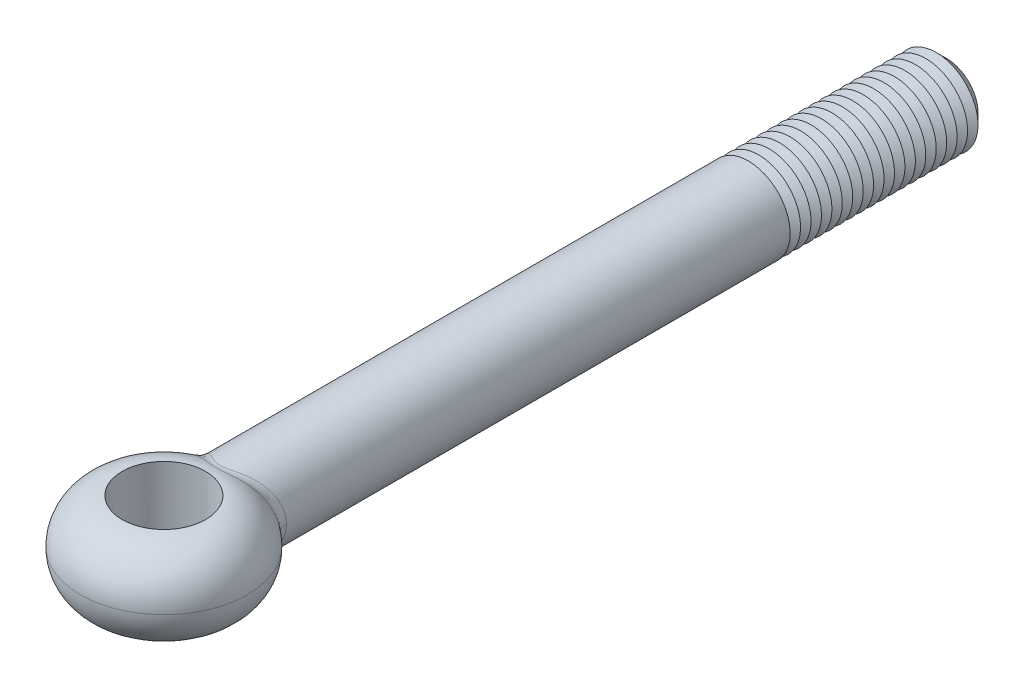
ISO-10303-21;
HEADER;
FILE_DESCRIPTION(('STEP AP214'),'2;1');
FILE_NAME('part.step','',(''),(''),'','','');
FILE_SCHEMA(('AUTOMOTIVE_DESIGN { 1 0 10303 214 1 1 1 1 }'));
ENDSEC;
DATA;
#1=APPLICATION_CONTEXT('core data for automotive mechanical design processes');
#2=APPLICATION_PROTOCOL_DEFINITION('international standard','automotive_design',2000,#1);
#3=PRODUCT_CONTEXT('',#1,'mechanical');
#4=PRODUCT('Part','Part','',(#3));
#5=PRODUCT_RELATED_PRODUCT_CATEGORY('part','',(#4));
#6=PRODUCT_DEFINITION_FORMATION('','',#4);
#7=PRODUCT_DEFINITION_CONTEXT('part definition',#1,'design');
#8=PRODUCT_DEFINITION('design','',#6,#7);
#9=PRODUCT_DEFINITION_SHAPE('','',#8);
#10=(LENGTH_UNIT() NAMED_UNIT(*) SI_UNIT(.MILLI.,.METRE.));
#11=(NAMED_UNIT(*) PLANE_ANGLE_UNIT() SI_UNIT($,.RADIAN.));
#12=(NAMED_UNIT(*) SI_UNIT($,.STERADIAN.) SOLID_ANGLE_UNIT());
#13=UNCERTAINTY_MEASURE_WITH_UNIT(LENGTH_MEASURE(1.E-05),#10,'distance_accuracy_value','');
#14=(GEOMETRIC_REPRESENTATION_CONTEXT(3) GLOBAL_UNCERTAINTY_ASSIGNED_CONTEXT((#13)) GLOBAL_UNIT_ASSIGNED_CONTEXT((#10,
#11,#12)) REPRESENTATION_CONTEXT('',''));
#15=CARTESIAN_POINT('',(0.,0.,0.));
#16=DIRECTION('',(0.,0.,1.));
#17=DIRECTION('',(1.,0.,0.));
#18=AXIS2_PLACEMENT_3D('',#15,#16,#17);
#19=CARTESIAN_POINT('',(0.,0.,-150.));
#20=DIRECTION('',(0.,0.,1.));
#21=DIRECTION('',(1.,0.,0.));
#22=AXIS2_PLACEMENT_3D('',#19,#20,#21);
#23=CYLINDRICAL_SURFACE('',#22,8.);
#24=CARTESIAN_POINT('',(0.,0.,-112.));
#25=DIRECTION('',(0.,0.,-1.));
#26=DIRECTION('',(-1.,0.,0.));
#27=AXIS2_PLACEMENT_3D('',#24,#25,#26);
#28=CIRCLE('',#27,8.);
#29=CARTESIAN_POINT('',(-8.,0.,-112.));
#30=VERTEX_POINT('',#29);
#31=EDGE_CURVE('E78',#30,#30,#28,.T.);
#32=ORIENTED_EDGE('',*,*,#31,.F.);
#33=EDGE_LOOP('',(#32));
#34=FACE_BOUND('',#33,.T.);
#35=CARTESIAN_POINT('',(7.65571552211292,-4.70868832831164,-12.4043242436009));
#36=CARTESIAN_POINT('',(6.72728970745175,-4.34389938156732,-13.262564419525));
#37=CARTESIAN_POINT('',(6.52180502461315,-4.63314787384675,-14.5297396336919));
#38=CARTESIAN_POINT('',(7.78528037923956,-4.53966232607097,-12.4565567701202));
#39=CARTESIAN_POINT('',(6.83379002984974,-4.17832451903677,-13.3197976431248));
#40=CARTESIAN_POINT('',(6.63998731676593,-4.46683351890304,-14.6083073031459));
#41=CARTESIAN_POINT('',(7.90812409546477,-4.36526473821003,-12.5059716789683));
#42=CARTESIAN_POINT('',(6.93368225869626,-4.0095233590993,-13.3734055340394));
#43=CARTESIAN_POINT('',(6.75228850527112,-4.29523375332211,-14.6825830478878));
#44=CARTESIAN_POINT('',(8.13948466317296,-4.00670892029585,-12.5988603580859));
#45=CARTESIAN_POINT('',(7.12062810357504,-3.66549770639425,-13.4736177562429));
#46=CARTESIAN_POINT('',(6.9641575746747,-3.94243016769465,-14.8221229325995));
#47=CARTESIAN_POINT('',(8.24799717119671,-3.82254775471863,-12.6423323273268));
#48=CARTESIAN_POINT('',(7.20758377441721,-3.49031776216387,-13.5201690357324));
#49=CARTESIAN_POINT('',(7.06372159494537,-3.76122345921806,-14.8873843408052));
#50=CARTESIAN_POINT('',(8.44978241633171,-3.44545520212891,-12.7230176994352));
#51=CARTESIAN_POINT('',(7.36833540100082,-3.13449696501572,-13.6061398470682));
#52=CARTESIAN_POINT('',(7.24911953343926,-3.39018051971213,-15.0084504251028));
#53=CARTESIAN_POINT('',(8.54304739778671,-3.25251941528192,-12.7602279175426));
#54=CARTESIAN_POINT('',(7.44203446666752,-2.95392242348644,-13.6455071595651));
#55=CARTESIAN_POINT('',(7.33494646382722,-3.20033995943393,-15.0642502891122));
#56=CARTESIAN_POINT('',(8.71342620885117,-2.85921824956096,-12.8280902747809));
#57=CARTESIAN_POINT('',(7.57598659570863,-2.58837905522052,-13.7170010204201));
#58=CARTESIAN_POINT('',(7.49190592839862,-2.81334843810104,-15.1659728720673));
#59=CARTESIAN_POINT('',(8.79054223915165,-2.65885388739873,-12.8587433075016));
#60=CARTESIAN_POINT('',(7.6361598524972,-2.40349985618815,-13.7490847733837));
#61=CARTESIAN_POINT('',(7.56304046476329,-2.6161984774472,-15.211896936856));
#62=CARTESIAN_POINT('',(8.92571181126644,-2.25853949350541,-12.9123976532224));
#63=CARTESIAN_POINT('',(7.74119890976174,-2.03625449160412,-13.8050560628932));
#64=CARTESIAN_POINT('',(7.68782564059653,-2.22230623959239,-15.292254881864));
#65=CARTESIAN_POINT('',(8.98429621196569,-2.05878122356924,-12.9356123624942));
#66=CARTESIAN_POINT('',(7.78643285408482,-1.85408075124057,-13.8291409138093));
#67=CARTESIAN_POINT('',(7.74196276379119,-2.02575264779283,-15.3270093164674));
#68=CARTESIAN_POINT('',(9.08514258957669,-1.65481550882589,-12.9755337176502));
#69=CARTESIAN_POINT('',(7.86407915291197,-1.48723318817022,-13.8704667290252));
#70=CARTESIAN_POINT('',(7.83520435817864,-1.62826766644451,-15.3867612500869));
#71=CARTESIAN_POINT('',(9.12739921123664,-1.45060662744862,-12.9922382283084));
#72=CARTESIAN_POINT('',(7.89643738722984,-1.3026689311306,-13.887678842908));
#73=CARTESIAN_POINT('',(7.87430389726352,-1.42733486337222,-15.4117555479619));
#74=CARTESIAN_POINT('',(9.19512372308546,-1.03944863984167,-13.0189938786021));
#75=CARTESIAN_POINT('',(7.94822057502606,-0.932097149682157,-13.9152169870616));
#76=CARTESIAN_POINT('',(7.93698863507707,-1.02277299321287,-15.4517833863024));
#77=CARTESIAN_POINT('',(9.22061021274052,-0.832502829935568,-13.0290523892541));
#78=CARTESIAN_POINT('',(7.96762552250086,-0.746210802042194,-13.9255323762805));
#79=CARTESIAN_POINT('',(7.96059102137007,-0.819147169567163,-15.4668279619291));
#80=CARTESIAN_POINT('',(9.25463049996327,-0.417038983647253,-13.042476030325));
#81=CARTESIAN_POINT('',(7.99352641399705,-0.373487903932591,-13.9392998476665));
#82=CARTESIAN_POINT('',(7.99209967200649,-0.41034851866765,-15.4869048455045));
#83=CARTESIAN_POINT('',(9.26315800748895,-0.208520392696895,-13.0458386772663));
#84=CARTESIAN_POINT('',(8.00000000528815,-0.186776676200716,-13.9427400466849));
#85=CARTESIAN_POINT('',(8.00000011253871,-0.205175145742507,-15.4919334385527));
#86=CARTESIAN_POINT('',(9.26315778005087,0.212096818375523,-13.0458386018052));
#87=CARTESIAN_POINT('',(7.99999999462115,0.189980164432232,-13.9427400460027));
#88=CARTESIAN_POINT('',(7.99999988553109,0.208694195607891,-15.4919333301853));
#89=CARTESIAN_POINT('',(9.25433501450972,0.424195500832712,-13.0423595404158));
#90=CARTESIAN_POINT('',(7.99330246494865,0.379894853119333,-13.9391808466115));
#91=CARTESIAN_POINT('',(7.99182588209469,0.417390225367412,-15.4867306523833));
#92=CARTESIAN_POINT('',(9.21912567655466,0.846898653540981,-13.0284665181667));
#93=CARTESIAN_POINT('',(7.96649487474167,0.759132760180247,-13.9249313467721));
#94=CARTESIAN_POINT('',(7.95921621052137,0.833312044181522,-15.4659516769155));
#95=CARTESIAN_POINT('',(9.19273228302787,1.05750251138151,-13.0180498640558));
#96=CARTESIAN_POINT('',(7.94639841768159,0.948323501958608,-13.9142482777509));
#97=CARTESIAN_POINT('',(7.93477422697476,1.04053723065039,-15.4503713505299));
#98=CARTESIAN_POINT('',(9.12263828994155,1.47558922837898,-12.9903565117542));
#99=CARTESIAN_POINT('',(7.89279270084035,1.32522192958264,-13.8857402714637));
#100=CARTESIAN_POINT('',(7.86989829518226,1.45191667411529,-15.4089401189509));
#101=CARTESIAN_POINT('',(9.07893758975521,1.68307206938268,-12.9730797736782));
#102=CARTESIAN_POINT('',(7.85932019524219,1.51280379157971,-13.867934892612));
#103=CARTESIAN_POINT('',(7.82946425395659,1.65607091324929,-15.3830891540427));
#104=CARTESIAN_POINT('',(8.97463738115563,2.09350607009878,-12.9317860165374));
#105=CARTESIAN_POINT('',(7.77898033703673,1.88569930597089,-13.8251732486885));
#106=CARTESIAN_POINT('',(7.73303581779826,2.05992041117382,-15.3212813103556));
#107=CARTESIAN_POINT('',(8.91403167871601,2.29645553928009,-12.9077665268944));
#108=CARTESIAN_POINT('',(7.73216134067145,2.07089682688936,-13.8002427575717));
#109=CARTESIAN_POINT('',(7.67703571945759,2.25961400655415,-15.2853207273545));
#110=CARTESIAN_POINT('',(8.7766400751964,2.69595109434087,-12.8532186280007));
#111=CARTESIAN_POINT('',(7.62531367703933,2.43769964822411,-13.7433022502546));
#112=CARTESIAN_POINT('',(7.55021504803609,2.65270054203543,-15.2036203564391));
#113=CARTESIAN_POINT('',(8.69988632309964,2.8925090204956,-12.8227031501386));
#114=CARTESIAN_POINT('',(7.56537860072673,2.61920953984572,-13.7113422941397));
#115=CARTESIAN_POINT('',(7.47942392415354,2.84610513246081,-15.1578999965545));
#116=CARTESIAN_POINT('',(8.53082157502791,3.27836797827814,-12.7553515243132));
#117=CARTESIAN_POINT('',(7.43237570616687,2.97809298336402,-13.6403484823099));
#118=CARTESIAN_POINT('',(7.32369350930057,3.2257738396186,-15.0569382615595));
#119=CARTESIAN_POINT('',(8.43850992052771,3.46766870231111,-12.7185151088));
#120=CARTESIAN_POINT('',(7.35938539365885,3.15538265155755,-13.6013561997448));
#121=CARTESIAN_POINT('',(7.23875361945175,3.41203765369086,-15.0016964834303));
#122=CARTESIAN_POINT('',(8.23912752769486,3.83785366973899,-12.638780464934));
#123=CARTESIAN_POINT('',(7.200476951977,3.50486381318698,-13.5163651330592));
#124=CARTESIAN_POINT('',(7.05558212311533,3.77628382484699,-14.8820525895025));
#125=CARTESIAN_POINT('',(8.13205660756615,4.01873780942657,-12.5958821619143));
#126=CARTESIAN_POINT('',(7.1146443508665,3.676990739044,-13.470412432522));
#127=CARTESIAN_POINT('',(6.95735035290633,3.9542660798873,-14.8176503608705));
#128=CARTESIAN_POINT('',(7.90405644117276,4.37102436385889,-12.5043342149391));
#129=CARTESIAN_POINT('',(6.93036449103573,4.01512460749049,-13.3716246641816));
#130=CARTESIAN_POINT('',(6.74856869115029,4.30090097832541,-14.6801217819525));
#131=CARTESIAN_POINT('',(7.7831309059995,4.54242929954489,-12.455686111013));
#132=CARTESIAN_POINT('',(6.83201017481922,4.18108915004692,-13.3188399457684));
#133=CARTESIAN_POINT('',(6.6380220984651,4.46955610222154,-14.606997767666));
#134=CARTESIAN_POINT('',(7.52417170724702,4.88033437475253,-12.3512981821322));
#135=CARTESIAN_POINT('',(6.61966655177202,4.51122245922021,-13.2047290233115));
#136=CARTESIAN_POINT('',(6.40182236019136,4.8020402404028,-14.4499782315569));
#137=CARTESIAN_POINT('',(7.38571067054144,5.04649564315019,-12.2953796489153));
#138=CARTESIAN_POINT('',(6.50535488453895,4.67515888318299,-13.1432256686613));
#139=CARTESIAN_POINT('',(6.27579579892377,4.96553581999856,-14.3658104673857));
#140=CARTESIAN_POINT('',(7.09600101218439,5.36700983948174,-12.1781888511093));
#141=CARTESIAN_POINT('',(6.26419128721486,4.99444350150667,-13.0133186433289));
#142=CARTESIAN_POINT('',(6.01283258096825,5.28090807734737,-14.1892780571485));
#143=CARTESIAN_POINT('',(6.9447557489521,5.52136584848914,-12.1169179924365));
#144=CARTESIAN_POINT('',(6.13743653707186,5.14979233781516,-12.9449680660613));
#145=CARTESIAN_POINT('',(5.87589879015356,5.43278778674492,-14.096915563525));
#146=CARTESIAN_POINT('',(6.63032399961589,5.81777921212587,-11.9894408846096));
#147=CARTESIAN_POINT('',(5.87186134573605,5.45104206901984,-12.8016646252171));
#148=CARTESIAN_POINT('',(5.59214975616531,5.72444585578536,-13.9045942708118));
#149=CARTESIAN_POINT('',(6.46713092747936,5.95982968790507,-11.9232319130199));
#150=CARTESIAN_POINT('',(5.73311888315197,5.5969588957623,-12.7267542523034));
#151=CARTESIAN_POINT('',(5.44532906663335,5.864217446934,-13.8046312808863));
#152=CARTESIAN_POINT('',(6.12980638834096,6.23103471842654,-11.7864658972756));
#153=CARTESIAN_POINT('',(5.44428764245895,5.8782916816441,-12.5708631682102));
#154=CARTESIAN_POINT('',(5.14301550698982,6.13107159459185,-13.597971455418));
#155=CARTESIAN_POINT('',(5.95567749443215,6.36019228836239,-11.7159098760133));
#156=CARTESIAN_POINT('',(5.2942739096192,6.01375077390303,-12.4899226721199));
#157=CARTESIAN_POINT('',(4.98752467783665,6.25815711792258,-13.4912762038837));
#158=CARTESIAN_POINT('',(5.58077734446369,6.61655266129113,-11.5644429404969));
#159=CARTESIAN_POINT('',(4.96933836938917,6.28519206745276,-12.3149807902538));
#160=CARTESIAN_POINT('',(4.65426780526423,6.51040475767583,-13.2620454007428));
#161=CARTESIAN_POINT('',(5.37902613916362,6.74249537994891,-11.4831752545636));
#162=CARTESIAN_POINT('',(4.79337910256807,6.42023065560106,-12.2204520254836));
#163=CARTESIAN_POINT('',(4.47576535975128,6.63432700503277,-13.1389537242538));
#164=CARTESIAN_POINT('',(4.96405939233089,6.97841153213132,-11.3172707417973));
#165=CARTESIAN_POINT('',(4.42939848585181,6.67584287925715,-12.0261057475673));
#166=CARTESIAN_POINT('',(4.11078186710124,6.86645840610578,-12.8874694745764));
#167=CARTESIAN_POINT('',(4.75084610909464,7.08838809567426,-11.2326345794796));
#168=CARTESIAN_POINT('',(4.24142531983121,6.79651407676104,-11.9263073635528));
#169=CARTESIAN_POINT('',(3.9243023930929,6.97467063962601,-12.7590779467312));
#170=CARTESIAN_POINT('',(4.31305945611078,7.29234286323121,-11.0613975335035));
#171=CARTESIAN_POINT('',(3.85380278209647,7.02260612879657,-11.7231213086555));
#172=CARTESIAN_POINT('',(3.54408562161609,7.17535340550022,-12.4991467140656));
#173=CARTESIAN_POINT('',(4.08848183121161,7.3863150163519,-10.9747959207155));
#174=CARTESIAN_POINT('',(3.654162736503,7.12813046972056,-11.6197260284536));
#175=CARTESIAN_POINT('',(3.35034561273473,7.26781798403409,-12.3676058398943));
#176=CARTESIAN_POINT('',(3.62764081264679,7.55817215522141,-10.8018106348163));
#177=CARTESIAN_POINT('',(3.24335533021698,7.32304867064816,-11.4120811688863));
#178=CARTESIAN_POINT('',(2.95605890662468,7.43691805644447,-12.1047402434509));
#179=CARTESIAN_POINT('',(3.3913812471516,7.63606236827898,-10.7154268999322));
#180=CARTESIAN_POINT('',(3.03217009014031,7.41256504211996,-11.3077963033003));
#181=CARTESIAN_POINT('',(2.7555144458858,7.51355869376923,-11.9734154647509));
#182=CARTESIAN_POINT('',(3.01086953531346,7.74546693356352,-10.5830417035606));
#183=CARTESIAN_POINT('',(2.69133046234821,7.53961841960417,-11.1471485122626));
#184=CARTESIAN_POINT('',(2.43558876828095,7.62120810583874,-11.7721230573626));
#185=CARTESIAN_POINT('',(2.87105562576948,7.78246196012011,-10.5357450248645));
#186=CARTESIAN_POINT('',(2.5661213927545,7.58284459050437,-11.0896499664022));
#187=CARTESIAN_POINT('',(2.31864844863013,7.65760962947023,-11.700201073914));
#188=CARTESIAN_POINT('',(2.58677327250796,7.85120381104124,-10.4433981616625));
#189=CARTESIAN_POINT('',(2.31149724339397,7.66361225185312,-10.9771506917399));
#190=CARTESIAN_POINT('',(2.08222311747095,7.725248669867,-11.5597728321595));
#191=CARTESIAN_POINT('',(2.4423056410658,7.88295154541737,-10.3983475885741));
#192=CARTESIAN_POINT('',(2.18206471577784,7.70117677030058,-10.9221313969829));
#193=CARTESIAN_POINT('',(1.96273855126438,7.75648708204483,-11.4912659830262));
#194=CARTESIAN_POINT('',(2.14829229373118,7.94107768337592,-10.3118779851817));
#195=CARTESIAN_POINT('',(1.91873101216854,7.77031102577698,-10.8163504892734));
#196=CARTESIAN_POINT('',(1.72099254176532,7.81368071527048,-11.3597855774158));
#197=CARTESIAN_POINT('',(1.99874950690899,7.96745912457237,-10.270456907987));
#198=CARTESIAN_POINT('',(1.78480669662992,7.80190571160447,-10.7655636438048));
#199=CARTESIAN_POINT('',(1.59873271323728,7.83963892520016,-11.2968089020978));
#200=CARTESIAN_POINT('',(1.69405593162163,8.0146723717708,-10.193104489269));
#201=CARTESIAN_POINT('',(1.51212291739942,7.85870857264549,-10.6706050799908));
#202=CARTESIAN_POINT('',(1.35106400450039,7.88609474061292,-11.1792198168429));
#203=CARTESIAN_POINT('',(1.53890651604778,8.03550552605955,-10.1571718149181));
#204=CARTESIAN_POINT('',(1.3733287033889,7.88393882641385,-10.6264046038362));
#205=CARTESIAN_POINT('',(1.22565589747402,7.90659367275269,-11.1246053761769));
#206=CARTESIAN_POINT('',(1.26101534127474,8.06699003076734,-10.1009556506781));
#207=CARTESIAN_POINT('',(1.12491664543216,7.92221302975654,-10.5571921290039));
#208=CARTESIAN_POINT('',(1.00219933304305,7.93757307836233,-11.0391767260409));
#209=CARTESIAN_POINT('',(1.13947852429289,8.07888519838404,-10.0789878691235));
#210=CARTESIAN_POINT('',(1.01633877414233,7.93673299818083,-10.5301169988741));
#211=CARTESIAN_POINT('',(0.90484411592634,7.94927741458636,-11.0057989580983));
#212=CARTESIAN_POINT('',(0.893460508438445,8.09911575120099,-10.0408546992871));
#213=CARTESIAN_POINT('',(0.796699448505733,7.96148016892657,-10.4831027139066));
#214=CARTESIAN_POINT('',(0.708414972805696,7.96918341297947,-10.9478665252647));
#215=CARTESIAN_POINT('',(0.768980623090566,8.10745269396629,-10.0246867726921));
#216=CARTESIAN_POINT('',(0.685612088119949,7.97171600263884,-10.4631484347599));
#217=CARTESIAN_POINT('',(0.609341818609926,7.97738660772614,-10.9233080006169));
#218=CARTESIAN_POINT('',(0.518300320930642,8.12036544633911,-9.9993428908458));
#219=CARTESIAN_POINT('',(0.46202700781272,7.98758747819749,-10.4318683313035));
#220=CARTESIAN_POINT('',(0.410276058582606,7.99009220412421,-10.8848145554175));
#221=CARTESIAN_POINT('',(0.39210936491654,8.12495695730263,-9.99013775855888));
#222=CARTESIAN_POINT('',(0.349505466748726,7.99324704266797,-10.4204974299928));
#223=CARTESIAN_POINT('',(0.310289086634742,7.99461005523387,-10.8708353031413));
#224=CARTESIAN_POINT('',(0.138717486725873,8.13030926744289,-9.97938544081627));
#225=CARTESIAN_POINT('',(0.123640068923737,7.99984388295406,-10.4072188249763));
#226=CARTESIAN_POINT('',(0.109710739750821,7.99987649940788,-10.8545066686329));
#227=CARTESIAN_POINT('',(0.0115166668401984,8.13107044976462,-9.97783748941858));
#228=CARTESIAN_POINT('',(0.0102607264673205,8.00078372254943,-10.4053059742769));
#229=CARTESIAN_POINT('',(0.00911942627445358,8.00062546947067,-10.8521561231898));
#230=CARTESIAN_POINT('',(-0.242597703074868,8.12873778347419,-9.98254200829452));
#231=CARTESIAN_POINT('',(-0.216224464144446,7.99790731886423,-10.4111163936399));
#232=CARTESIAN_POINT('',(-0.191921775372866,7.99833022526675,-10.8593002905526));
#233=CARTESIAN_POINT('',(-0.369510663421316,8.1256389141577,-9.9888046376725));
#234=CARTESIAN_POINT('',(-0.329366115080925,7.99408395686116,-10.4188540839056));
#235=CARTESIAN_POINT('',(-0.292371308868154,7.9952810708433,-10.8688104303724));
#236=CARTESIAN_POINT('',(-0.62154313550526,8.1156691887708,-10.0085955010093));
#237=CARTESIAN_POINT('',(-0.55409126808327,7.98181341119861,-10.4432875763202));
#238=CARTESIAN_POINT('',(-0.492201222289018,7.98547128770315,-10.8988675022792));
#239=CARTESIAN_POINT('',(-0.746662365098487,8.1087977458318,-10.0221248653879));
#240=CARTESIAN_POINT('',(-0.665708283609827,7.97336172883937,-10.4599921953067));
#241=CARTESIAN_POINT('',(-0.591581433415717,7.97871008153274,-10.9194161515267));
#242=CARTESIAN_POINT('',(-0.994807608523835,8.09140385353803,-10.0554975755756));
#243=CARTESIAN_POINT('',(-0.887155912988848,7.95203968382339,-10.5011571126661));
#244=CARTESIAN_POINT('',(-0.789239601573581,7.9615952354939,-10.9701112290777));
#245=CARTESIAN_POINT('',(-1.11781918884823,8.08086243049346,-10.0753736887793));
#246=CARTESIAN_POINT('',(-0.997003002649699,7.93914030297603,-10.5256688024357));
#247=CARTESIAN_POINT('',(-0.887509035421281,7.95122292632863,-11.0003074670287));
#248=CARTESIAN_POINT('',(-1.36062252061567,8.05632046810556,-10.1202009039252));
#249=CARTESIAN_POINT('',(-1.21391840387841,7.90923091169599,-10.5808872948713));
#250=CARTESIAN_POINT('',(-1.08217747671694,7.92707468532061,-11.0684211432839));
#251=CARTESIAN_POINT('',(-1.48041386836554,8.04231949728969,-10.1451526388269));
#252=CARTESIAN_POINT('',(-1.32101027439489,7.89221272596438,-10.6116076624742));
#253=CARTESIAN_POINT('',(-1.17857624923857,7.91329832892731,-11.1063395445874));
#254=CARTESIAN_POINT('',(-1.83571751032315,7.99525450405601,-10.2260259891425));
#255=CARTESIAN_POINT('',(-1.63896719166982,7.83523151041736,-10.7111025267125));
#256=CARTESIAN_POINT('',(-1.46567741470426,7.86698838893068,-11.2292596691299));
#257=CARTESIAN_POINT('',(-2.06624268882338,7.95719484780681,-10.2878252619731));
#258=CARTESIAN_POINT('',(-1.84542427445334,7.78943990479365,-10.786994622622));
#259=CARTESIAN_POINT('',(-1.65355562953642,7.82953931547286,-11.323212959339));
#260=CARTESIAN_POINT('',(-2.51536964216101,7.86860887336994,-10.4197592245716));
#261=CARTESIAN_POINT('',(-2.24768618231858,7.68406371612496,-10.9484016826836));
#262=CARTESIAN_POINT('',(-2.02278766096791,7.74237450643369,-11.523822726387));
#263=CARTESIAN_POINT('',(-2.7339584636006,7.81806932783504,-10.4899027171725));
#264=CARTESIAN_POINT('',(-2.44357001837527,7.62438808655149,-11.0340073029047));
#265=CARTESIAN_POINT('',(-2.20413431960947,7.69264575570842,-11.6304926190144));
#266=CARTESIAN_POINT('',(-3.16114079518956,7.7047711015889,-10.6341356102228));
#267=CARTESIAN_POINT('',(-2.82605678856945,7.49212963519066,-11.209290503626));
#268=CARTESIAN_POINT('',(-2.56144019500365,7.5811651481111,-11.8498152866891));
#269=CARTESIAN_POINT('',(-3.36972002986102,7.64199557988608,-10.7082303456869));
#270=CARTESIAN_POINT('',(-3.01269895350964,7.41945044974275,-11.2990288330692));
#271=CARTESIAN_POINT('',(-2.7373915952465,7.51939672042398,-11.9624761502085));
#272=CARTESIAN_POINT('',(-3.77761069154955,7.50439428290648,-10.8574864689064));
#273=CARTESIAN_POINT('',(-3.37700705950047,7.26193164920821,-11.478951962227));
#274=CARTESIAN_POINT('',(-3.08400676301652,7.38400293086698,-12.1893535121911));
#275=CARTESIAN_POINT('',(-3.97692585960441,7.42957342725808,-10.9326474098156));
#276=CARTESIAN_POINT('',(-3.55470238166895,7.17701899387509,-11.5691696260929));
#277=CARTESIAN_POINT('',(-3.25467265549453,7.31038240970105,-12.3035693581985));
#278=CARTESIAN_POINT('',(-4.39445558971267,7.2564786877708,-11.0928561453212));
#279=CARTESIAN_POINT('',(-3.92598763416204,6.98268785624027,-11.7605523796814));
#280=CARTESIAN_POINT('',(-3.61448048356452,7.14006459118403,-12.5469124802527));
#281=CARTESIAN_POINT('',(-4.61137762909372,7.15638577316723,-11.1778053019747));
#282=CARTESIAN_POINT('',(-4.11816178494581,6.87146818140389,-11.8614202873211));
#283=CARTESIAN_POINT('',(-3.80283870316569,7.04157744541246,-12.6758739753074));
#284=CARTESIAN_POINT('',(-5.03418640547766,6.94053636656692,-11.3451201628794));
#285=CARTESIAN_POINT('',(-4.49106527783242,6.6346292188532,-12.0588431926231));
#286=CARTESIAN_POINT('',(-4.17223411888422,6.82919086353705,-12.9297006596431));
#287=CARTESIAN_POINT('',(-5.24007150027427,6.82477755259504,-11.4274854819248));
#288=CARTESIAN_POINT('',(-4.67176487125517,6.50890803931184,-12.1553921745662));
#289=CARTESIAN_POINT('',(-4.35327022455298,6.71528914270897,-13.0545652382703));
#290=CARTESIAN_POINT('',(-5.64018983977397,6.57785054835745,-11.5883608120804));
#291=CARTESIAN_POINT('',(-5.02102168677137,6.24402103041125,-12.3427259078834));
#292=CARTESIAN_POINT('',(-4.70691034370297,6.47232353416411,-13.2982594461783));
#293=CARTESIAN_POINT('',(-5.83443208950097,6.44669450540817,-11.6668737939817));
#294=CARTESIAN_POINT('',(-5.18953304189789,6.10478124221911,-12.4334896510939));
#295=CARTESIAN_POINT('',(-4.87952085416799,6.34327159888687,-13.417093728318));
#296=CARTESIAN_POINT('',(-6.21062987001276,6.16921890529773,-11.8191988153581));
#297=CARTESIAN_POINT('',(-5.5138573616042,5.81373255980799,-12.6083829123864));
#298=CARTESIAN_POINT('',(-5.2152572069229,6.07024747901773,-13.6474577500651));
#299=CARTESIAN_POINT('',(-6.39258596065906,6.02290003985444,-11.8930110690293));
#300=CARTESIAN_POINT('',(-5.66959067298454,5.66186103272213,-12.6924706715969));
#301=CARTESIAN_POINT('',(-5.37838348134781,5.9262759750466,-13.7589878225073));
#302=CARTESIAN_POINT('',(-6.76082954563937,5.70011889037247,-12.0423592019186));
#303=CARTESIAN_POINT('',(-5.98269684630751,5.33064591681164,-12.8614822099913));
#304=CARTESIAN_POINT('',(-5.7096924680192,5.60867313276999,-13.9844670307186));
#305=CARTESIAN_POINT('',(-6.94571467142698,5.52210505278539,-12.1173228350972));
#306=CARTESIAN_POINT('',(-6.1384387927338,5.15012845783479,-12.9455201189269));
#307=CARTESIAN_POINT('',(-5.87673584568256,5.4335151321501,-14.0975328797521));
#308=CARTESIAN_POINT('',(-7.2978095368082,5.14921557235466,-12.2598587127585));
#309=CARTESIAN_POINT('',(-6.432710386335,4.77666871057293,-13.1041242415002));
#310=CARTESIAN_POINT('',(-6.19585367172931,5.06660783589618,-14.3123318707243));
#311=CARTESIAN_POINT('',(-7.46501728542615,4.95433803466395,-12.3274301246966));
#312=CARTESIAN_POINT('',(-6.5710843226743,4.58371724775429,-13.1786053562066));
#313=CARTESIAN_POINT('',(-6.34792643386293,4.87485667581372,-14.4140637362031));
#314=CARTESIAN_POINT('',(-7.78013527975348,4.54891459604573,-12.4544969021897));
#315=CARTESIAN_POINT('',(-6.82982333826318,4.18696009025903,-13.3176780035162));
#316=CARTESIAN_POINT('',(-6.63524155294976,4.47593735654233,-14.6052189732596));
#317=CARTESIAN_POINT('',(-7.92803665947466,4.33836156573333,-12.5139885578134));
#318=CARTESIAN_POINT('',(-6.95001540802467,3.98318853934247,-13.3821752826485));
#319=CARTESIAN_POINT('',(-6.77047617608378,4.26876218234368,-14.6946366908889));
#320=CARTESIAN_POINT('',(-8.20275756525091,3.90330017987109,-12.6242339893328));
#321=CARTESIAN_POINT('',(-7.17161528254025,3.56660483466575,-13.5009298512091));
#322=CARTESIAN_POINT('',(-7.02216465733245,3.84068039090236,-14.8602256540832));
#323=CARTESIAN_POINT('',(-8.32958109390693,3.67879448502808,-12.6749894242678));
#324=CARTESIAN_POINT('',(-7.27286247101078,3.35388041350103,-13.5551002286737));
#325=CARTESIAN_POINT('',(-7.13862208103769,3.61977639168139,-14.9363994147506));
#326=CARTESIAN_POINT('',(-8.54733325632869,3.24423340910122,-12.7619453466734));
#327=CARTESIAN_POINT('',(-7.44552191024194,2.94603669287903,-13.6473748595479));
#328=CARTESIAN_POINT('',(-7.33887694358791,3.19218688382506,-15.0668289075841));
#329=CARTESIAN_POINT('',(-8.64071095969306,3.03547652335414,-12.7991477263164));
#330=CARTESIAN_POINT('',(-7.51894899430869,2.75170647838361,-13.6865686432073));
#331=CARTESIAN_POINT('',(-7.42488873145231,2.98677903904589,-15.1225967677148));
#332=CARTESIAN_POINT('',(-8.80876711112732,2.61008550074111,-12.865990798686));
#333=CARTESIAN_POINT('',(-7.65044657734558,2.35845430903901,-13.7567044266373));
#334=CARTESIAN_POINT('',(-7.57984616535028,2.56821247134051,-15.2227563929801));
#335=CARTESIAN_POINT('',(-8.88344772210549,2.39345227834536,-12.8956323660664));
#336=CARTESIAN_POINT('',(-7.70842508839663,2.15964982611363,-13.7875971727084));
#337=CARTESIAN_POINT('',(-7.64879378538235,2.35505464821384,-15.2671494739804));
#338=CARTESIAN_POINT('',(-9.01314517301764,1.9545388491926,-12.9470441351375));
#339=CARTESIAN_POINT('',(-7.80874691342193,1.75904530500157,-13.8410223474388));
#340=CARTESIAN_POINT('',(-7.76862124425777,1.9231826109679,-15.3441237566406));
#341=CARTESIAN_POINT('',(-9.06820874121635,1.7322734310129,-12.9688330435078));
#342=CARTESIAN_POINT('',(-7.85105172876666,1.55739026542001,-13.8635342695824));
#343=CARTESIAN_POINT('',(-7.81954401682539,1.70448294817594,-15.3767330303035));
#344=CARTESIAN_POINT('',(-9.15827613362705,1.28352045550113,-13.0044431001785));
#345=CARTESIAN_POINT('',(-7.92010315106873,1.151767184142,-13.9002668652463));
#346=CARTESIAN_POINT('',(-7.90287516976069,1.26292921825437,-15.4300168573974));
#347=CARTESIAN_POINT('',(-9.19329180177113,1.05703547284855,-13.0182689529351));
#348=CARTESIAN_POINT('',(-7.94680432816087,0.94795427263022,-13.9144633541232));
#349=CARTESIAN_POINT('',(-7.93529448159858,1.04007768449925,-15.4506984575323));
#350=CARTESIAN_POINT('',(-9.23310033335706,0.691727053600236,-13.0339812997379));
#351=CARTESIAN_POINT('',(-7.97713736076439,0.619900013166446,-13.9305885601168));
#352=CARTESIAN_POINT('',(-7.97215833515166,0.680629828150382,-15.4742000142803));
#353=CARTESIAN_POINT('',(-9.24436828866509,0.553629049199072,-13.0384268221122));
#354=CARTESIAN_POINT('',(-7.98571004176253,0.496050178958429,-13.9351451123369));
#355=CARTESIAN_POINT('',(-7.9825950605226,0.544747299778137,-15.4808487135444));
#356=CARTESIAN_POINT('',(-9.25939658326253,0.277025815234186,-13.0443552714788));
#357=CARTESIAN_POINT('',(-7.99714237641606,0.248119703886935,-13.9412213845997));
#358=CARTESIAN_POINT('',(-7.99651547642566,0.272581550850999,-15.4897150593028));
#359=CARTESIAN_POINT('',(-9.26315875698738,0.138520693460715,-13.0458389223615));
#360=CARTESIAN_POINT('',(-7.99999999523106,0.124076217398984,-13.9427400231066));
#361=CARTESIAN_POINT('',(-8.00000086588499,0.136298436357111,-15.4919337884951));
#362=CARTESIAN_POINT('',(-9.26315657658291,-0.211761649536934,-13.0458382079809));
#363=CARTESIAN_POINT('',(-8.00000000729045,-0.189679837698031,-13.9427400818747));
#364=CARTESIAN_POINT('',(-7.99999867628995,-0.208364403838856,-15.4919327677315));
#365=CARTESIAN_POINT('',(-9.25436090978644,-0.423559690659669,-13.0423697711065));
#366=CARTESIAN_POINT('',(-7.99332234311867,-0.379325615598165,-13.9391914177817));
#367=CARTESIAN_POINT('',(-7.99184985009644,-0.41676461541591,-15.486745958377));
#368=CARTESIAN_POINT('',(-9.2192545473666,-0.845675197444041,-13.0285173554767));
#369=CARTESIAN_POINT('',(-7.96659277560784,-0.758034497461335,-13.9249833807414));
#370=CARTESIAN_POINT('',(-7.95933558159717,-0.832108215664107,-15.4660277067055));
#371=CARTESIAN_POINT('',(-9.19293494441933,-1.05599185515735,-13.0181298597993));
#372=CARTESIAN_POINT('',(-7.94655277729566,-0.946965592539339,-13.9143303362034));
#373=CARTESIAN_POINT('',(-7.93496189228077,-1.03905080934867,-15.4504910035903));
#374=CARTESIAN_POINT('',(-9.12293145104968,-1.47414078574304,-12.9904724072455));
#375=CARTESIAN_POINT('',(-7.89301742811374,-1.32391258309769,-13.8858598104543));
#376=CARTESIAN_POINT('',(-7.87016954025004,-1.45049146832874,-15.4091135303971));
#377=CARTESIAN_POINT('',(-9.0791962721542,-1.68196383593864,-12.9731821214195));
#378=CARTESIAN_POINT('',(-7.85951913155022,-1.51179861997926,-13.8680407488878));
#379=CARTESIAN_POINT('',(-7.82970348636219,-1.65498045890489,-15.38324232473));
#380=CARTESIAN_POINT('',(-8.97478996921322,-2.09299557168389,-12.9318464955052));
#381=CARTESIAN_POINT('',(-7.77909835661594,-1.88523285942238,-13.8252360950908));
#382=CARTESIAN_POINT('',(-7.73317681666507,-2.05941810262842,-15.3213718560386));
#383=CARTESIAN_POINT('',(-8.91411827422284,-2.29620410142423,-12.9078009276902));
#384=CARTESIAN_POINT('',(-7.73222890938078,-2.07066511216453,-13.8002787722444));
#385=CARTESIAN_POINT('',(-7.67711567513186,-2.25936660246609,-15.2853722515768));
#386=CARTESIAN_POINT('',(-8.7765466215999,-2.69622247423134,-12.8531815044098));
#387=CARTESIAN_POINT('',(-7.62524114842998,-2.43794839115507,-13.7432635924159));
#388=CARTESIAN_POINT('',(-7.55012876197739,-2.65296756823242,-15.203564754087));
#389=CARTESIAN_POINT('',(-8.69967722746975,-2.89304357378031,-12.8226199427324));
#390=CARTESIAN_POINT('',(-7.56521539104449,-2.61970332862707,-13.7112552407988));
#391=CARTESIAN_POINT('',(-7.47923098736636,-2.84663111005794,-15.1577753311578));
#392=CARTESIAN_POINT('',(-8.53033202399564,-3.27942770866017,-12.7551564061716));
#393=CARTESIAN_POINT('',(-7.43198999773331,-2.97908029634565,-13.6401425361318));
#394=CARTESIAN_POINT('',(-7.32324290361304,-3.22681656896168,-15.056645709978));
#395=CARTESIAN_POINT('',(-8.43785406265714,-3.46898973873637,-12.7182535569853));
#396=CARTESIAN_POINT('',(-7.35886693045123,-3.15661777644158,-13.6010792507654));
#397=CARTESIAN_POINT('',(-7.23815063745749,-3.4133374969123,-15.0013041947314));
#398=CARTESIAN_POINT('',(-8.23838126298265,-3.83913533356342,-12.6384812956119));
#399=CARTESIAN_POINT('',(-7.19987817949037,-3.50608561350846,-13.5160445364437));
#400=CARTESIAN_POINT('',(-7.05489698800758,-3.7775449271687,-14.881603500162));
#401=CARTESIAN_POINT('',(-8.13142827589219,-4.01974280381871,-12.5956290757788));
#402=CARTESIAN_POINT('',(-7.11413550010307,-3.67796425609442,-13.4701394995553));
#403=CARTESIAN_POINT('',(-6.95677329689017,-3.95525495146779,-14.8172703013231));
#404=CARTESIAN_POINT('',(-7.90371313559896,-4.37152047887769,-12.5041971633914));
#405=CARTESIAN_POINT('',(-6.93008703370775,-4.01559388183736,-13.3714760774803));
#406=CARTESIAN_POINT('',(-6.74825601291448,-4.3013891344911,-14.6799157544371));
#407=CARTESIAN_POINT('',(-7.78295514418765,-4.54269350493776,-12.4556191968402));
#408=CARTESIAN_POINT('',(-6.83187409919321,-4.18130307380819,-13.3187679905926));
#409=CARTESIAN_POINT('',(-6.63786611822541,-4.46981606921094,-14.6068970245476));
#410=CARTESIAN_POINT('',(-7.65571552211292,-4.70868832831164,-12.4043242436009));
#411=CARTESIAN_POINT('',(-6.72728970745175,-4.34389938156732,-13.262564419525));
#412=CARTESIAN_POINT('',(-6.52180502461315,-4.63314787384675,-14.5297396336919));
#413=(BOUNDED_SURFACE() B_SPLINE_SURFACE(3,2,((#35,#36,#37),(#38,#39,#40),(#41,#42,#43),(#44,
#45,#46),(#47,#48,#49),(#50,#51,#52),(#53,#54,#55),(#56,#57,#58),(#59,#60,#61),(#62,#63,#64),
(#65,#66,#67),(#68,#69,#70),(#71,#72,#73),(#74,#75,#76),(#77,#78,#79),(#80,#81,#82),(#83,#84,
#85),(#86,#87,#88),(#89,#90,#91),(#92,#93,#94),(#95,#96,#97),(#98,#99,#100),(#101,#102,#103),
(#104,#105,#106),(#107,#108,#109),(#110,#111,#112),(#113,#114,#115),(#116,#117,#118),(#119,#120,
#121),(#122,#123,#124),(#125,#126,#127),(#128,#129,#130),(#131,#132,#133),(#134,#135,#136),
(#137,#138,#139),(#140,#141,#142),(#143,#144,#145),(#146,#147,#148),(#149,#150,#151),(#152,#153,
#154),(#155,#156,#157),(#158,#159,#160),(#161,#162,#163),(#164,#165,#166),(#167,#168,#169),
(#170,#171,#172),(#173,#174,#175),(#176,#177,#178),(#179,#180,#181),(#182,#183,#184),(#185,#186,
#187),(#188,#189,#190),(#191,#192,#193),(#194,#195,#196),(#197,#198,#199),(#200,#201,#202),
(#203,#204,#205),(#206,#207,#208),(#209,#210,#211),(#212,#213,#214),(#215,#216,#217),(#218,#219,
#220),(#221,#222,#223),(#224,#225,#226),(#227,#228,#229),(#230,#231,#232),(#233,#234,#235),
(#236,#237,#238),(#239,#240,#241),(#242,#243,#244),(#245,#246,#247),(#248,#249,#250),(#251,#252,
#253),(#254,#255,#256),(#257,#258,#259),(#260,#261,#262),(#263,#264,#265),(#266,#267,#268),
(#269,#270,#271),(#272,#273,#274),(#275,#276,#277),(#278,#279,#280),(#281,#282,#283),(#284,#285,
#286),(#287,#288,#289),(#290,#291,#292),(#293,#294,#295),(#296,#297,#298),(#299,#300,#301),
(#302,#303,#304),(#305,#306,#307),(#308,#309,#310),(#311,#312,#313),(#314,#315,#316),(#317,#318,
#319),(#320,#321,#322),(#323,#324,#325),(#326,#327,#328),(#329,#330,#331),(#332,#333,#334),
(#335,#336,#337),(#338,#339,#340),(#341,#342,#343),(#344,#345,#346),(#347,#348,#349),(#350,#351,
#352),(#353,#354,#355),(#356,#357,#358),(#359,#360,#361),(#362,#363,#364),(#365,#366,#367),
(#368,#369,#370),(#371,#372,#373),(#374,#375,#376),(#377,#378,#379),(#380,#381,#382),(#383,#384,
#385),(#386,#387,#388),(#389,#390,#391),(#392,#393,#394),(#395,#396,#397),(#398,#399,#400),
(#401,#402,#403),(#404,#405,#406),(#407,#408,#409),(#410,#411,#412)),.UNSPECIFIED.,.F.,.F.,
.F.) B_SPLINE_SURFACE_WITH_KNOTS((4,2,2,2,2,2,2,2,2,2,2,2,2,2,2,2,2,2,2,2,2,2,2,2,2,2,2,2,2,2,2,
2,2,2,2,2,2,2,2,2,2,2,2,2,2,2,2,2,2,2,2,2,2,2,2,2,2,2,2,2,2,2,4),(3,3),(0.,0.873822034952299,
1.74790830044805,2.62243779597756,3.49684803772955,4.34328791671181,5.19000517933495,
6.03578177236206,6.88187200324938,7.74247390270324,8.60341009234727,9.46435128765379,
10.3256083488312,11.1851666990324,12.0447614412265,12.9043667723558,13.7637423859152,
14.6509629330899,15.537951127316,16.4254319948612,17.3127048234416,18.2811590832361,
19.2494232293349,20.2180526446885,21.1863667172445,21.7355609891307,22.2846599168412,
22.8334471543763,23.3821009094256,23.798477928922,24.2146724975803,24.6291132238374,
25.0435124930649,25.4584513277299,25.8734547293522,26.2906363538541,26.70787003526,
27.5454035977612,28.3838286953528,29.2234160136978,30.0626612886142,31.0201220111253,
31.9777248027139,32.9345771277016,33.8913858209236,34.9443500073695,35.9974326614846,
37.0509972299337,38.1043615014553,39.0368386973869,39.9692079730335,40.8993412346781,
41.8289244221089,42.3911753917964,42.9532889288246,43.8126124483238,44.6723730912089,
45.5346846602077,46.3970253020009,47.2577531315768,48.118599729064,48.9770085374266,
49.8351592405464),(0.,1.),
.UNSPECIFIED.) GEOMETRIC_REPRESENTATION_ITEM() RATIONAL_B_SPLINE_SURFACE(((1.,0.915774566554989,
1.),(1.,0.913691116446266,1.),(1.,0.911687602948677,1.),(1.,0.907872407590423,1.),(1.,
0.906060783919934,1.),(1.,0.902661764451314,1.),(1.,0.901074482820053,1.),(1.,0.898154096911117,
1.),(1.,0.896820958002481,1.),(1.,0.894471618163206,1.),(1.,0.893446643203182,1.),(1.,
0.891675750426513,1.),(1.,0.890929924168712,1.),(1.,0.88973197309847,1.),(1.,0.889279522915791,
1.),(1.,0.88867513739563,1.),(1.,0.888523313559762,1.),(1.,0.888523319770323,1.),(1.,
0.8886804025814,1.),(1.,0.889305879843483,1.),(1.,0.889774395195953,1.),(1.,0.891014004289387,
1.),(1.,0.891785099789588,1.),(1.,0.893615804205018,1.),(1.,0.894675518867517,1.),(1.,
0.897061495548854,1.),(1.,0.898387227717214,1.),(1.,0.901282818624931,1.),(1.,0.902852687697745,
1.),(1.,0.906209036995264,1.),(1.,0.90799551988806,1.),(1.,0.911754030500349,1.),(1.,
0.913726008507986,1.),(1.,0.9178895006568,1.),(1.,0.920086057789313,1.),(1.,0.924603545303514,
1.),(1.,0.926924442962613,1.),(1.,0.931652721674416,1.),(1.,0.934060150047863,1.),(1.,
0.938918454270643,1.),(1.,0.941369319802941,1.),(1.,0.946497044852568,1.),(1.,0.949174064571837,
1.),(1.,0.954471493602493,1.),(1.,0.957091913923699,1.),(1.,0.962215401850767,1.),(1.,
0.964718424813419,1.),(1.,0.96953568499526,1.),(1.,0.971849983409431,1.),(1.,0.975261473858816,
1.),(1.,0.976451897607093,1.),(1.,0.978724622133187,1.),(1.,0.97980694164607,1.),(1.,
0.981839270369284,1.),(1.,0.982789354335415,1.),(1.,0.984528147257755,1.),(1.,0.985316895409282,
1.),(1.,0.986530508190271,1.),(1.,0.986997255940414,1.),(1.,0.987799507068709,1.),(1.,
0.98813506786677,1.),(1.,0.988658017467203,1.),(1.,0.988846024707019,1.),(1.,0.989065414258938,
1.),(1.,0.989096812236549,1.),(1.,0.989001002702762,1.),(1.,0.988873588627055,1.),(1.,
0.988467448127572,1.),(1.,0.988188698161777,1.),(1.,0.987492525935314,1.),(1.,0.987074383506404,
1.),(1.,0.986117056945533,1.),(1.,0.985577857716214,1.),(1.,0.983799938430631,1.),(1.,
0.982403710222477,1.),(1.,0.979304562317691,1.),(1.,0.977601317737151,1.),(1.,0.97396608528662,
1.),(1.,0.972033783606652,1.),(1.,0.968004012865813,1.),(1.,0.965906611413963,1.),(1.,
0.961291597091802,1.),(1.,0.958756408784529,1.),(1.,0.953598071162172,1.),(1.,0.950974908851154,
1.),(1.,0.945700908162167,1.),(1.,0.943050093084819,1.),(1.,0.937773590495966,1.),(1.,
0.935147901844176,1.),(1.,0.929713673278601,1.),(1.,0.926913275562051,1.),(1.,0.921473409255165,
1.),(1.,0.91883395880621,1.),(1.,0.913779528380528,1.),(1.,0.911364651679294,1.),(1.,
0.90682163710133,1.),(1.,0.90469344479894,1.),(1.,0.901003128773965,1.),(1.,0.899404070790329,
1.),(1.,0.896506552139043,1.),(1.,0.895208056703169,1.),(1.,0.892941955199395,1.),(1.,
0.89197356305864,1.),(1.,0.890384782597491,1.),(1.,0.889764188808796,1.),(1.,0.889057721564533,
1.),(1.,0.888857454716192,1.),(1.,0.888590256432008,1.),(1.,0.888523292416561,1.),(1.,
0.888523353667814,1.),(1.,0.888679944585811,1.),(1.,0.889303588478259,1.),(1.,0.889770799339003,
1.),(1.,0.891008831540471,1.),(1.,0.891780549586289,1.),(1.,0.893613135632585,1.),(1.,
0.894674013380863,1.),(1.,0.897063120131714,1.),(1.,0.89839084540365,1.),(1.,0.901291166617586,
1.),(1.,0.902863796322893,1.),(1.,0.906221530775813,1.),(1.,0.908006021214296,1.),(1.,
0.911759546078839,1.),(1.,0.913728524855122,1.),(1.,0.915774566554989,1.))) REPRESENTATION_ITEM('') SURFACE());
#414=CARTESIAN_POINT('',(-6.52180502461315,-4.63314787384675,-14.5297396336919));
#415=CARTESIAN_POINT('',(-6.63786611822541,-4.46981606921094,-14.6068970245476));
#416=CARTESIAN_POINT('',(-6.74825601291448,-4.3013891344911,-14.6799157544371));
#417=CARTESIAN_POINT('',(-6.95677329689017,-3.95525495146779,-14.8172703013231));
#418=CARTESIAN_POINT('',(-7.05489698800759,-3.7775449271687,-14.881603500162));
#419=CARTESIAN_POINT('',(-7.23815063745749,-3.4133374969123,-15.0013041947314));
#420=CARTESIAN_POINT('',(-7.32324290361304,-3.22681656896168,-15.056645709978));
#421=CARTESIAN_POINT('',(-7.47923098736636,-2.84663111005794,-15.1577753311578));
#422=CARTESIAN_POINT('',(-7.55012876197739,-2.65296756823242,-15.203564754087));
#423=CARTESIAN_POINT('',(-7.67711567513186,-2.25936660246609,-15.2853722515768));
#424=CARTESIAN_POINT('',(-7.73317681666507,-2.05941810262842,-15.3213718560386));
#425=CARTESIAN_POINT('',(-7.82970348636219,-1.65498045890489,-15.38324232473));
#426=CARTESIAN_POINT('',(-7.87016954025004,-1.45049146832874,-15.4091135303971));
#427=CARTESIAN_POINT('',(-7.93496189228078,-1.03905080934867,-15.4504910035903));
#428=CARTESIAN_POINT('',(-7.95933558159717,-0.832108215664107,-15.4660277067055));
#429=CARTESIAN_POINT('',(-7.99184985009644,-0.41676461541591,-15.486745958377));
#430=CARTESIAN_POINT('',(-7.99999867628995,-0.208364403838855,-15.4919327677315));
#431=CARTESIAN_POINT('',(-8.00000086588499,0.136298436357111,-15.4919337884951));
#432=CARTESIAN_POINT('',(-7.99651547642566,0.272581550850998,-15.4897150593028));
#433=CARTESIAN_POINT('',(-7.9825950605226,0.544747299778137,-15.4808487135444));
#434=CARTESIAN_POINT('',(-7.97215833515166,0.680629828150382,-15.4742000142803));
#435=CARTESIAN_POINT('',(-7.93529448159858,1.04007768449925,-15.4506984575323));
#436=CARTESIAN_POINT('',(-7.90287516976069,1.26292921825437,-15.4300168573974));
#437=CARTESIAN_POINT('',(-7.81954401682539,1.70448294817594,-15.3767330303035));
#438=CARTESIAN_POINT('',(-7.76862124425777,1.9231826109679,-15.3441237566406));
#439=CARTESIAN_POINT('',(-7.64879378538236,2.35505464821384,-15.2671494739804));
#440=CARTESIAN_POINT('',(-7.57984616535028,2.56821247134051,-15.2227563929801));
#441=CARTESIAN_POINT('',(-7.42488873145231,2.98677903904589,-15.1225967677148));
#442=CARTESIAN_POINT('',(-7.33887694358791,3.19218688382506,-15.0668289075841));
#443=CARTESIAN_POINT('',(-7.13862208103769,3.61977639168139,-14.9363994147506));
#444=CARTESIAN_POINT('',(-7.02216465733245,3.84068039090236,-14.8602256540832));
#445=CARTESIAN_POINT('',(-6.77047617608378,4.26876218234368,-14.6946366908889));
#446=CARTESIAN_POINT('',(-6.63524155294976,4.47593735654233,-14.6052189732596));
#447=CARTESIAN_POINT('',(-6.34792643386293,4.87485667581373,-14.4140637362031));
#448=CARTESIAN_POINT('',(-6.19585367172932,5.06660783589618,-14.3123318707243));
#449=CARTESIAN_POINT('',(-5.87673584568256,5.4335151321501,-14.0975328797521));
#450=CARTESIAN_POINT('',(-5.7096924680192,5.60867313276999,-13.9844670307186));
#451=CARTESIAN_POINT('',(-5.37838348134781,5.9262759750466,-13.7589878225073));
#452=CARTESIAN_POINT('',(-5.2152572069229,6.07024747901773,-13.6474577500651));
#453=CARTESIAN_POINT('',(-4.87952085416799,6.34327159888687,-13.417093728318));
#454=CARTESIAN_POINT('',(-4.70691034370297,6.47232353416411,-13.2982594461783));
#455=CARTESIAN_POINT('',(-4.35327022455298,6.71528914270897,-13.0545652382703));
#456=CARTESIAN_POINT('',(-4.17223411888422,6.82919086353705,-12.9297006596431));
#457=CARTESIAN_POINT('',(-3.80283870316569,7.04157744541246,-12.6758739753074));
#458=CARTESIAN_POINT('',(-3.61448048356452,7.14006459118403,-12.5469124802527));
#459=CARTESIAN_POINT('',(-3.25467265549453,7.31038240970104,-12.3035693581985));
#460=CARTESIAN_POINT('',(-3.08400676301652,7.38400293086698,-12.1893535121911));
#461=CARTESIAN_POINT('',(-2.7373915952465,7.51939672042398,-11.9624761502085));
#462=CARTESIAN_POINT('',(-2.56144019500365,7.5811651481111,-11.8498152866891));
#463=CARTESIAN_POINT('',(-2.20413431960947,7.69264575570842,-11.6304926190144));
#464=CARTESIAN_POINT('',(-2.02278766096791,7.74237450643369,-11.523822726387));
#465=CARTESIAN_POINT('',(-1.65355562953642,7.82953931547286,-11.323212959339));
#466=CARTESIAN_POINT('',(-1.46567741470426,7.86698838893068,-11.2292596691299));
#467=CARTESIAN_POINT('',(-1.17857624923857,7.91329832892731,-11.1063395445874));
#468=CARTESIAN_POINT('',(-1.08217747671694,7.92707468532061,-11.0684211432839));
#469=CARTESIAN_POINT('',(-0.887509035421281,7.95122292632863,-11.0003074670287));
#470=CARTESIAN_POINT('',(-0.789239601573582,7.9615952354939,-10.9701112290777));
#471=CARTESIAN_POINT('',(-0.591581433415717,7.97871008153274,-10.9194161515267));
#472=CARTESIAN_POINT('',(-0.492201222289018,7.98547128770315,-10.8988675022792));
#473=CARTESIAN_POINT('',(-0.292371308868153,7.9952810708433,-10.8688104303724));
#474=CARTESIAN_POINT('',(-0.191921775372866,7.99833022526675,-10.8593002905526));
#475=CARTESIAN_POINT('',(0.00911942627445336,8.00062546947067,-10.8521561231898));
#476=CARTESIAN_POINT('',(0.10971073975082,7.99987649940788,-10.8545066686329));
#477=CARTESIAN_POINT('',(0.310289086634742,7.99461005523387,-10.8708353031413));
#478=CARTESIAN_POINT('',(0.410276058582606,7.99009220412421,-10.8848145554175));
#479=CARTESIAN_POINT('',(0.609341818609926,7.97738660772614,-10.9233080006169));
#480=CARTESIAN_POINT('',(0.708414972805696,7.96918341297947,-10.9478665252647));
#481=CARTESIAN_POINT('',(0.90484411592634,7.94927741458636,-11.0057989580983));
#482=CARTESIAN_POINT('',(1.00219933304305,7.93757307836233,-11.0391767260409));
#483=CARTESIAN_POINT('',(1.22565589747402,7.90659367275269,-11.1246053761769));
#484=CARTESIAN_POINT('',(1.35106400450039,7.88609474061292,-11.1792198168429));
#485=CARTESIAN_POINT('',(1.59873271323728,7.83963892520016,-11.2968089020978));
#486=CARTESIAN_POINT('',(1.72099254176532,7.81368071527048,-11.3597855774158));
#487=CARTESIAN_POINT('',(1.96273855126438,7.75648708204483,-11.4912659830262));
#488=CARTESIAN_POINT('',(2.08222311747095,7.725248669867,-11.5597728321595));
#489=CARTESIAN_POINT('',(2.31864844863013,7.65760962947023,-11.700201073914));
#490=CARTESIAN_POINT('',(2.43558876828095,7.62120810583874,-11.7721230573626));
#491=CARTESIAN_POINT('',(2.7555144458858,7.51355869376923,-11.9734154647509));
#492=CARTESIAN_POINT('',(2.95605890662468,7.43691805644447,-12.1047402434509));
#493=CARTESIAN_POINT('',(3.35034561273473,7.26781798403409,-12.3676058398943));
#494=CARTESIAN_POINT('',(3.54408562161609,7.17535340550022,-12.4991467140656));
#495=CARTESIAN_POINT('',(3.9243023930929,6.97467063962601,-12.7590779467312));
#496=CARTESIAN_POINT('',(4.11078186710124,6.86645840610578,-12.8874694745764));
#497=CARTESIAN_POINT('',(4.47576535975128,6.63432700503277,-13.1389537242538));
#498=CARTESIAN_POINT('',(4.65426780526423,6.51040475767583,-13.2620454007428));
#499=CARTESIAN_POINT('',(4.98752467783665,6.25815711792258,-13.4912762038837));
#500=CARTESIAN_POINT('',(5.14301550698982,6.13107159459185,-13.597971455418));
#501=CARTESIAN_POINT('',(5.44532906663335,5.864217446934,-13.8046312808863));
#502=CARTESIAN_POINT('',(5.59214975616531,5.72444585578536,-13.9045942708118));
#503=CARTESIAN_POINT('',(5.87589879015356,5.43278778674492,-14.096915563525));
#504=CARTESIAN_POINT('',(6.01283258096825,5.28090807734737,-14.1892780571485));
#505=CARTESIAN_POINT('',(6.27579579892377,4.96553581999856,-14.3658104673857));
#506=CARTESIAN_POINT('',(6.40182236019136,4.8020402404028,-14.4499782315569));
#507=CARTESIAN_POINT('',(6.6380220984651,4.46955610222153,-14.606997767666));
#508=CARTESIAN_POINT('',(6.74856869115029,4.30090097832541,-14.6801217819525));
#509=CARTESIAN_POINT('',(6.95735035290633,3.9542660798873,-14.8176503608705));
#510=CARTESIAN_POINT('',(7.05558212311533,3.77628382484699,-14.8820525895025));
#511=CARTESIAN_POINT('',(7.23875361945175,3.41203765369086,-15.0016964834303));
#512=CARTESIAN_POINT('',(7.32369350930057,3.2257738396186,-15.0569382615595));
#513=CARTESIAN_POINT('',(7.47942392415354,2.84610513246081,-15.1578999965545));
#514=CARTESIAN_POINT('',(7.55021504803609,2.65270054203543,-15.2036203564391));
#515=CARTESIAN_POINT('',(7.67703571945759,2.25961400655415,-15.2853207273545));
#516=CARTESIAN_POINT('',(7.73303581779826,2.05992041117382,-15.3212813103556));
#517=CARTESIAN_POINT('',(7.82946425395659,1.65607091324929,-15.3830891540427));
#518=CARTESIAN_POINT('',(7.86989829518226,1.45191667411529,-15.4089401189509));
#519=CARTESIAN_POINT('',(7.93477422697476,1.04053723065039,-15.4503713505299));
#520=CARTESIAN_POINT('',(7.95921621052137,0.83331204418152,-15.4659516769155));
#521=CARTESIAN_POINT('',(7.99182588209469,0.417390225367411,-15.4867306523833));
#522=CARTESIAN_POINT('',(7.99999988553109,0.208694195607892,-15.4919333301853));
#523=CARTESIAN_POINT('',(8.00000011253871,-0.205175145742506,-15.4919334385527));
#524=CARTESIAN_POINT('',(7.99209967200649,-0.41034851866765,-15.4869048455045));
#525=CARTESIAN_POINT('',(7.96059102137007,-0.819147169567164,-15.4668279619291));
#526=CARTESIAN_POINT('',(7.93698863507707,-1.02277299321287,-15.4517833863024));
#527=CARTESIAN_POINT('',(7.87430389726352,-1.42733486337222,-15.4117555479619));
#528=CARTESIAN_POINT('',(7.83520435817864,-1.62826766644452,-15.3867612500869));
#529=CARTESIAN_POINT('',(7.74196276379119,-2.02575264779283,-15.3270093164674));
#530=CARTESIAN_POINT('',(7.68782564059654,-2.22230623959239,-15.292254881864));
#531=CARTESIAN_POINT('',(7.56304046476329,-2.6161984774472,-15.211896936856));
#532=CARTESIAN_POINT('',(7.49190592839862,-2.81334843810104,-15.1659728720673));
#533=CARTESIAN_POINT('',(7.33494646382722,-3.20033995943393,-15.0642502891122));
#534=CARTESIAN_POINT('',(7.24911953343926,-3.39018051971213,-15.0084504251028));
#535=CARTESIAN_POINT('',(7.06372159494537,-3.76122345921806,-14.8873843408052));
#536=CARTESIAN_POINT('',(6.9641575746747,-3.94243016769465,-14.8221229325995));
#537=CARTESIAN_POINT('',(6.75228850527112,-4.29523375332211,-14.6825830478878));
#538=CARTESIAN_POINT('',(6.63998731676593,-4.46683351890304,-14.6083073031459));
#539=CARTESIAN_POINT('',(6.52180502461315,-4.63314787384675,-14.5297396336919));
#540=B_SPLINE_CURVE_WITH_KNOTS('',3,(#414,#415,#416,#417,#418,#419,#420,#421,#422,#423,#424,
#425,#426,#427,#428,#429,#430,#431,#432,#433,#434,#435,#436,#437,#438,#439,#440,#441,#442,#443,
#444,#445,#446,#447,#448,#449,#450,#451,#452,#453,#454,#455,#456,#457,#458,#459,#460,#461,#462,
#463,#464,#465,#466,#467,#468,#469,#470,#471,#472,#473,#474,#475,#476,#477,#478,#479,#480,#481,
#482,#483,#484,#485,#486,#487,#488,#489,#490,#491,#492,#493,#494,#495,#496,#497,#498,#499,#500,
#501,#502,#503,#504,#505,#506,#507,#508,#509,#510,#511,#512,#513,#514,#515,#516,#517,#518,#519,
#520,#521,#522,#523,#524,#525,#526,#527,#528,#529,#530,#531,#532,#533,#534,#535,#536,#537,#538,
#539),.UNSPECIFIED.,.F.,.F.,(4,2,2,2,2,2,2,2,2,2,2,2,2,2,2,2,2,2,2,2,2,2,2,2,2,2,2,2,2,2,2,2,2,
2,2,2,2,2,2,2,2,2,2,2,2,2,2,2,2,2,2,2,2,2,2,2,2,2,2,2,2,2,4),(0.,0.8581507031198,
1.71655951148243,2.57740610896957,3.43813393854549,4.30047458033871,5.16278614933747,
6.02254679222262,6.88187031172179,7.44398384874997,8.00623481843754,8.93581800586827,
9.86595126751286,10.7983205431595,11.7307977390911,12.7841620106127,13.8377265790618,
14.8908092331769,15.9437734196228,16.9005821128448,17.8574344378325,18.8150372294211,
19.7724979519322,20.6117432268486,21.4513305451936,22.2897556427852,23.1272892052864,
23.5445228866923,23.9617045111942,24.3767079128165,24.7916467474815,25.206046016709,
25.6204867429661,26.0366813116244,26.4530583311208,27.0017120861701,27.5504993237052,
28.0995982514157,28.6487925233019,29.6171065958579,30.5857360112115,31.5540001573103,
32.5224544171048,33.4097272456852,34.2972081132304,35.1841963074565,36.0714168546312,
36.9307924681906,37.7903977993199,38.649992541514,39.5095508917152,40.3708079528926,
41.2317491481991,42.0926853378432,42.953287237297,43.7993774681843,44.6451540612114,
45.4918713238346,46.3383112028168,47.2127214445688,48.0872509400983,48.9613372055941,
49.8351592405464),.UNSPECIFIED.);
#541=CARTESIAN_POINT('',(-8.,0.,-15.4919333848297));
#542=VERTEX_POINT('',#541);
#543=CARTESIAN_POINT('',(8.,0.,-15.4919333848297));
#544=VERTEX_POINT('',#543);
#545=EDGE_CURVE('E80',#542,#544,#540,.T.);
#546=ORIENTED_EDGE('',*,*,#545,.T.);
#547=CARTESIAN_POINT('',(-7.65571552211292,4.70868832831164,-12.4043242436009));
#548=CARTESIAN_POINT('',(-6.72728970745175,4.34389938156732,-13.262564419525));
#549=CARTESIAN_POINT('',(-6.52180502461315,4.63314787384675,-14.5297396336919));
#550=CARTESIAN_POINT('',(-7.78528037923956,4.53966232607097,-12.4565567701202));
#551=CARTESIAN_POINT('',(-6.83379002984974,4.17832451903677,-13.3197976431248));
#552=CARTESIAN_POINT('',(-6.63998731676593,4.46683351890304,-14.6083073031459));
#553=CARTESIAN_POINT('',(-7.90812409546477,4.36526473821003,-12.5059716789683));
#554=CARTESIAN_POINT('',(-6.93368225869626,4.0095233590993,-13.3734055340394));
#555=CARTESIAN_POINT('',(-6.75228850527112,4.29523375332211,-14.6825830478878));
#556=CARTESIAN_POINT('',(-8.13948466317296,4.00670892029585,-12.5988603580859));
#557=CARTESIAN_POINT('',(-7.12062810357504,3.66549770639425,-13.4736177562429));
#558=CARTESIAN_POINT('',(-6.9641575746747,3.94243016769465,-14.8221229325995));
#559=CARTESIAN_POINT('',(-8.24799717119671,3.82254775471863,-12.6423323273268));
#560=CARTESIAN_POINT('',(-7.20758377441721,3.49031776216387,-13.5201690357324));
#561=CARTESIAN_POINT('',(-7.06372159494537,3.76122345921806,-14.8873843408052));
#562=CARTESIAN_POINT('',(-8.44978241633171,3.44545520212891,-12.7230176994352));
#563=CARTESIAN_POINT('',(-7.36833540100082,3.13449696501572,-13.6061398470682));
#564=CARTESIAN_POINT('',(-7.24911953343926,3.39018051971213,-15.0084504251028));
#565=CARTESIAN_POINT('',(-8.54304739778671,3.25251941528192,-12.7602279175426));
#566=CARTESIAN_POINT('',(-7.44203446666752,2.95392242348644,-13.6455071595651));
#567=CARTESIAN_POINT('',(-7.33494646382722,3.20033995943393,-15.0642502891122));
#568=CARTESIAN_POINT('',(-8.71342620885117,2.85921824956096,-12.8280902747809));
#569=CARTESIAN_POINT('',(-7.57598659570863,2.58837905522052,-13.7170010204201));
#570=CARTESIAN_POINT('',(-7.49190592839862,2.81334843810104,-15.1659728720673));
#571=CARTESIAN_POINT('',(-8.79054223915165,2.65885388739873,-12.8587433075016));
#572=CARTESIAN_POINT('',(-7.6361598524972,2.40349985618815,-13.7490847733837));
#573=CARTESIAN_POINT('',(-7.56304046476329,2.6161984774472,-15.211896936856));
#574=CARTESIAN_POINT('',(-8.92571181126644,2.25853949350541,-12.9123976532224));
#575=CARTESIAN_POINT('',(-7.74119890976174,2.03625449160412,-13.8050560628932));
#576=CARTESIAN_POINT('',(-7.68782564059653,2.22230623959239,-15.292254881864));
#577=CARTESIAN_POINT('',(-8.98429621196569,2.05878122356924,-12.9356123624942));
#578=CARTESIAN_POINT('',(-7.78643285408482,1.85408075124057,-13.8291409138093));
#579=CARTESIAN_POINT('',(-7.74196276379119,2.02575264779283,-15.3270093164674));
#580=CARTESIAN_POINT('',(-9.08514258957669,1.65481550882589,-12.9755337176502));
#581=CARTESIAN_POINT('',(-7.86407915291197,1.48723318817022,-13.8704667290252));
#582=CARTESIAN_POINT('',(-7.83520435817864,1.62826766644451,-15.3867612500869));
#583=CARTESIAN_POINT('',(-9.12739921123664,1.45060662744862,-12.9922382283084));
#584=CARTESIAN_POINT('',(-7.89643738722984,1.3026689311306,-13.887678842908));
#585=CARTESIAN_POINT('',(-7.87430389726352,1.42733486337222,-15.4117555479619));
#586=CARTESIAN_POINT('',(-9.19512372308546,1.03944863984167,-13.0189938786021));
#587=CARTESIAN_POINT('',(-7.94822057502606,0.932097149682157,-13.9152169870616));
#588=CARTESIAN_POINT('',(-7.93698863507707,1.02277299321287,-15.4517833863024));
#589=CARTESIAN_POINT('',(-9.22061021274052,0.832502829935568,-13.0290523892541));
#590=CARTESIAN_POINT('',(-7.96762552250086,0.746210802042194,-13.9255323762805));
#591=CARTESIAN_POINT('',(-7.96059102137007,0.819147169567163,-15.4668279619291));
#592=CARTESIAN_POINT('',(-9.25463049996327,0.417038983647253,-13.042476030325));
#593=CARTESIAN_POINT('',(-7.99352641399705,0.373487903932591,-13.9392998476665));
#594=CARTESIAN_POINT('',(-7.99209967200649,0.41034851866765,-15.4869048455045));
#595=CARTESIAN_POINT('',(-9.26315800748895,0.208520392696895,-13.0458386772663));
#596=CARTESIAN_POINT('',(-8.00000000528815,0.186776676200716,-13.9427400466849));
#597=CARTESIAN_POINT('',(-8.00000011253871,0.205175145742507,-15.4919334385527));
#598=CARTESIAN_POINT('',(-9.26315778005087,-0.212096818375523,-13.0458386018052));
#599=CARTESIAN_POINT('',(-7.99999999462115,-0.189980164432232,-13.9427400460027));
#600=CARTESIAN_POINT('',(-7.99999988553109,-0.208694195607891,-15.4919333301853));
#601=CARTESIAN_POINT('',(-9.25433501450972,-0.424195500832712,-13.0423595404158));
#602=CARTESIAN_POINT('',(-7.99330246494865,-0.379894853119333,-13.9391808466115));
#603=CARTESIAN_POINT('',(-7.99182588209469,-0.417390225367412,-15.4867306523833));
#604=CARTESIAN_POINT('',(-9.21912567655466,-0.846898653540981,-13.0284665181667));
#605=CARTESIAN_POINT('',(-7.96649487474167,-0.759132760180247,-13.9249313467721));
#606=CARTESIAN_POINT('',(-7.95921621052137,-0.833312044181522,-15.4659516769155));
#607=CARTESIAN_POINT('',(-9.19273228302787,-1.05750251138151,-13.0180498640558));
#608=CARTESIAN_POINT('',(-7.94639841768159,-0.948323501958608,-13.9142482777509));
#609=CARTESIAN_POINT('',(-7.93477422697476,-1.04053723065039,-15.4503713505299));
#610=CARTESIAN_POINT('',(-9.12263828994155,-1.47558922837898,-12.9903565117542));
#611=CARTESIAN_POINT('',(-7.89279270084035,-1.32522192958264,-13.8857402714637));
#612=CARTESIAN_POINT('',(-7.86989829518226,-1.45191667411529,-15.4089401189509));
#613=CARTESIAN_POINT('',(-9.07893758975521,-1.68307206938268,-12.9730797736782));
#614=CARTESIAN_POINT('',(-7.85932019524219,-1.51280379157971,-13.867934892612));
#615=CARTESIAN_POINT('',(-7.82946425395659,-1.65607091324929,-15.3830891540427));
#616=CARTESIAN_POINT('',(-8.97463738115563,-2.09350607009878,-12.9317860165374));
#617=CARTESIAN_POINT('',(-7.77898033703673,-1.88569930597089,-13.8251732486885));
#618=CARTESIAN_POINT('',(-7.73303581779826,-2.05992041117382,-15.3212813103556));
#619=CARTESIAN_POINT('',(-8.91403167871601,-2.29645553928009,-12.9077665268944));
#620=CARTESIAN_POINT('',(-7.73216134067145,-2.07089682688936,-13.8002427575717));
#621=CARTESIAN_POINT('',(-7.67703571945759,-2.25961400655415,-15.2853207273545));
#622=CARTESIAN_POINT('',(-8.7766400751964,-2.69595109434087,-12.8532186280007));
#623=CARTESIAN_POINT('',(-7.62531367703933,-2.43769964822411,-13.7433022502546));
#624=CARTESIAN_POINT('',(-7.55021504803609,-2.65270054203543,-15.2036203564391));
#625=CARTESIAN_POINT('',(-8.69988632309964,-2.8925090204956,-12.8227031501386));
#626=CARTESIAN_POINT('',(-7.56537860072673,-2.61920953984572,-13.7113422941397));
#627=CARTESIAN_POINT('',(-7.47942392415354,-2.84610513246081,-15.1578999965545));
#628=CARTESIAN_POINT('',(-8.53082157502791,-3.27836797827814,-12.7553515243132));
#629=CARTESIAN_POINT('',(-7.43237570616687,-2.97809298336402,-13.6403484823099));
#630=CARTESIAN_POINT('',(-7.32369350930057,-3.2257738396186,-15.0569382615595));
#631=CARTESIAN_POINT('',(-8.43850992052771,-3.46766870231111,-12.7185151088));
#632=CARTESIAN_POINT('',(-7.35938539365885,-3.15538265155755,-13.6013561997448));
#633=CARTESIAN_POINT('',(-7.23875361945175,-3.41203765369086,-15.0016964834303));
#634=CARTESIAN_POINT('',(-8.23912752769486,-3.83785366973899,-12.638780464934));
#635=CARTESIAN_POINT('',(-7.200476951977,-3.50486381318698,-13.5163651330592));
#636=CARTESIAN_POINT('',(-7.05558212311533,-3.77628382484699,-14.8820525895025));
#637=CARTESIAN_POINT('',(-8.13205660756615,-4.01873780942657,-12.5958821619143));
#638=CARTESIAN_POINT('',(-7.1146443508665,-3.676990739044,-13.470412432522));
#639=CARTESIAN_POINT('',(-6.95735035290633,-3.9542660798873,-14.8176503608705));
#640=CARTESIAN_POINT('',(-7.90405644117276,-4.37102436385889,-12.5043342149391));
#641=CARTESIAN_POINT('',(-6.93036449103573,-4.01512460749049,-13.3716246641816));
#642=CARTESIAN_POINT('',(-6.74856869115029,-4.30090097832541,-14.6801217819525));
#643=CARTESIAN_POINT('',(-7.7831309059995,-4.54242929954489,-12.455686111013));
#644=CARTESIAN_POINT('',(-6.83201017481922,-4.18108915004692,-13.3188399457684));
#645=CARTESIAN_POINT('',(-6.6380220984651,-4.46955610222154,-14.606997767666));
#646=CARTESIAN_POINT('',(-7.52417170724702,-4.88033437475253,-12.3512981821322));
#647=CARTESIAN_POINT('',(-6.61966655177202,-4.51122245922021,-13.2047290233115));
#648=CARTESIAN_POINT('',(-6.40182236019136,-4.8020402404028,-14.4499782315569));
#649=CARTESIAN_POINT('',(-7.38571067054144,-5.04649564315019,-12.2953796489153));
#650=CARTESIAN_POINT('',(-6.50535488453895,-4.67515888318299,-13.1432256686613));
#651=CARTESIAN_POINT('',(-6.27579579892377,-4.96553581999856,-14.3658104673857));
#652=CARTESIAN_POINT('',(-7.09600101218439,-5.36700983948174,-12.1781888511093));
#653=CARTESIAN_POINT('',(-6.26419128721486,-4.99444350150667,-13.0133186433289));
#654=CARTESIAN_POINT('',(-6.01283258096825,-5.28090807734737,-14.1892780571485));
#655=CARTESIAN_POINT('',(-6.9447557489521,-5.52136584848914,-12.1169179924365));
#656=CARTESIAN_POINT('',(-6.13743653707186,-5.14979233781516,-12.9449680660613));
#657=CARTESIAN_POINT('',(-5.87589879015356,-5.43278778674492,-14.096915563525));
#658=CARTESIAN_POINT('',(-6.63032399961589,-5.81777921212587,-11.9894408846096));
#659=CARTESIAN_POINT('',(-5.87186134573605,-5.45104206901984,-12.8016646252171));
#660=CARTESIAN_POINT('',(-5.59214975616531,-5.72444585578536,-13.9045942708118));
#661=CARTESIAN_POINT('',(-6.46713092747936,-5.95982968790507,-11.9232319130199));
#662=CARTESIAN_POINT('',(-5.73311888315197,-5.5969588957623,-12.7267542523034));
#663=CARTESIAN_POINT('',(-5.44532906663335,-5.864217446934,-13.8046312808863));
#664=CARTESIAN_POINT('',(-6.12980638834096,-6.23103471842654,-11.7864658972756));
#665=CARTESIAN_POINT('',(-5.44428764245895,-5.8782916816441,-12.5708631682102));
#666=CARTESIAN_POINT('',(-5.14301550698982,-6.13107159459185,-13.597971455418));
#667=CARTESIAN_POINT('',(-5.95567749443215,-6.36019228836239,-11.7159098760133));
#668=CARTESIAN_POINT('',(-5.2942739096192,-6.01375077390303,-12.4899226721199));
#669=CARTESIAN_POINT('',(-4.98752467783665,-6.25815711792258,-13.4912762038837));
#670=CARTESIAN_POINT('',(-5.58077734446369,-6.61655266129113,-11.5644429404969));
#671=CARTESIAN_POINT('',(-4.96933836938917,-6.28519206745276,-12.3149807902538));
#672=CARTESIAN_POINT('',(-4.65426780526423,-6.51040475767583,-13.2620454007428));
#673=CARTESIAN_POINT('',(-5.37902613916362,-6.74249537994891,-11.4831752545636));
#674=CARTESIAN_POINT('',(-4.79337910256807,-6.42023065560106,-12.2204520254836));
#675=CARTESIAN_POINT('',(-4.47576535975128,-6.63432700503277,-13.1389537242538));
#676=CARTESIAN_POINT('',(-4.96405939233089,-6.97841153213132,-11.3172707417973));
#677=CARTESIAN_POINT('',(-4.42939848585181,-6.67584287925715,-12.0261057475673));
#678=CARTESIAN_POINT('',(-4.11078186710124,-6.86645840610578,-12.8874694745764));
#679=CARTESIAN_POINT('',(-4.75084610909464,-7.08838809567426,-11.2326345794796));
#680=CARTESIAN_POINT('',(-4.24142531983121,-6.79651407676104,-11.9263073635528));
#681=CARTESIAN_POINT('',(-3.9243023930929,-6.97467063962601,-12.7590779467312));
#682=CARTESIAN_POINT('',(-4.31305945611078,-7.29234286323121,-11.0613975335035));
#683=CARTESIAN_POINT('',(-3.85380278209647,-7.02260612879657,-11.7231213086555));
#684=CARTESIAN_POINT('',(-3.54408562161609,-7.17535340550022,-12.4991467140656));
#685=CARTESIAN_POINT('',(-4.08848183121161,-7.3863150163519,-10.9747959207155));
#686=CARTESIAN_POINT('',(-3.654162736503,-7.12813046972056,-11.6197260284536));
#687=CARTESIAN_POINT('',(-3.35034561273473,-7.26781798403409,-12.3676058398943));
#688=CARTESIAN_POINT('',(-3.62764081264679,-7.55817215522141,-10.8018106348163));
#689=CARTESIAN_POINT('',(-3.24335533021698,-7.32304867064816,-11.4120811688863));
#690=CARTESIAN_POINT('',(-2.95605890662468,-7.43691805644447,-12.1047402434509));
#691=CARTESIAN_POINT('',(-3.3913812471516,-7.63606236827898,-10.7154268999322));
#692=CARTESIAN_POINT('',(-3.03217009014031,-7.41256504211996,-11.3077963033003));
#693=CARTESIAN_POINT('',(-2.7555144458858,-7.51355869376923,-11.9734154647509));
#694=CARTESIAN_POINT('',(-3.01086953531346,-7.74546693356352,-10.5830417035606));
#695=CARTESIAN_POINT('',(-2.69133046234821,-7.53961841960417,-11.1471485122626));
#696=CARTESIAN_POINT('',(-2.43558876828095,-7.62120810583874,-11.7721230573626));
#697=CARTESIAN_POINT('',(-2.87105562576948,-7.78246196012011,-10.5357450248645));
#698=CARTESIAN_POINT('',(-2.5661213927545,-7.58284459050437,-11.0896499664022));
#699=CARTESIAN_POINT('',(-2.31864844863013,-7.65760962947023,-11.700201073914));
#700=CARTESIAN_POINT('',(-2.58677327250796,-7.85120381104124,-10.4433981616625));
#701=CARTESIAN_POINT('',(-2.31149724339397,-7.66361225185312,-10.9771506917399));
#702=CARTESIAN_POINT('',(-2.08222311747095,-7.725248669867,-11.5597728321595));
#703=CARTESIAN_POINT('',(-2.4423056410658,-7.88295154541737,-10.3983475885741));
#704=CARTESIAN_POINT('',(-2.18206471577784,-7.70117677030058,-10.9221313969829));
#705=CARTESIAN_POINT('',(-1.96273855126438,-7.75648708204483,-11.4912659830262));
#706=CARTESIAN_POINT('',(-2.14829229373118,-7.94107768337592,-10.3118779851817));
#707=CARTESIAN_POINT('',(-1.91873101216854,-7.77031102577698,-10.8163504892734));
#708=CARTESIAN_POINT('',(-1.72099254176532,-7.81368071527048,-11.3597855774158));
#709=CARTESIAN_POINT('',(-1.99874950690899,-7.96745912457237,-10.270456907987));
#710=CARTESIAN_POINT('',(-1.78480669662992,-7.80190571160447,-10.7655636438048));
#711=CARTESIAN_POINT('',(-1.59873271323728,-7.83963892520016,-11.2968089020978));
#712=CARTESIAN_POINT('',(-1.69405593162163,-8.0146723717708,-10.193104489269));
#713=CARTESIAN_POINT('',(-1.51212291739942,-7.85870857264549,-10.6706050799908));
#714=CARTESIAN_POINT('',(-1.35106400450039,-7.88609474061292,-11.1792198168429));
#715=CARTESIAN_POINT('',(-1.53890651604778,-8.03550552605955,-10.1571718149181));
#716=CARTESIAN_POINT('',(-1.3733287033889,-7.88393882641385,-10.6264046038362));
#717=CARTESIAN_POINT('',(-1.22565589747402,-7.90659367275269,-11.1246053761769));
#718=CARTESIAN_POINT('',(-1.26101534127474,-8.06699003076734,-10.1009556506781));
#719=CARTESIAN_POINT('',(-1.12491664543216,-7.92221302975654,-10.5571921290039));
#720=CARTESIAN_POINT('',(-1.00219933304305,-7.93757307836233,-11.0391767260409));
#721=CARTESIAN_POINT('',(-1.13947852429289,-8.07888519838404,-10.0789878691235));
#722=CARTESIAN_POINT('',(-1.01633877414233,-7.93673299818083,-10.5301169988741));
#723=CARTESIAN_POINT('',(-0.90484411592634,-7.94927741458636,-11.0057989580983));
#724=CARTESIAN_POINT('',(-0.893460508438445,-8.09911575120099,-10.0408546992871));
#725=CARTESIAN_POINT('',(-0.796699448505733,-7.96148016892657,-10.4831027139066));
#726=CARTESIAN_POINT('',(-0.708414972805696,-7.96918341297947,-10.9478665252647));
#727=CARTESIAN_POINT('',(-0.768980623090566,-8.10745269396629,-10.0246867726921));
#728=CARTESIAN_POINT('',(-0.685612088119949,-7.97171600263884,-10.4631484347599));
#729=CARTESIAN_POINT('',(-0.609341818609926,-7.97738660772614,-10.9233080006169));
#730=CARTESIAN_POINT('',(-0.518300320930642,-8.12036544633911,-9.9993428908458));
#731=CARTESIAN_POINT('',(-0.46202700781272,-7.98758747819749,-10.4318683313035));
#732=CARTESIAN_POINT('',(-0.410276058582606,-7.99009220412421,-10.8848145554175));
#733=CARTESIAN_POINT('',(-0.39210936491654,-8.12495695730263,-9.99013775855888));
#734=CARTESIAN_POINT('',(-0.349505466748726,-7.99324704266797,-10.4204974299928));
#735=CARTESIAN_POINT('',(-0.310289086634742,-7.99461005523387,-10.8708353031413));
#736=CARTESIAN_POINT('',(-0.138717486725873,-8.13030926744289,-9.97938544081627));
#737=CARTESIAN_POINT('',(-0.123640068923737,-7.99984388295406,-10.4072188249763));
#738=CARTESIAN_POINT('',(-0.109710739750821,-7.99987649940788,-10.8545066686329));
#739=CARTESIAN_POINT('',(-0.0115166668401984,-8.13107044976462,-9.97783748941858));
#740=CARTESIAN_POINT('',(-0.0102607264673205,-8.00078372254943,-10.4053059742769));
#741=CARTESIAN_POINT('',(-0.00911942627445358,-8.00062546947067,-10.8521561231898));
#742=CARTESIAN_POINT('',(0.242597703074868,-8.12873778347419,-9.98254200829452));
#743=CARTESIAN_POINT('',(0.216224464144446,-7.99790731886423,-10.4111163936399));
#744=CARTESIAN_POINT('',(0.191921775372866,-7.99833022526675,-10.8593002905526));
#745=CARTESIAN_POINT('',(0.369510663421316,-8.1256389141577,-9.9888046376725));
#746=CARTESIAN_POINT('',(0.329366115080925,-7.99408395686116,-10.4188540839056));
#747=CARTESIAN_POINT('',(0.292371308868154,-7.9952810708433,-10.8688104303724));
#748=CARTESIAN_POINT('',(0.62154313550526,-8.1156691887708,-10.0085955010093));
#749=CARTESIAN_POINT('',(0.55409126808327,-7.98181341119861,-10.4432875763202));
#750=CARTESIAN_POINT('',(0.492201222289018,-7.98547128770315,-10.8988675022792));
#751=CARTESIAN_POINT('',(0.746662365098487,-8.1087977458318,-10.0221248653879));
#752=CARTESIAN_POINT('',(0.665708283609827,-7.97336172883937,-10.4599921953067));
#753=CARTESIAN_POINT('',(0.591581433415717,-7.97871008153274,-10.9194161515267));
#754=CARTESIAN_POINT('',(0.994807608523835,-8.09140385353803,-10.0554975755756));
#755=CARTESIAN_POINT('',(0.887155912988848,-7.95203968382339,-10.5011571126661));
#756=CARTESIAN_POINT('',(0.789239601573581,-7.9615952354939,-10.9701112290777));
#757=CARTESIAN_POINT('',(1.11781918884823,-8.08086243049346,-10.0753736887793));
#758=CARTESIAN_POINT('',(0.997003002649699,-7.93914030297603,-10.5256688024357));
#759=CARTESIAN_POINT('',(0.887509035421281,-7.95122292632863,-11.0003074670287));
#760=CARTESIAN_POINT('',(1.36062252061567,-8.05632046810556,-10.1202009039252));
#761=CARTESIAN_POINT('',(1.21391840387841,-7.90923091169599,-10.5808872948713));
#762=CARTESIAN_POINT('',(1.08217747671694,-7.92707468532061,-11.0684211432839));
#763=CARTESIAN_POINT('',(1.48041386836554,-8.04231949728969,-10.1451526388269));
#764=CARTESIAN_POINT('',(1.32101027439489,-7.89221272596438,-10.6116076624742));
#765=CARTESIAN_POINT('',(1.17857624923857,-7.91329832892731,-11.1063395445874));
#766=CARTESIAN_POINT('',(1.83571751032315,-7.99525450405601,-10.2260259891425));
#767=CARTESIAN_POINT('',(1.63896719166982,-7.83523151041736,-10.7111025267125));
#768=CARTESIAN_POINT('',(1.46567741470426,-7.86698838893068,-11.2292596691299));
#769=CARTESIAN_POINT('',(2.06624268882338,-7.95719484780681,-10.2878252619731));
#770=CARTESIAN_POINT('',(1.84542427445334,-7.78943990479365,-10.786994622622));
#771=CARTESIAN_POINT('',(1.65355562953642,-7.82953931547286,-11.323212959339));
#772=CARTESIAN_POINT('',(2.51536964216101,-7.86860887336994,-10.4197592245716));
#773=CARTESIAN_POINT('',(2.24768618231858,-7.68406371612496,-10.9484016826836));
#774=CARTESIAN_POINT('',(2.02278766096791,-7.74237450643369,-11.523822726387));
#775=CARTESIAN_POINT('',(2.7339584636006,-7.81806932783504,-10.4899027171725));
#776=CARTESIAN_POINT('',(2.44357001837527,-7.62438808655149,-11.0340073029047));
#777=CARTESIAN_POINT('',(2.20413431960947,-7.69264575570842,-11.6304926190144));
#778=CARTESIAN_POINT('',(3.16114079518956,-7.7047711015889,-10.6341356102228));
#779=CARTESIAN_POINT('',(2.82605678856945,-7.49212963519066,-11.209290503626));
#780=CARTESIAN_POINT('',(2.56144019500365,-7.5811651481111,-11.8498152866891));
#781=CARTESIAN_POINT('',(3.36972002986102,-7.64199557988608,-10.7082303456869));
#782=CARTESIAN_POINT('',(3.01269895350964,-7.41945044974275,-11.2990288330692));
#783=CARTESIAN_POINT('',(2.7373915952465,-7.51939672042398,-11.9624761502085));
#784=CARTESIAN_POINT('',(3.77761069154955,-7.50439428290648,-10.8574864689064));
#785=CARTESIAN_POINT('',(3.37700705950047,-7.26193164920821,-11.478951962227));
#786=CARTESIAN_POINT('',(3.08400676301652,-7.38400293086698,-12.1893535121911));
#787=CARTESIAN_POINT('',(3.97692585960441,-7.42957342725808,-10.9326474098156));
#788=CARTESIAN_POINT('',(3.55470238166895,-7.17701899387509,-11.5691696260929));
#789=CARTESIAN_POINT('',(3.25467265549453,-7.31038240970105,-12.3035693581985));
#790=CARTESIAN_POINT('',(4.39445558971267,-7.2564786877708,-11.0928561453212));
#791=CARTESIAN_POINT('',(3.92598763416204,-6.98268785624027,-11.7605523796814));
#792=CARTESIAN_POINT('',(3.61448048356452,-7.14006459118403,-12.5469124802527));
#793=CARTESIAN_POINT('',(4.61137762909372,-7.15638577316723,-11.1778053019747));
#794=CARTESIAN_POINT('',(4.11816178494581,-6.87146818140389,-11.8614202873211));
#795=CARTESIAN_POINT('',(3.80283870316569,-7.04157744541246,-12.6758739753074));
#796=CARTESIAN_POINT('',(5.03418640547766,-6.94053636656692,-11.3451201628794));
#797=CARTESIAN_POINT('',(4.49106527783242,-6.6346292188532,-12.0588431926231));
#798=CARTESIAN_POINT('',(4.17223411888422,-6.82919086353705,-12.9297006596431));
#799=CARTESIAN_POINT('',(5.24007150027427,-6.82477755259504,-11.4274854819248));
#800=CARTESIAN_POINT('',(4.67176487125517,-6.50890803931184,-12.1553921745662));
#801=CARTESIAN_POINT('',(4.35327022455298,-6.71528914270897,-13.0545652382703));
#802=CARTESIAN_POINT('',(5.64018983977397,-6.57785054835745,-11.5883608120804));
#803=CARTESIAN_POINT('',(5.02102168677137,-6.24402103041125,-12.3427259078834));
#804=CARTESIAN_POINT('',(4.70691034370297,-6.47232353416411,-13.2982594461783));
#805=CARTESIAN_POINT('',(5.83443208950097,-6.44669450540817,-11.6668737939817));
#806=CARTESIAN_POINT('',(5.18953304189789,-6.10478124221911,-12.4334896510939));
#807=CARTESIAN_POINT('',(4.87952085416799,-6.34327159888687,-13.417093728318));
#808=CARTESIAN_POINT('',(6.21062987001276,-6.16921890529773,-11.8191988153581));
#809=CARTESIAN_POINT('',(5.5138573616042,-5.81373255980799,-12.6083829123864));
#810=CARTESIAN_POINT('',(5.2152572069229,-6.07024747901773,-13.6474577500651));
#811=CARTESIAN_POINT('',(6.39258596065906,-6.02290003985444,-11.8930110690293));
#812=CARTESIAN_POINT('',(5.66959067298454,-5.66186103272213,-12.6924706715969));
#813=CARTESIAN_POINT('',(5.37838348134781,-5.9262759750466,-13.7589878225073));
#814=CARTESIAN_POINT('',(6.76082954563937,-5.70011889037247,-12.0423592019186));
#815=CARTESIAN_POINT('',(5.98269684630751,-5.33064591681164,-12.8614822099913));
#816=CARTESIAN_POINT('',(5.7096924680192,-5.60867313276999,-13.9844670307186));
#817=CARTESIAN_POINT('',(6.94571467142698,-5.52210505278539,-12.1173228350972));
#818=CARTESIAN_POINT('',(6.1384387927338,-5.15012845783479,-12.9455201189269));
#819=CARTESIAN_POINT('',(5.87673584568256,-5.4335151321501,-14.0975328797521));
#820=CARTESIAN_POINT('',(7.2978095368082,-5.14921557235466,-12.2598587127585));
#821=CARTESIAN_POINT('',(6.432710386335,-4.77666871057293,-13.1041242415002));
#822=CARTESIAN_POINT('',(6.19585367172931,-5.06660783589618,-14.3123318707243));
#823=CARTESIAN_POINT('',(7.46501728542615,-4.95433803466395,-12.3274301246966));
#824=CARTESIAN_POINT('',(6.5710843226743,-4.58371724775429,-13.1786053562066));
#825=CARTESIAN_POINT('',(6.34792643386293,-4.87485667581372,-14.4140637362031));
#826=CARTESIAN_POINT('',(7.78013527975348,-4.54891459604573,-12.4544969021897));
#827=CARTESIAN_POINT('',(6.82982333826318,-4.18696009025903,-13.3176780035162));
#828=CARTESIAN_POINT('',(6.63524155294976,-4.47593735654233,-14.6052189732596));
#829=CARTESIAN_POINT('',(7.92803665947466,-4.33836156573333,-12.5139885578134));
#830=CARTESIAN_POINT('',(6.95001540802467,-3.98318853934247,-13.3821752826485));
#831=CARTESIAN_POINT('',(6.77047617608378,-4.26876218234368,-14.6946366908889));
#832=CARTESIAN_POINT('',(8.20275756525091,-3.90330017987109,-12.6242339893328));
#833=CARTESIAN_POINT('',(7.17161528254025,-3.56660483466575,-13.5009298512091));
#834=CARTESIAN_POINT('',(7.02216465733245,-3.84068039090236,-14.8602256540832));
#835=CARTESIAN_POINT('',(8.32958109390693,-3.67879448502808,-12.6749894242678));
#836=CARTESIAN_POINT('',(7.27286247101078,-3.35388041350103,-13.5551002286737));
#837=CARTESIAN_POINT('',(7.13862208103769,-3.61977639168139,-14.9363994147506));
#838=CARTESIAN_POINT('',(8.54733325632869,-3.24423340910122,-12.7619453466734));
#839=CARTESIAN_POINT('',(7.44552191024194,-2.94603669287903,-13.6473748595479));
#840=CARTESIAN_POINT('',(7.33887694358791,-3.19218688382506,-15.0668289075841));
#841=CARTESIAN_POINT('',(8.64071095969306,-3.03547652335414,-12.7991477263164));
#842=CARTESIAN_POINT('',(7.51894899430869,-2.75170647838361,-13.6865686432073));
#843=CARTESIAN_POINT('',(7.42488873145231,-2.98677903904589,-15.1225967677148));
#844=CARTESIAN_POINT('',(8.80876711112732,-2.61008550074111,-12.865990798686));
#845=CARTESIAN_POINT('',(7.65044657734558,-2.35845430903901,-13.7567044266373));
#846=CARTESIAN_POINT('',(7.57984616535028,-2.56821247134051,-15.2227563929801));
#847=CARTESIAN_POINT('',(8.88344772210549,-2.39345227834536,-12.8956323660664));
#848=CARTESIAN_POINT('',(7.70842508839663,-2.15964982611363,-13.7875971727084));
#849=CARTESIAN_POINT('',(7.64879378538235,-2.35505464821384,-15.2671494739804));
#850=CARTESIAN_POINT('',(9.01314517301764,-1.9545388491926,-12.9470441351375));
#851=CARTESIAN_POINT('',(7.80874691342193,-1.75904530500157,-13.8410223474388));
#852=CARTESIAN_POINT('',(7.76862124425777,-1.9231826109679,-15.3441237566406));
#853=CARTESIAN_POINT('',(9.06820874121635,-1.7322734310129,-12.9688330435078));
#854=CARTESIAN_POINT('',(7.85105172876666,-1.55739026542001,-13.8635342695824));
#855=CARTESIAN_POINT('',(7.81954401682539,-1.70448294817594,-15.3767330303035));
#856=CARTESIAN_POINT('',(9.15827613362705,-1.28352045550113,-13.0044431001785));
#857=CARTESIAN_POINT('',(7.92010315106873,-1.151767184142,-13.9002668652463));
#858=CARTESIAN_POINT('',(7.90287516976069,-1.26292921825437,-15.4300168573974));
#859=CARTESIAN_POINT('',(9.19329180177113,-1.05703547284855,-13.0182689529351));
#860=CARTESIAN_POINT('',(7.94680432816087,-0.94795427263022,-13.9144633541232));
#861=CARTESIAN_POINT('',(7.93529448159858,-1.04007768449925,-15.4506984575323));
#862=CARTESIAN_POINT('',(9.23310033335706,-0.691727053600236,-13.0339812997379));
#863=CARTESIAN_POINT('',(7.97713736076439,-0.619900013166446,-13.9305885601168));
#864=CARTESIAN_POINT('',(7.97215833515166,-0.680629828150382,-15.4742000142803));
#865=CARTESIAN_POINT('',(9.24436828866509,-0.553629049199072,-13.0384268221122));
#866=CARTESIAN_POINT('',(7.98571004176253,-0.496050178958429,-13.9351451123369));
#867=CARTESIAN_POINT('',(7.9825950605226,-0.544747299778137,-15.4808487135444));
#868=CARTESIAN_POINT('',(9.25939658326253,-0.277025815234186,-13.0443552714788));
#869=CARTESIAN_POINT('',(7.99714237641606,-0.248119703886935,-13.9412213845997));
#870=CARTESIAN_POINT('',(7.99651547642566,-0.272581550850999,-15.4897150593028));
#871=CARTESIAN_POINT('',(9.26315875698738,-0.138520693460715,-13.0458389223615));
#872=CARTESIAN_POINT('',(7.99999999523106,-0.124076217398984,-13.9427400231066));
#873=CARTESIAN_POINT('',(8.00000086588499,-0.136298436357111,-15.4919337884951));
#874=CARTESIAN_POINT('',(9.26315657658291,0.211761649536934,-13.0458382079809));
#875=CARTESIAN_POINT('',(8.00000000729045,0.189679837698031,-13.9427400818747));
#876=CARTESIAN_POINT('',(7.99999867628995,0.208364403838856,-15.4919327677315));
#877=CARTESIAN_POINT('',(9.25436090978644,0.423559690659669,-13.0423697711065));
#878=CARTESIAN_POINT('',(7.99332234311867,0.379325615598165,-13.9391914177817));
#879=CARTESIAN_POINT('',(7.99184985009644,0.41676461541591,-15.486745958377));
#880=CARTESIAN_POINT('',(9.2192545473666,0.845675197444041,-13.0285173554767));
#881=CARTESIAN_POINT('',(7.96659277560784,0.758034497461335,-13.9249833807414));
#882=CARTESIAN_POINT('',(7.95933558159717,0.832108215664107,-15.4660277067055));
#883=CARTESIAN_POINT('',(9.19293494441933,1.05599185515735,-13.0181298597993));
#884=CARTESIAN_POINT('',(7.94655277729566,0.946965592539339,-13.9143303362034));
#885=CARTESIAN_POINT('',(7.93496189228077,1.03905080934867,-15.4504910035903));
#886=CARTESIAN_POINT('',(9.12293145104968,1.47414078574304,-12.9904724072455));
#887=CARTESIAN_POINT('',(7.89301742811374,1.32391258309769,-13.8858598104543));
#888=CARTESIAN_POINT('',(7.87016954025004,1.45049146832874,-15.4091135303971));
#889=CARTESIAN_POINT('',(9.0791962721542,1.68196383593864,-12.9731821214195));
#890=CARTESIAN_POINT('',(7.85951913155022,1.51179861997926,-13.8680407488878));
#891=CARTESIAN_POINT('',(7.82970348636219,1.65498045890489,-15.38324232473));
#892=CARTESIAN_POINT('',(8.97478996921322,2.09299557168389,-12.9318464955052));
#893=CARTESIAN_POINT('',(7.77909835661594,1.88523285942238,-13.8252360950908));
#894=CARTESIAN_POINT('',(7.73317681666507,2.05941810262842,-15.3213718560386));
#895=CARTESIAN_POINT('',(8.91411827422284,2.29620410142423,-12.9078009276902));
#896=CARTESIAN_POINT('',(7.73222890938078,2.07066511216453,-13.8002787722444));
#897=CARTESIAN_POINT('',(7.67711567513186,2.25936660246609,-15.2853722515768));
#898=CARTESIAN_POINT('',(8.7765466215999,2.69622247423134,-12.8531815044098));
#899=CARTESIAN_POINT('',(7.62524114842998,2.43794839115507,-13.7432635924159));
#900=CARTESIAN_POINT('',(7.55012876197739,2.65296756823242,-15.203564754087));
#901=CARTESIAN_POINT('',(8.69967722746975,2.89304357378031,-12.8226199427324));
#902=CARTESIAN_POINT('',(7.56521539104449,2.61970332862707,-13.7112552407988));
#903=CARTESIAN_POINT('',(7.47923098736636,2.84663111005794,-15.1577753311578));
#904=CARTESIAN_POINT('',(8.53033202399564,3.27942770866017,-12.7551564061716));
#905=CARTESIAN_POINT('',(7.43198999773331,2.97908029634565,-13.6401425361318));
#906=CARTESIAN_POINT('',(7.32324290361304,3.22681656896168,-15.056645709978));
#907=CARTESIAN_POINT('',(8.43785406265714,3.46898973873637,-12.7182535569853));
#908=CARTESIAN_POINT('',(7.35886693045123,3.15661777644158,-13.6010792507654));
#909=CARTESIAN_POINT('',(7.23815063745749,3.4133374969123,-15.0013041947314));
#910=CARTESIAN_POINT('',(8.23838126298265,3.83913533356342,-12.6384812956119));
#911=CARTESIAN_POINT('',(7.19987817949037,3.50608561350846,-13.5160445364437));
#912=CARTESIAN_POINT('',(7.05489698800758,3.7775449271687,-14.881603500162));
#913=CARTESIAN_POINT('',(8.13142827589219,4.01974280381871,-12.5956290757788));
#914=CARTESIAN_POINT('',(7.11413550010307,3.67796425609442,-13.4701394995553));
#915=CARTESIAN_POINT('',(6.95677329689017,3.95525495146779,-14.8172703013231));
#916=CARTESIAN_POINT('',(7.90371313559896,4.37152047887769,-12.5041971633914));
#917=CARTESIAN_POINT('',(6.93008703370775,4.01559388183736,-13.3714760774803));
#918=CARTESIAN_POINT('',(6.74825601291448,4.3013891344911,-14.6799157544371));
#919=CARTESIAN_POINT('',(7.78295514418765,4.54269350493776,-12.4556191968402));
#920=CARTESIAN_POINT('',(6.83187409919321,4.18130307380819,-13.3187679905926));
#921=CARTESIAN_POINT('',(6.63786611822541,4.46981606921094,-14.6068970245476));
#922=CARTESIAN_POINT('',(7.65571552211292,4.70868832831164,-12.4043242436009));
#923=CARTESIAN_POINT('',(6.72728970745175,4.34389938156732,-13.262564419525));
#924=CARTESIAN_POINT('',(6.52180502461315,4.63314787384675,-14.5297396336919));
#925=(BOUNDED_SURFACE() B_SPLINE_SURFACE(3,2,((#547,#548,#549),(#550,#551,#552),(#553,#554,
#555),(#556,#557,#558),(#559,#560,#561),(#562,#563,#564),(#565,#566,#567),(#568,#569,#570),
(#571,#572,#573),(#574,#575,#576),(#577,#578,#579),(#580,#581,#582),(#583,#584,#585),(#586,#587,
#588),(#589,#590,#591),(#592,#593,#594),(#595,#596,#597),(#598,#599,#600),(#601,#602,#603),
(#604,#605,#606),(#607,#608,#609),(#610,#611,#612),(#613,#614,#615),(#616,#617,#618),(#619,#620,
#621),(#622,#623,#624),(#625,#626,#627),(#628,#629,#630),(#631,#632,#633),(#634,#635,#636),
(#637,#638,#639),(#640,#641,#642),(#643,#644,#645),(#646,#647,#648),(#649,#650,#651),(#652,#653,
#654),(#655,#656,#657),(#658,#659,#660),(#661,#662,#663),(#664,#665,#666),(#667,#668,#669),
(#670,#671,#672),(#673,#674,#675),(#676,#677,#678),(#679,#680,#681),(#682,#683,#684),(#685,#686,
#687),(#688,#689,#690),(#691,#692,#693),(#694,#695,#696),(#697,#698,#699),(#700,#701,#702),
(#703,#704,#705),(#706,#707,#708),(#709,#710,#711),(#712,#713,#714),(#715,#716,#717),(#718,#719,
#720),(#721,#722,#723),(#724,#725,#726),(#727,#728,#729),(#730,#731,#732),(#733,#734,#735),
(#736,#737,#738),(#739,#740,#741),(#742,#743,#744),(#745,#746,#747),(#748,#749,#750),(#751,#752,
#753),(#754,#755,#756),(#757,#758,#759),(#760,#761,#762),(#763,#764,#765),(#766,#767,#768),
(#769,#770,#771),(#772,#773,#774),(#775,#776,#777),(#778,#779,#780),(#781,#782,#783),(#784,#785,
#786),(#787,#788,#789),(#790,#791,#792),(#793,#794,#795),(#796,#797,#798),(#799,#800,#801),
(#802,#803,#804),(#805,#806,#807),(#808,#809,#810),(#811,#812,#813),(#814,#815,#816),(#817,#818,
#819),(#820,#821,#822),(#823,#824,#825),(#826,#827,#828),(#829,#830,#831),(#832,#833,#834),
(#835,#836,#837),(#838,#839,#840),(#841,#842,#843),(#844,#845,#846),(#847,#848,#849),(#850,#851,
#852),(#853,#854,#855),(#856,#857,#858),(#859,#860,#861),(#862,#863,#864),(#865,#866,#867),
(#868,#869,#870),(#871,#872,#873),(#874,#875,#876),(#877,#878,#879),(#880,#881,#882),(#883,#884,
#885),(#886,#887,#888),(#889,#890,#891),(#892,#893,#894),(#895,#896,#897),(#898,#899,#900),
(#901,#902,#903),(#904,#905,#906),(#907,#908,#909),(#910,#911,#912),(#913,#914,#915),(#916,#917,
#918),(#919,#920,#921),(#922,#923,#924)),.UNSPECIFIED.,.F.,.F.,
.F.) B_SPLINE_SURFACE_WITH_KNOTS((4,2,2,2,2,2,2,2,2,2,2,2,2,2,2,2,2,2,2,2,2,2,2,2,2,2,2,2,2,2,2,
2,2,2,2,2,2,2,2,2,2,2,2,2,2,2,2,2,2,2,2,2,2,2,2,2,2,2,2,2,2,2,4),(3,3),(0.,0.873822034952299,
1.74790830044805,2.62243779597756,3.49684803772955,4.34328791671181,5.19000517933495,
6.03578177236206,6.88187200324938,7.74247390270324,8.60341009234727,9.46435128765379,
10.3256083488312,11.1851666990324,12.0447614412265,12.9043667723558,13.7637423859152,
14.6509629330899,15.537951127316,16.4254319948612,17.3127048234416,18.2811590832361,
19.2494232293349,20.2180526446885,21.1863667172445,21.7355609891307,22.2846599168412,
22.8334471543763,23.3821009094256,23.798477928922,24.2146724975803,24.6291132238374,
25.0435124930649,25.4584513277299,25.8734547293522,26.2906363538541,26.70787003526,
27.5454035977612,28.3838286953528,29.2234160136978,30.0626612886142,31.0201220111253,
31.9777248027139,32.9345771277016,33.8913858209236,34.9443500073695,35.9974326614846,
37.0509972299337,38.1043615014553,39.0368386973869,39.9692079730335,40.8993412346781,
41.8289244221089,42.3911753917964,42.9532889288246,43.8126124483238,44.6723730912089,
45.5346846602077,46.3970253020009,47.2577531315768,48.118599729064,48.9770085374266,
49.8351592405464),(0.,1.),
.UNSPECIFIED.) GEOMETRIC_REPRESENTATION_ITEM() RATIONAL_B_SPLINE_SURFACE(((1.,0.915774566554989,
1.),(1.,0.913691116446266,1.),(1.,0.911687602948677,1.),(1.,0.907872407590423,1.),(1.,
0.906060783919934,1.),(1.,0.902661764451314,1.),(1.,0.901074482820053,1.),(1.,0.898154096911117,
1.),(1.,0.896820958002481,1.),(1.,0.894471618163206,1.),(1.,0.893446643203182,1.),(1.,
0.891675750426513,1.),(1.,0.890929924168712,1.),(1.,0.88973197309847,1.),(1.,0.889279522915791,
1.),(1.,0.88867513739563,1.),(1.,0.888523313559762,1.),(1.,0.888523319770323,1.),(1.,
0.8886804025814,1.),(1.,0.889305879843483,1.),(1.,0.889774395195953,1.),(1.,0.891014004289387,
1.),(1.,0.891785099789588,1.),(1.,0.893615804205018,1.),(1.,0.894675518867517,1.),(1.,
0.897061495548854,1.),(1.,0.898387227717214,1.),(1.,0.901282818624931,1.),(1.,0.902852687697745,
1.),(1.,0.906209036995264,1.),(1.,0.90799551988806,1.),(1.,0.911754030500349,1.),(1.,
0.913726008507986,1.),(1.,0.9178895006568,1.),(1.,0.920086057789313,1.),(1.,0.924603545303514,
1.),(1.,0.926924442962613,1.),(1.,0.931652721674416,1.),(1.,0.934060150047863,1.),(1.,
0.938918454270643,1.),(1.,0.941369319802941,1.),(1.,0.946497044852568,1.),(1.,0.949174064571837,
1.),(1.,0.954471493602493,1.),(1.,0.957091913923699,1.),(1.,0.962215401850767,1.),(1.,
0.964718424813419,1.),(1.,0.96953568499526,1.),(1.,0.971849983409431,1.),(1.,0.975261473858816,
1.),(1.,0.976451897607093,1.),(1.,0.978724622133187,1.),(1.,0.97980694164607,1.),(1.,
0.981839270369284,1.),(1.,0.982789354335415,1.),(1.,0.984528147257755,1.),(1.,0.985316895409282,
1.),(1.,0.986530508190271,1.),(1.,0.986997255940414,1.),(1.,0.987799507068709,1.),(1.,
0.98813506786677,1.),(1.,0.988658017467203,1.),(1.,0.988846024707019,1.),(1.,0.989065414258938,
1.),(1.,0.989096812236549,1.),(1.,0.989001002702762,1.),(1.,0.988873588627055,1.),(1.,
0.988467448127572,1.),(1.,0.988188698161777,1.),(1.,0.987492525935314,1.),(1.,0.987074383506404,
1.),(1.,0.986117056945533,1.),(1.,0.985577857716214,1.),(1.,0.983799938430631,1.),(1.,
0.982403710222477,1.),(1.,0.979304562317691,1.),(1.,0.977601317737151,1.),(1.,0.97396608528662,
1.),(1.,0.972033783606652,1.),(1.,0.968004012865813,1.),(1.,0.965906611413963,1.),(1.,
0.961291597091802,1.),(1.,0.958756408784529,1.),(1.,0.953598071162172,1.),(1.,0.950974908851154,
1.),(1.,0.945700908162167,1.),(1.,0.943050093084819,1.),(1.,0.937773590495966,1.),(1.,
0.935147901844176,1.),(1.,0.929713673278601,1.),(1.,0.926913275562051,1.),(1.,0.921473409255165,
1.),(1.,0.91883395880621,1.),(1.,0.913779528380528,1.),(1.,0.911364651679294,1.),(1.,
0.90682163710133,1.),(1.,0.90469344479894,1.),(1.,0.901003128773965,1.),(1.,0.899404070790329,
1.),(1.,0.896506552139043,1.),(1.,0.895208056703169,1.),(1.,0.892941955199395,1.),(1.,
0.89197356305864,1.),(1.,0.890384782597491,1.),(1.,0.889764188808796,1.),(1.,0.889057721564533,
1.),(1.,0.888857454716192,1.),(1.,0.888590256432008,1.),(1.,0.888523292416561,1.),(1.,
0.888523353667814,1.),(1.,0.888679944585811,1.),(1.,0.889303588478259,1.),(1.,0.889770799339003,
1.),(1.,0.891008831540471,1.),(1.,0.891780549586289,1.),(1.,0.893613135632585,1.),(1.,
0.894674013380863,1.),(1.,0.897063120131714,1.),(1.,0.89839084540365,1.),(1.,0.901291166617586,
1.),(1.,0.902863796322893,1.),(1.,0.906221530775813,1.),(1.,0.908006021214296,1.),(1.,
0.911759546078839,1.),(1.,0.913728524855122,1.),(1.,0.915774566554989,1.))) REPRESENTATION_ITEM('') SURFACE());
#926=CARTESIAN_POINT('',(6.52180502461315,4.63314787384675,-14.5297396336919));
#927=CARTESIAN_POINT('',(6.63786611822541,4.46981606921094,-14.6068970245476));
#928=CARTESIAN_POINT('',(6.74825601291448,4.3013891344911,-14.6799157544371));
#929=CARTESIAN_POINT('',(6.95677329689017,3.95525495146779,-14.8172703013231));
#930=CARTESIAN_POINT('',(7.05489698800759,3.7775449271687,-14.881603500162));
#931=CARTESIAN_POINT('',(7.23815063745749,3.4133374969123,-15.0013041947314));
#932=CARTESIAN_POINT('',(7.32324290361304,3.22681656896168,-15.056645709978));
#933=CARTESIAN_POINT('',(7.47923098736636,2.84663111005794,-15.1577753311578));
#934=CARTESIAN_POINT('',(7.55012876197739,2.65296756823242,-15.203564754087));
#935=CARTESIAN_POINT('',(7.67711567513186,2.25936660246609,-15.2853722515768));
#936=CARTESIAN_POINT('',(7.73317681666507,2.05941810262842,-15.3213718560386));
#937=CARTESIAN_POINT('',(7.82970348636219,1.65498045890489,-15.38324232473));
#938=CARTESIAN_POINT('',(7.87016954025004,1.45049146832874,-15.4091135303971));
#939=CARTESIAN_POINT('',(7.93496189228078,1.03905080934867,-15.4504910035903));
#940=CARTESIAN_POINT('',(7.95933558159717,0.832108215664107,-15.4660277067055));
#941=CARTESIAN_POINT('',(7.99184985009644,0.41676461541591,-15.486745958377));
#942=CARTESIAN_POINT('',(7.99999867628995,0.208364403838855,-15.4919327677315));
#943=CARTESIAN_POINT('',(8.00000086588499,-0.136298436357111,-15.4919337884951));
#944=CARTESIAN_POINT('',(7.99651547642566,-0.272581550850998,-15.4897150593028));
#945=CARTESIAN_POINT('',(7.9825950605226,-0.544747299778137,-15.4808487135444));
#946=CARTESIAN_POINT('',(7.97215833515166,-0.680629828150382,-15.4742000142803));
#947=CARTESIAN_POINT('',(7.93529448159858,-1.04007768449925,-15.4506984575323));
#948=CARTESIAN_POINT('',(7.90287516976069,-1.26292921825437,-15.4300168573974));
#949=CARTESIAN_POINT('',(7.81954401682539,-1.70448294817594,-15.3767330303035));
#950=CARTESIAN_POINT('',(7.76862124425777,-1.9231826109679,-15.3441237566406));
#951=CARTESIAN_POINT('',(7.64879378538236,-2.35505464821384,-15.2671494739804));
#952=CARTESIAN_POINT('',(7.57984616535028,-2.56821247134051,-15.2227563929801));
#953=CARTESIAN_POINT('',(7.42488873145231,-2.98677903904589,-15.1225967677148));
#954=CARTESIAN_POINT('',(7.33887694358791,-3.19218688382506,-15.0668289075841));
#955=CARTESIAN_POINT('',(7.13862208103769,-3.61977639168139,-14.9363994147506));
#956=CARTESIAN_POINT('',(7.02216465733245,-3.84068039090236,-14.8602256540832));
#957=CARTESIAN_POINT('',(6.77047617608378,-4.26876218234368,-14.6946366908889));
#958=CARTESIAN_POINT('',(6.63524155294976,-4.47593735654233,-14.6052189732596));
#959=CARTESIAN_POINT('',(6.34792643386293,-4.87485667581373,-14.4140637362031));
#960=CARTESIAN_POINT('',(6.19585367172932,-5.06660783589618,-14.3123318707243));
#961=CARTESIAN_POINT('',(5.87673584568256,-5.4335151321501,-14.0975328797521));
#962=CARTESIAN_POINT('',(5.7096924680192,-5.60867313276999,-13.9844670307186));
#963=CARTESIAN_POINT('',(5.37838348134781,-5.9262759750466,-13.7589878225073));
#964=CARTESIAN_POINT('',(5.2152572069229,-6.07024747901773,-13.6474577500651));
#965=CARTESIAN_POINT('',(4.87952085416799,-6.34327159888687,-13.417093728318));
#966=CARTESIAN_POINT('',(4.70691034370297,-6.47232353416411,-13.2982594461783));
#967=CARTESIAN_POINT('',(4.35327022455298,-6.71528914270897,-13.0545652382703));
#968=CARTESIAN_POINT('',(4.17223411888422,-6.82919086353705,-12.9297006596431));
#969=CARTESIAN_POINT('',(3.80283870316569,-7.04157744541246,-12.6758739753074));
#970=CARTESIAN_POINT('',(3.61448048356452,-7.14006459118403,-12.5469124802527));
#971=CARTESIAN_POINT('',(3.25467265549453,-7.31038240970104,-12.3035693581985));
#972=CARTESIAN_POINT('',(3.08400676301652,-7.38400293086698,-12.1893535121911));
#973=CARTESIAN_POINT('',(2.7373915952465,-7.51939672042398,-11.9624761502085));
#974=CARTESIAN_POINT('',(2.56144019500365,-7.5811651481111,-11.8498152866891));
#975=CARTESIAN_POINT('',(2.20413431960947,-7.69264575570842,-11.6304926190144));
#976=CARTESIAN_POINT('',(2.02278766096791,-7.74237450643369,-11.523822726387));
#977=CARTESIAN_POINT('',(1.65355562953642,-7.82953931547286,-11.323212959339));
#978=CARTESIAN_POINT('',(1.46567741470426,-7.86698838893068,-11.2292596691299));
#979=CARTESIAN_POINT('',(1.17857624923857,-7.91329832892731,-11.1063395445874));
#980=CARTESIAN_POINT('',(1.08217747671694,-7.92707468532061,-11.0684211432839));
#981=CARTESIAN_POINT('',(0.887509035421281,-7.95122292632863,-11.0003074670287));
#982=CARTESIAN_POINT('',(0.789239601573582,-7.9615952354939,-10.9701112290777));
#983=CARTESIAN_POINT('',(0.591581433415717,-7.97871008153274,-10.9194161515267));
#984=CARTESIAN_POINT('',(0.492201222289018,-7.98547128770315,-10.8988675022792));
#985=CARTESIAN_POINT('',(0.292371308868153,-7.9952810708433,-10.8688104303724));
#986=CARTESIAN_POINT('',(0.191921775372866,-7.99833022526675,-10.8593002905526));
#987=CARTESIAN_POINT('',(-0.00911942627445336,-8.00062546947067,-10.8521561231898));
#988=CARTESIAN_POINT('',(-0.10971073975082,-7.99987649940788,-10.8545066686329));
#989=CARTESIAN_POINT('',(-0.310289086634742,-7.99461005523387,-10.8708353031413));
#990=CARTESIAN_POINT('',(-0.410276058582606,-7.99009220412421,-10.8848145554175));
#991=CARTESIAN_POINT('',(-0.609341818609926,-7.97738660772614,-10.9233080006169));
#992=CARTESIAN_POINT('',(-0.708414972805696,-7.96918341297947,-10.9478665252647));
#993=CARTESIAN_POINT('',(-0.90484411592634,-7.94927741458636,-11.0057989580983));
#994=CARTESIAN_POINT('',(-1.00219933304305,-7.93757307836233,-11.0391767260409));
#995=CARTESIAN_POINT('',(-1.22565589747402,-7.90659367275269,-11.1246053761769));
#996=CARTESIAN_POINT('',(-1.35106400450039,-7.88609474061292,-11.1792198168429));
#997=CARTESIAN_POINT('',(-1.59873271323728,-7.83963892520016,-11.2968089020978));
#998=CARTESIAN_POINT('',(-1.72099254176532,-7.81368071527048,-11.3597855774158));
#999=CARTESIAN_POINT('',(-1.96273855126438,-7.75648708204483,-11.4912659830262));
#1000=CARTESIAN_POINT('',(-2.08222311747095,-7.725248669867,-11.5597728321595));
#1001=CARTESIAN_POINT('',(-2.31864844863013,-7.65760962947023,-11.700201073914));
#1002=CARTESIAN_POINT('',(-2.43558876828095,-7.62120810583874,-11.7721230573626));
#1003=CARTESIAN_POINT('',(-2.7555144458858,-7.51355869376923,-11.9734154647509));
#1004=CARTESIAN_POINT('',(-2.95605890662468,-7.43691805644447,-12.1047402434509));
#1005=CARTESIAN_POINT('',(-3.35034561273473,-7.26781798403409,-12.3676058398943));
#1006=CARTESIAN_POINT('',(-3.54408562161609,-7.17535340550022,-12.4991467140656));
#1007=CARTESIAN_POINT('',(-3.9243023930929,-6.97467063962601,-12.7590779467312));
#1008=CARTESIAN_POINT('',(-4.11078186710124,-6.86645840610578,-12.8874694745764));
#1009=CARTESIAN_POINT('',(-4.47576535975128,-6.63432700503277,-13.1389537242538));
#1010=CARTESIAN_POINT('',(-4.65426780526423,-6.51040475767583,-13.2620454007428));
#1011=CARTESIAN_POINT('',(-4.98752467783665,-6.25815711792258,-13.4912762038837));
#1012=CARTESIAN_POINT('',(-5.14301550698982,-6.13107159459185,-13.597971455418));
#1013=CARTESIAN_POINT('',(-5.44532906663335,-5.864217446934,-13.8046312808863));
#1014=CARTESIAN_POINT('',(-5.59214975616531,-5.72444585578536,-13.9045942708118));
#1015=CARTESIAN_POINT('',(-5.87589879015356,-5.43278778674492,-14.096915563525));
#1016=CARTESIAN_POINT('',(-6.01283258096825,-5.28090807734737,-14.1892780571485));
#1017=CARTESIAN_POINT('',(-6.27579579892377,-4.96553581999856,-14.3658104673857));
#1018=CARTESIAN_POINT('',(-6.40182236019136,-4.8020402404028,-14.4499782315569));
#1019=CARTESIAN_POINT('',(-6.6380220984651,-4.46955610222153,-14.606997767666));
#1020=CARTESIAN_POINT('',(-6.74856869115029,-4.30090097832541,-14.6801217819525));
#1021=CARTESIAN_POINT('',(-6.95735035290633,-3.9542660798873,-14.8176503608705));
#1022=CARTESIAN_POINT('',(-7.05558212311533,-3.77628382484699,-14.8820525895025));
#1023=CARTESIAN_POINT('',(-7.23875361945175,-3.41203765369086,-15.0016964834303));
#1024=CARTESIAN_POINT('',(-7.32369350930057,-3.2257738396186,-15.0569382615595));
#1025=CARTESIAN_POINT('',(-7.47942392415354,-2.84610513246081,-15.1578999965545));
#1026=CARTESIAN_POINT('',(-7.55021504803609,-2.65270054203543,-15.2036203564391));
#1027=CARTESIAN_POINT('',(-7.67703571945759,-2.25961400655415,-15.2853207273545));
#1028=CARTESIAN_POINT('',(-7.73303581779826,-2.05992041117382,-15.3212813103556));
#1029=CARTESIAN_POINT('',(-7.82946425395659,-1.65607091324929,-15.3830891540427));
#1030=CARTESIAN_POINT('',(-7.86989829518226,-1.45191667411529,-15.4089401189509));
#1031=CARTESIAN_POINT('',(-7.93477422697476,-1.04053723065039,-15.4503713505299));
#1032=CARTESIAN_POINT('',(-7.95921621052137,-0.83331204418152,-15.4659516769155));
#1033=CARTESIAN_POINT('',(-7.99182588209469,-0.417390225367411,-15.4867306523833));
#1034=CARTESIAN_POINT('',(-7.99999988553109,-0.208694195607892,-15.4919333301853));
#1035=CARTESIAN_POINT('',(-8.00000011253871,0.205175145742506,-15.4919334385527));
#1036=CARTESIAN_POINT('',(-7.99209967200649,0.41034851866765,-15.4869048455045));
#1037=CARTESIAN_POINT('',(-7.96059102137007,0.819147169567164,-15.4668279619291));
#1038=CARTESIAN_POINT('',(-7.93698863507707,1.02277299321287,-15.4517833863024));
#1039=CARTESIAN_POINT('',(-7.87430389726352,1.42733486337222,-15.4117555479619));
#1040=CARTESIAN_POINT('',(-7.83520435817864,1.62826766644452,-15.3867612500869));
#1041=CARTESIAN_POINT('',(-7.74196276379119,2.02575264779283,-15.3270093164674));
#1042=CARTESIAN_POINT('',(-7.68782564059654,2.22230623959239,-15.292254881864));
#1043=CARTESIAN_POINT('',(-7.56304046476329,2.6161984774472,-15.211896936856));
#1044=CARTESIAN_POINT('',(-7.49190592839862,2.81334843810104,-15.1659728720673));
#1045=CARTESIAN_POINT('',(-7.33494646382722,3.20033995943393,-15.0642502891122));
#1046=CARTESIAN_POINT('',(-7.24911953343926,3.39018051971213,-15.0084504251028));
#1047=CARTESIAN_POINT('',(-7.06372159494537,3.76122345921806,-14.8873843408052));
#1048=CARTESIAN_POINT('',(-6.9641575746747,3.94243016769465,-14.8221229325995));
#1049=CARTESIAN_POINT('',(-6.75228850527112,4.29523375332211,-14.6825830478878));
#1050=CARTESIAN_POINT('',(-6.63998731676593,4.46683351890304,-14.6083073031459));
#1051=CARTESIAN_POINT('',(-6.52180502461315,4.63314787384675,-14.5297396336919));
#1052=B_SPLINE_CURVE_WITH_KNOTS('',3,(#926,#927,#928,#929,#930,#931,#932,#933,#934,#935,#936,
#937,#938,#939,#940,#941,#942,#943,#944,#945,#946,#947,#948,#949,#950,#951,#952,#953,#954,#955,
#956,#957,#958,#959,#960,#961,#962,#963,#964,#965,#966,#967,#968,#969,#970,#971,#972,#973,#974,
#975,#976,#977,#978,#979,#980,#981,#982,#983,#984,#985,#986,#987,#988,#989,#990,#991,#992,#993,
#994,#995,#996,#997,#998,#999,#1000,#1001,#1002,#1003,#1004,#1005,#1006,#1007,#1008,#1009,#1010,
#1011,#1012,#1013,#1014,#1015,#1016,#1017,#1018,#1019,#1020,#1021,#1022,#1023,#1024,#1025,#1026,
#1027,#1028,#1029,#1030,#1031,#1032,#1033,#1034,#1035,#1036,#1037,#1038,#1039,#1040,#1041,#1042,
#1043,#1044,#1045,#1046,#1047,#1048,#1049,#1050,#1051),.UNSPECIFIED.,.F.,.F.,(4,2,2,2,2,2,2,2,2,
2,2,2,2,2,2,2,2,2,2,2,2,2,2,2,2,2,2,2,2,2,2,2,2,2,2,2,2,2,2,2,2,2,2,2,2,2,2,2,2,2,2,2,2,2,2,2,2,
2,2,2,2,2,4),(0.,0.8581507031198,1.71655951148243,2.57740610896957,3.43813393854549,
4.30047458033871,5.16278614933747,6.02254679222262,6.88187031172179,7.44398384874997,
8.00623481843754,8.93581800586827,9.86595126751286,10.7983205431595,11.7307977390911,
12.7841620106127,13.8377265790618,14.8908092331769,15.9437734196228,16.9005821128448,
17.8574344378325,18.8150372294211,19.7724979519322,20.6117432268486,21.4513305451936,
22.2897556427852,23.1272892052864,23.5445228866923,23.9617045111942,24.3767079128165,
24.7916467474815,25.206046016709,25.6204867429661,26.0366813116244,26.4530583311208,
27.0017120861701,27.5504993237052,28.0995982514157,28.6487925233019,29.6171065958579,
30.5857360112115,31.5540001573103,32.5224544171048,33.4097272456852,34.2972081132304,
35.1841963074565,36.0714168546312,36.9307924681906,37.7903977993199,38.649992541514,
39.5095508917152,40.3708079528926,41.2317491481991,42.0926853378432,42.953287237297,
43.7993774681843,44.6451540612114,45.4918713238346,46.3383112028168,47.2127214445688,
48.0872509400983,48.9613372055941,49.8351592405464),.UNSPECIFIED.);
#1053=EDGE_CURVE('E73',#544,#542,#1052,.T.);
#1054=ORIENTED_EDGE('',*,*,#1053,.T.);
#1055=EDGE_LOOP('',(#546,#1054));
#1056=FACE_BOUND('',#1055,.T.);
#1057=ADVANCED_FACE('F39',(#34,#1056),#23,.T.);
#1058=CARTESIAN_POINT('',(0.,0.,0.));
#1059=DIRECTION('',(0.,1.,0.));
#1060=DIRECTION('',(0.,0.,1.));
#1061=AXIS2_PLACEMENT_3D('',#1058,#1059,#1060);
#1062=DEGENERATE_TOROIDAL_SURFACE('',#1061,7.5,8.5,.T.);
#1063=CARTESIAN_POINT('',(0.,8.48528137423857,0.));
#1064=DIRECTION('',(0.,-1.,0.));
#1065=DIRECTION('',(0.,0.,-1.));
#1066=AXIS2_PLACEMENT_3D('',#1063,#1064,#1065);
#1067=CIRCLE('',#1066,8.);
#1068=CARTESIAN_POINT('',(0.,8.48528137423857,-8.));
#1069=VERTEX_POINT('',#1068);
#1070=EDGE_CURVE('E215',#1069,#1069,#1067,.F.);
#1071=ORIENTED_EDGE('',*,*,#1070,.F.);
#1072=EDGE_LOOP('',(#1071));
#1073=FACE_BOUND('',#1072,.T.);
#1074=CARTESIAN_POINT('',(0.,0.,0.));
#1075=DIRECTION('',(0.,1.,0.));
#1076=DIRECTION('',(0.,0.,1.));
#1077=AXIS2_PLACEMENT_3D('',#1074,#1075,#1076);
#1078=CIRCLE('',#1077,16.);
#1079=CARTESIAN_POINT('',(9.26315789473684,0.,-13.0458386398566));
#1080=VERTEX_POINT('',#1079);
#1081=CARTESIAN_POINT('',(-9.26315789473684,0.,-13.0458386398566));
#1082=VERTEX_POINT('',#1081);
#1083=EDGE_CURVE('E84',#1080,#1082,#1078,.F.);
#1084=ORIENTED_EDGE('',*,*,#1083,.F.);
#1085=CARTESIAN_POINT('',(7.65571552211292,-4.70868832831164,-12.4043242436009));
#1086=CARTESIAN_POINT('',(7.78528037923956,-4.53966232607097,-12.4565567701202));
#1087=CARTESIAN_POINT('',(7.90812409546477,-4.36526473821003,-12.5059716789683));
#1088=CARTESIAN_POINT('',(8.13948466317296,-4.00670892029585,-12.5988603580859));
#1089=CARTESIAN_POINT('',(8.24799717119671,-3.82254775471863,-12.6423323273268));
#1090=CARTESIAN_POINT('',(8.44978241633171,-3.44545520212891,-12.7230176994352));
#1091=CARTESIAN_POINT('',(8.54304739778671,-3.25251941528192,-12.7602279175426));
#1092=CARTESIAN_POINT('',(8.71342620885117,-2.85921824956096,-12.8280902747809));
#1093=CARTESIAN_POINT('',(8.79054223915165,-2.65885388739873,-12.8587433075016));
#1094=CARTESIAN_POINT('',(8.92571181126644,-2.25853949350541,-12.9123976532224));
#1095=CARTESIAN_POINT('',(8.98429621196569,-2.05878122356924,-12.9356123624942));
#1096=CARTESIAN_POINT('',(9.08514258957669,-1.65481550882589,-12.9755337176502));
#1097=CARTESIAN_POINT('',(9.12739921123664,-1.45060662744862,-12.9922382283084));
#1098=CARTESIAN_POINT('',(9.19512372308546,-1.03944863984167,-13.0189938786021));
#1099=CARTESIAN_POINT('',(9.22061021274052,-0.832502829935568,-13.0290523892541));
#1100=CARTESIAN_POINT('',(9.25463049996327,-0.417038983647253,-13.042476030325));
#1101=CARTESIAN_POINT('',(9.26315800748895,-0.208520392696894,-13.0458386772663));
#1102=CARTESIAN_POINT('',(9.26315778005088,0.212096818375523,-13.0458386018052));
#1103=CARTESIAN_POINT('',(9.25433501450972,0.424195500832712,-13.0423595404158));
#1104=CARTESIAN_POINT('',(9.21912567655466,0.846898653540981,-13.0284665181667));
#1105=CARTESIAN_POINT('',(9.19273228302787,1.05750251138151,-13.0180498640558));
#1106=CARTESIAN_POINT('',(9.12263828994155,1.47558922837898,-12.9903565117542));
#1107=CARTESIAN_POINT('',(9.07893758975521,1.68307206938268,-12.9730797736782));
#1108=CARTESIAN_POINT('',(8.97463738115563,2.09350607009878,-12.9317860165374));
#1109=CARTESIAN_POINT('',(8.91403167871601,2.29645553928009,-12.9077665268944));
#1110=CARTESIAN_POINT('',(8.7766400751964,2.69595109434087,-12.8532186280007));
#1111=CARTESIAN_POINT('',(8.69988632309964,2.8925090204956,-12.8227031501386));
#1112=CARTESIAN_POINT('',(8.5308215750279,3.27836797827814,-12.7553515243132));
#1113=CARTESIAN_POINT('',(8.43850992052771,3.46766870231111,-12.7185151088));
#1114=CARTESIAN_POINT('',(8.23912752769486,3.83785366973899,-12.638780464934));
#1115=CARTESIAN_POINT('',(8.13205660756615,4.01873780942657,-12.5958821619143));
#1116=CARTESIAN_POINT('',(7.90405644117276,4.37102436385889,-12.5043342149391));
#1117=CARTESIAN_POINT('',(7.7831309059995,4.54242929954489,-12.455686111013));
#1118=CARTESIAN_POINT('',(7.52417170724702,4.88033437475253,-12.3512981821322));
#1119=CARTESIAN_POINT('',(7.38571067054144,5.04649564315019,-12.2953796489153));
#1120=CARTESIAN_POINT('',(7.09600101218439,5.36700983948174,-12.1781888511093));
#1121=CARTESIAN_POINT('',(6.9447557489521,5.52136584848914,-12.1169179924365));
#1122=CARTESIAN_POINT('',(6.63032399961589,5.81777921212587,-11.9894408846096));
#1123=CARTESIAN_POINT('',(6.46713092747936,5.95982968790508,-11.9232319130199));
#1124=CARTESIAN_POINT('',(6.12980638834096,6.23103471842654,-11.7864658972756));
#1125=CARTESIAN_POINT('',(5.95567749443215,6.36019228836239,-11.7159098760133));
#1126=CARTESIAN_POINT('',(5.58077734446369,6.61655266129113,-11.5644429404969));
#1127=CARTESIAN_POINT('',(5.37902613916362,6.74249537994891,-11.4831752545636));
#1128=CARTESIAN_POINT('',(4.96405939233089,6.97841153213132,-11.3172707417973));
#1129=CARTESIAN_POINT('',(4.75084610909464,7.08838809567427,-11.2326345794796));
#1130=CARTESIAN_POINT('',(4.31305945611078,7.29234286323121,-11.0613975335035));
#1131=CARTESIAN_POINT('',(4.08848183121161,7.38631501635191,-10.9747959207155));
#1132=CARTESIAN_POINT('',(3.62764081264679,7.55817215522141,-10.8018106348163));
#1133=CARTESIAN_POINT('',(3.3913812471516,7.63606236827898,-10.7154268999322));
#1134=CARTESIAN_POINT('',(3.01086953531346,7.74546693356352,-10.5830417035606));
#1135=CARTESIAN_POINT('',(2.87105562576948,7.78246196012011,-10.5357450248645));
#1136=CARTESIAN_POINT('',(2.58677327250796,7.85120381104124,-10.4433981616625));
#1137=CARTESIAN_POINT('',(2.4423056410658,7.88295154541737,-10.3983475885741));
#1138=CARTESIAN_POINT('',(2.14829229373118,7.94107768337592,-10.3118779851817));
#1139=CARTESIAN_POINT('',(1.99874950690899,7.96745912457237,-10.270456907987));
#1140=CARTESIAN_POINT('',(1.69405593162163,8.0146723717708,-10.193104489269));
#1141=CARTESIAN_POINT('',(1.53890651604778,8.03550552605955,-10.1571718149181));
#1142=CARTESIAN_POINT('',(1.26101534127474,8.06699003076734,-10.1009556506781));
#1143=CARTESIAN_POINT('',(1.13947852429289,8.07888519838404,-10.0789878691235));
#1144=CARTESIAN_POINT('',(0.893460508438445,8.09911575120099,-10.0408546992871));
#1145=CARTESIAN_POINT('',(0.768980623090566,8.10745269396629,-10.0246867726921));
#1146=CARTESIAN_POINT('',(0.518300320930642,8.12036544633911,-9.9993428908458));
#1147=CARTESIAN_POINT('',(0.39210936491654,8.12495695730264,-9.99013775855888));
#1148=CARTESIAN_POINT('',(0.138717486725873,8.13030926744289,-9.97938544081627));
#1149=CARTESIAN_POINT('',(0.0115166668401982,8.13107044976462,-9.97783748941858));
#1150=CARTESIAN_POINT('',(-0.242597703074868,8.12873778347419,-9.98254200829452));
#1151=CARTESIAN_POINT('',(-0.369510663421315,8.1256389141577,-9.9888046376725));
#1152=CARTESIAN_POINT('',(-0.62154313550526,8.1156691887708,-10.0085955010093));
#1153=CARTESIAN_POINT('',(-0.746662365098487,8.1087977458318,-10.0221248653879));
#1154=CARTESIAN_POINT('',(-0.994807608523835,8.09140385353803,-10.0554975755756));
#1155=CARTESIAN_POINT('',(-1.11781918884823,8.08086243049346,-10.0753736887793));
#1156=CARTESIAN_POINT('',(-1.36062252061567,8.05632046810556,-10.1202009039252));
#1157=CARTESIAN_POINT('',(-1.48041386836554,8.04231949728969,-10.1451526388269));
#1158=CARTESIAN_POINT('',(-1.83571751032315,7.99525450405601,-10.2260259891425));
#1159=CARTESIAN_POINT('',(-2.06624268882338,7.95719484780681,-10.2878252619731));
#1160=CARTESIAN_POINT('',(-2.51536964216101,7.86860887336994,-10.4197592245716));
#1161=CARTESIAN_POINT('',(-2.7339584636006,7.81806932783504,-10.4899027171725));
#1162=CARTESIAN_POINT('',(-3.16114079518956,7.7047711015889,-10.6341356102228));
#1163=CARTESIAN_POINT('',(-3.36972002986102,7.64199557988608,-10.7082303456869));
#1164=CARTESIAN_POINT('',(-3.77761069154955,7.50439428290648,-10.8574864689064));
#1165=CARTESIAN_POINT('',(-3.97692585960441,7.42957342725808,-10.9326474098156));
#1166=CARTESIAN_POINT('',(-4.39445558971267,7.2564786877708,-11.0928561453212));
#1167=CARTESIAN_POINT('',(-4.61137762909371,7.15638577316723,-11.1778053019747));
#1168=CARTESIAN_POINT('',(-5.03418640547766,6.94053636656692,-11.3451201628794));
#1169=CARTESIAN_POINT('',(-5.24007150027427,6.82477755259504,-11.4274854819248));
#1170=CARTESIAN_POINT('',(-5.64018983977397,6.57785054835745,-11.5883608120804));
#1171=CARTESIAN_POINT('',(-5.83443208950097,6.44669450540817,-11.6668737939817));
#1172=CARTESIAN_POINT('',(-6.21062987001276,6.16921890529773,-11.8191988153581));
#1173=CARTESIAN_POINT('',(-6.39258596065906,6.02290003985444,-11.8930110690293));
#1174=CARTESIAN_POINT('',(-6.76082954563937,5.70011889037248,-12.0423592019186));
#1175=CARTESIAN_POINT('',(-6.94571467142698,5.52210505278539,-12.1173228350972));
#1176=CARTESIAN_POINT('',(-7.2978095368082,5.14921557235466,-12.2598587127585));
#1177=CARTESIAN_POINT('',(-7.46501728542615,4.95433803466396,-12.3274301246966));
#1178=CARTESIAN_POINT('',(-7.78013527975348,4.54891459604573,-12.4544969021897));
#1179=CARTESIAN_POINT('',(-7.92803665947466,4.33836156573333,-12.5139885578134));
#1180=CARTESIAN_POINT('',(-8.20275756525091,3.90330017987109,-12.6242339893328));
#1181=CARTESIAN_POINT('',(-8.32958109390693,3.67879448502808,-12.6749894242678));
#1182=CARTESIAN_POINT('',(-8.54733325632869,3.24423340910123,-12.7619453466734));
#1183=CARTESIAN_POINT('',(-8.64071095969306,3.03547652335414,-12.7991477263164));
#1184=CARTESIAN_POINT('',(-8.80876711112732,2.61008550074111,-12.865990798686));
#1185=CARTESIAN_POINT('',(-8.88344772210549,2.39345227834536,-12.8956323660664));
#1186=CARTESIAN_POINT('',(-9.01314517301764,1.9545388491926,-12.9470441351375));
#1187=CARTESIAN_POINT('',(-9.06820874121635,1.7322734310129,-12.9688330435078));
#1188=CARTESIAN_POINT('',(-9.15827613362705,1.28352045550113,-13.0044431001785));
#1189=CARTESIAN_POINT('',(-9.19329180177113,1.05703547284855,-13.0182689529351));
#1190=CARTESIAN_POINT('',(-9.23310033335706,0.691727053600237,-13.0339812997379));
#1191=CARTESIAN_POINT('',(-9.24436828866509,0.553629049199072,-13.0384268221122));
#1192=CARTESIAN_POINT('',(-9.25939658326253,0.277025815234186,-13.0443552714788));
#1193=CARTESIAN_POINT('',(-9.26315875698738,0.138520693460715,-13.0458389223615));
#1194=CARTESIAN_POINT('',(-9.26315657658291,-0.211761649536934,-13.0458382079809));
#1195=CARTESIAN_POINT('',(-9.25436090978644,-0.423559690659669,-13.0423697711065));
#1196=CARTESIAN_POINT('',(-9.2192545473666,-0.845675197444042,-13.0285173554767));
#1197=CARTESIAN_POINT('',(-9.19293494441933,-1.05599185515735,-13.0181298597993));
#1198=CARTESIAN_POINT('',(-9.12293145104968,-1.47414078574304,-12.9904724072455));
#1199=CARTESIAN_POINT('',(-9.07919627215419,-1.68196383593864,-12.9731821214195));
#1200=CARTESIAN_POINT('',(-8.97478996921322,-2.09299557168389,-12.9318464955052));
#1201=CARTESIAN_POINT('',(-8.91411827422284,-2.29620410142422,-12.9078009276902));
#1202=CARTESIAN_POINT('',(-8.7765466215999,-2.69622247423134,-12.8531815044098));
#1203=CARTESIAN_POINT('',(-8.69967722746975,-2.89304357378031,-12.8226199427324));
#1204=CARTESIAN_POINT('',(-8.53033202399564,-3.27942770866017,-12.7551564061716));
#1205=CARTESIAN_POINT('',(-8.43785406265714,-3.46898973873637,-12.7182535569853));
#1206=CARTESIAN_POINT('',(-8.23838126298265,-3.83913533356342,-12.6384812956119));
#1207=CARTESIAN_POINT('',(-8.13142827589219,-4.01974280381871,-12.5956290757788));
#1208=CARTESIAN_POINT('',(-7.90371313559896,-4.37152047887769,-12.5041971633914));
#1209=CARTESIAN_POINT('',(-7.78295514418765,-4.54269350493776,-12.4556191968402));
#1210=CARTESIAN_POINT('',(-7.65571552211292,-4.70868832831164,-12.4043242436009));
#1211=B_SPLINE_CURVE_WITH_KNOTS('',3,(#1085,#1086,#1087,#1088,#1089,#1090,#1091,#1092,#1093,
#1094,#1095,#1096,#1097,#1098,#1099,#1100,#1101,#1102,#1103,#1104,#1105,#1106,#1107,#1108,#1109,
#1110,#1111,#1112,#1113,#1114,#1115,#1116,#1117,#1118,#1119,#1120,#1121,#1122,#1123,#1124,#1125,
#1126,#1127,#1128,#1129,#1130,#1131,#1132,#1133,#1134,#1135,#1136,#1137,#1138,#1139,#1140,#1141,
#1142,#1143,#1144,#1145,#1146,#1147,#1148,#1149,#1150,#1151,#1152,#1153,#1154,#1155,#1156,#1157,
#1158,#1159,#1160,#1161,#1162,#1163,#1164,#1165,#1166,#1167,#1168,#1169,#1170,#1171,#1172,#1173,
#1174,#1175,#1176,#1177,#1178,#1179,#1180,#1181,#1182,#1183,#1184,#1185,#1186,#1187,#1188,#1189,
#1190,#1191,#1192,#1193,#1194,#1195,#1196,#1197,#1198,#1199,#1200,#1201,#1202,#1203,#1204,#1205,
#1206,#1207,#1208,#1209,#1210),.UNSPECIFIED.,.F.,.F.,(4,2,2,2,2,2,2,2,2,2,2,2,2,2,2,2,2,2,2,2,2,
2,2,2,2,2,2,2,2,2,2,2,2,2,2,2,2,2,2,2,2,2,2,2,2,2,2,2,2,2,2,2,2,2,2,2,2,2,2,2,2,2,4),(0.,
0.873822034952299,1.74790830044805,2.62243779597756,3.49684803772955,4.34328791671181,
5.19000517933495,6.03578177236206,6.88187200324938,7.74247390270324,8.60341009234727,
9.46435128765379,10.3256083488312,11.1851666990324,12.0447614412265,12.9043667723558,
13.7637423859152,14.6509629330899,15.537951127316,16.4254319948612,17.3127048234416,
18.2811590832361,19.2494232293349,20.2180526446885,21.1863667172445,21.7355609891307,
22.2846599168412,22.8334471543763,23.3821009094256,23.798477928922,24.2146724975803,
24.6291132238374,25.0435124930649,25.4584513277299,25.8734547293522,26.2906363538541,
26.70787003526,27.5454035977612,28.3838286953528,29.2234160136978,30.0626612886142,
31.0201220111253,31.9777248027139,32.9345771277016,33.8913858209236,34.9443500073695,
35.9974326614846,37.0509972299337,38.1043615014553,39.0368386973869,39.9692079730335,
40.8993412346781,41.8289244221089,42.3911753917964,42.9532889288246,43.8126124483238,
44.6723730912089,45.5346846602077,46.3970253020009,47.2577531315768,48.118599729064,
48.9770085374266,49.8351592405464),.UNSPECIFIED.);
#1212=EDGE_CURVE('E49',#1080,#1082,#1211,.T.);
#1213=ORIENTED_EDGE('',*,*,#1212,.T.);
#1214=EDGE_LOOP('',(#1084,#1213));
#1215=FACE_BOUND('',#1214,.T.);
#1216=ADVANCED_FACE('F113',(#1073,#1215),#1062,.T.);
#1217=CARTESIAN_POINT('',(0.,0.,0.));
#1218=DIRECTION('',(0.,1.,0.));
#1219=DIRECTION('',(0.,0.,1.));
#1220=AXIS2_PLACEMENT_3D('',#1217,#1218,#1219);
#1221=DEGENERATE_TOROIDAL_SURFACE('',#1220,7.5,8.5,.T.);
#1222=CARTESIAN_POINT('',(0.,-8.48528137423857,0.));
#1223=DIRECTION('',(0.,1.,0.));
#1224=DIRECTION('',(0.,0.,1.));
#1225=AXIS2_PLACEMENT_3D('',#1222,#1223,#1224);
#1226=CIRCLE('',#1225,8.);
#1227=CARTESIAN_POINT('',(0.,-8.48528137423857,8.));
#1228=VERTEX_POINT('',#1227);
#1229=EDGE_CURVE('E43',#1228,#1228,#1226,.F.);
#1230=ORIENTED_EDGE('',*,*,#1229,.F.);
#1231=EDGE_LOOP('',(#1230));
#1232=FACE_BOUND('',#1231,.T.);
#1233=ORIENTED_EDGE('',*,*,#1083,.T.);
#1234=CARTESIAN_POINT('',(-7.65571552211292,4.70868832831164,-12.4043242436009));
#1235=CARTESIAN_POINT('',(-7.78528037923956,4.53966232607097,-12.4565567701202));
#1236=CARTESIAN_POINT('',(-7.90812409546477,4.36526473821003,-12.5059716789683));
#1237=CARTESIAN_POINT('',(-8.13948466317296,4.00670892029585,-12.5988603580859));
#1238=CARTESIAN_POINT('',(-8.24799717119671,3.82254775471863,-12.6423323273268));
#1239=CARTESIAN_POINT('',(-8.44978241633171,3.44545520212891,-12.7230176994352));
#1240=CARTESIAN_POINT('',(-8.54304739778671,3.25251941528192,-12.7602279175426));
#1241=CARTESIAN_POINT('',(-8.71342620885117,2.85921824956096,-12.8280902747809));
#1242=CARTESIAN_POINT('',(-8.79054223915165,2.65885388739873,-12.8587433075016));
#1243=CARTESIAN_POINT('',(-8.92571181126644,2.25853949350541,-12.9123976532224));
#1244=CARTESIAN_POINT('',(-8.98429621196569,2.05878122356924,-12.9356123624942));
#1245=CARTESIAN_POINT('',(-9.08514258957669,1.65481550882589,-12.9755337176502));
#1246=CARTESIAN_POINT('',(-9.12739921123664,1.45060662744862,-12.9922382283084));
#1247=CARTESIAN_POINT('',(-9.19512372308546,1.03944863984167,-13.0189938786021));
#1248=CARTESIAN_POINT('',(-9.22061021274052,0.832502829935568,-13.0290523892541));
#1249=CARTESIAN_POINT('',(-9.25463049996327,0.417038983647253,-13.042476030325));
#1250=CARTESIAN_POINT('',(-9.26315800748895,0.208520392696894,-13.0458386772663));
#1251=CARTESIAN_POINT('',(-9.26315778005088,-0.212096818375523,-13.0458386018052));
#1252=CARTESIAN_POINT('',(-9.25433501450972,-0.424195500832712,-13.0423595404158));
#1253=CARTESIAN_POINT('',(-9.21912567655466,-0.846898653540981,-13.0284665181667));
#1254=CARTESIAN_POINT('',(-9.19273228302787,-1.05750251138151,-13.0180498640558));
#1255=CARTESIAN_POINT('',(-9.12263828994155,-1.47558922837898,-12.9903565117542));
#1256=CARTESIAN_POINT('',(-9.07893758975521,-1.68307206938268,-12.9730797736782));
#1257=CARTESIAN_POINT('',(-8.97463738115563,-2.09350607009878,-12.9317860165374));
#1258=CARTESIAN_POINT('',(-8.91403167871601,-2.29645553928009,-12.9077665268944));
#1259=CARTESIAN_POINT('',(-8.7766400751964,-2.69595109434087,-12.8532186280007));
#1260=CARTESIAN_POINT('',(-8.69988632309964,-2.8925090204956,-12.8227031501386));
#1261=CARTESIAN_POINT('',(-8.5308215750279,-3.27836797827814,-12.7553515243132));
#1262=CARTESIAN_POINT('',(-8.43850992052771,-3.46766870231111,-12.7185151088));
#1263=CARTESIAN_POINT('',(-8.23912752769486,-3.83785366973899,-12.638780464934));
#1264=CARTESIAN_POINT('',(-8.13205660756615,-4.01873780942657,-12.5958821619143));
#1265=CARTESIAN_POINT('',(-7.90405644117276,-4.37102436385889,-12.5043342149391));
#1266=CARTESIAN_POINT('',(-7.7831309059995,-4.54242929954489,-12.455686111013));
#1267=CARTESIAN_POINT('',(-7.52417170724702,-4.88033437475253,-12.3512981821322));
#1268=CARTESIAN_POINT('',(-7.38571067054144,-5.04649564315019,-12.2953796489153));
#1269=CARTESIAN_POINT('',(-7.09600101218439,-5.36700983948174,-12.1781888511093));
#1270=CARTESIAN_POINT('',(-6.9447557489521,-5.52136584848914,-12.1169179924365));
#1271=CARTESIAN_POINT('',(-6.63032399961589,-5.81777921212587,-11.9894408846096));
#1272=CARTESIAN_POINT('',(-6.46713092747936,-5.95982968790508,-11.9232319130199));
#1273=CARTESIAN_POINT('',(-6.12980638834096,-6.23103471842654,-11.7864658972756));
#1274=CARTESIAN_POINT('',(-5.95567749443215,-6.36019228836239,-11.7159098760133));
#1275=CARTESIAN_POINT('',(-5.58077734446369,-6.61655266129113,-11.5644429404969));
#1276=CARTESIAN_POINT('',(-5.37902613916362,-6.74249537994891,-11.4831752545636));
#1277=CARTESIAN_POINT('',(-4.96405939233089,-6.97841153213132,-11.3172707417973));
#1278=CARTESIAN_POINT('',(-4.75084610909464,-7.08838809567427,-11.2326345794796));
#1279=CARTESIAN_POINT('',(-4.31305945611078,-7.29234286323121,-11.0613975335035));
#1280=CARTESIAN_POINT('',(-4.08848183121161,-7.38631501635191,-10.9747959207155));
#1281=CARTESIAN_POINT('',(-3.62764081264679,-7.55817215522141,-10.8018106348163));
#1282=CARTESIAN_POINT('',(-3.3913812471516,-7.63606236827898,-10.7154268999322));
#1283=CARTESIAN_POINT('',(-3.01086953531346,-7.74546693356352,-10.5830417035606));
#1284=CARTESIAN_POINT('',(-2.87105562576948,-7.78246196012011,-10.5357450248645));
#1285=CARTESIAN_POINT('',(-2.58677327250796,-7.85120381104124,-10.4433981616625));
#1286=CARTESIAN_POINT('',(-2.4423056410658,-7.88295154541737,-10.3983475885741));
#1287=CARTESIAN_POINT('',(-2.14829229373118,-7.94107768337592,-10.3118779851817));
#1288=CARTESIAN_POINT('',(-1.99874950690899,-7.96745912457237,-10.270456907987));
#1289=CARTESIAN_POINT('',(-1.69405593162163,-8.0146723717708,-10.193104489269));
#1290=CARTESIAN_POINT('',(-1.53890651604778,-8.03550552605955,-10.1571718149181));
#1291=CARTESIAN_POINT('',(-1.26101534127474,-8.06699003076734,-10.1009556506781));
#1292=CARTESIAN_POINT('',(-1.13947852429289,-8.07888519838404,-10.0789878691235));
#1293=CARTESIAN_POINT('',(-0.893460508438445,-8.09911575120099,-10.0408546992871));
#1294=CARTESIAN_POINT('',(-0.768980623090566,-8.10745269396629,-10.0246867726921));
#1295=CARTESIAN_POINT('',(-0.518300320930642,-8.12036544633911,-9.9993428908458));
#1296=CARTESIAN_POINT('',(-0.39210936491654,-8.12495695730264,-9.99013775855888));
#1297=CARTESIAN_POINT('',(-0.138717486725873,-8.13030926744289,-9.97938544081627));
#1298=CARTESIAN_POINT('',(-0.0115166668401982,-8.13107044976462,-9.97783748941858));
#1299=CARTESIAN_POINT('',(0.242597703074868,-8.12873778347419,-9.98254200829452));
#1300=CARTESIAN_POINT('',(0.369510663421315,-8.1256389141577,-9.9888046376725));
#1301=CARTESIAN_POINT('',(0.62154313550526,-8.1156691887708,-10.0085955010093));
#1302=CARTESIAN_POINT('',(0.746662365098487,-8.1087977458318,-10.0221248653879));
#1303=CARTESIAN_POINT('',(0.994807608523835,-8.09140385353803,-10.0554975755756));
#1304=CARTESIAN_POINT('',(1.11781918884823,-8.08086243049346,-10.0753736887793));
#1305=CARTESIAN_POINT('',(1.36062252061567,-8.05632046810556,-10.1202009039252));
#1306=CARTESIAN_POINT('',(1.48041386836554,-8.04231949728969,-10.1451526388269));
#1307=CARTESIAN_POINT('',(1.83571751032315,-7.99525450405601,-10.2260259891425));
#1308=CARTESIAN_POINT('',(2.06624268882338,-7.95719484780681,-10.2878252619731));
#1309=CARTESIAN_POINT('',(2.51536964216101,-7.86860887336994,-10.4197592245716));
#1310=CARTESIAN_POINT('',(2.7339584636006,-7.81806932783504,-10.4899027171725));
#1311=CARTESIAN_POINT('',(3.16114079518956,-7.7047711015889,-10.6341356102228));
#1312=CARTESIAN_POINT('',(3.36972002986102,-7.64199557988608,-10.7082303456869));
#1313=CARTESIAN_POINT('',(3.77761069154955,-7.50439428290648,-10.8574864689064));
#1314=CARTESIAN_POINT('',(3.97692585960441,-7.42957342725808,-10.9326474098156));
#1315=CARTESIAN_POINT('',(4.39445558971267,-7.2564786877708,-11.0928561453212));
#1316=CARTESIAN_POINT('',(4.61137762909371,-7.15638577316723,-11.1778053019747));
#1317=CARTESIAN_POINT('',(5.03418640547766,-6.94053636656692,-11.3451201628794));
#1318=CARTESIAN_POINT('',(5.24007150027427,-6.82477755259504,-11.4274854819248));
#1319=CARTESIAN_POINT('',(5.64018983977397,-6.57785054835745,-11.5883608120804));
#1320=CARTESIAN_POINT('',(5.83443208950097,-6.44669450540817,-11.6668737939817));
#1321=CARTESIAN_POINT('',(6.21062987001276,-6.16921890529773,-11.8191988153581));
#1322=CARTESIAN_POINT('',(6.39258596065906,-6.02290003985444,-11.8930110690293));
#1323=CARTESIAN_POINT('',(6.76082954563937,-5.70011889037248,-12.0423592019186));
#1324=CARTESIAN_POINT('',(6.94571467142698,-5.52210505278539,-12.1173228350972));
#1325=CARTESIAN_POINT('',(7.2978095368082,-5.14921557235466,-12.2598587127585));
#1326=CARTESIAN_POINT('',(7.46501728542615,-4.95433803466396,-12.3274301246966));
#1327=CARTESIAN_POINT('',(7.78013527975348,-4.54891459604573,-12.4544969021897));
#1328=CARTESIAN_POINT('',(7.92803665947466,-4.33836156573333,-12.5139885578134));
#1329=CARTESIAN_POINT('',(8.20275756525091,-3.90330017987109,-12.6242339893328));
#1330=CARTESIAN_POINT('',(8.32958109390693,-3.67879448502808,-12.6749894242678));
#1331=CARTESIAN_POINT('',(8.54733325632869,-3.24423340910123,-12.7619453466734));
#1332=CARTESIAN_POINT('',(8.64071095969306,-3.03547652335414,-12.7991477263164));
#1333=CARTESIAN_POINT('',(8.80876711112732,-2.61008550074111,-12.865990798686));
#1334=CARTESIAN_POINT('',(8.88344772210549,-2.39345227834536,-12.8956323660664));
#1335=CARTESIAN_POINT('',(9.01314517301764,-1.9545388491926,-12.9470441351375));
#1336=CARTESIAN_POINT('',(9.06820874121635,-1.7322734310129,-12.9688330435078));
#1337=CARTESIAN_POINT('',(9.15827613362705,-1.28352045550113,-13.0044431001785));
#1338=CARTESIAN_POINT('',(9.19329180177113,-1.05703547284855,-13.0182689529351));
#1339=CARTESIAN_POINT('',(9.23310033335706,-0.691727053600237,-13.0339812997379));
#1340=CARTESIAN_POINT('',(9.24436828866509,-0.553629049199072,-13.0384268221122));
#1341=CARTESIAN_POINT('',(9.25939658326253,-0.277025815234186,-13.0443552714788));
#1342=CARTESIAN_POINT('',(9.26315875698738,-0.138520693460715,-13.0458389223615));
#1343=CARTESIAN_POINT('',(9.26315657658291,0.211761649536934,-13.0458382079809));
#1344=CARTESIAN_POINT('',(9.25436090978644,0.423559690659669,-13.0423697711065));
#1345=CARTESIAN_POINT('',(9.2192545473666,0.845675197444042,-13.0285173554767));
#1346=CARTESIAN_POINT('',(9.19293494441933,1.05599185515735,-13.0181298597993));
#1347=CARTESIAN_POINT('',(9.12293145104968,1.47414078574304,-12.9904724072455));
#1348=CARTESIAN_POINT('',(9.07919627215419,1.68196383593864,-12.9731821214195));
#1349=CARTESIAN_POINT('',(8.97478996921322,2.09299557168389,-12.9318464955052));
#1350=CARTESIAN_POINT('',(8.91411827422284,2.29620410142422,-12.9078009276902));
#1351=CARTESIAN_POINT('',(8.7765466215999,2.69622247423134,-12.8531815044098));
#1352=CARTESIAN_POINT('',(8.69967722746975,2.89304357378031,-12.8226199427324));
#1353=CARTESIAN_POINT('',(8.53033202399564,3.27942770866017,-12.7551564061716));
#1354=CARTESIAN_POINT('',(8.43785406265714,3.46898973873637,-12.7182535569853));
#1355=CARTESIAN_POINT('',(8.23838126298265,3.83913533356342,-12.6384812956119));
#1356=CARTESIAN_POINT('',(8.13142827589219,4.01974280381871,-12.5956290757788));
#1357=CARTESIAN_POINT('',(7.90371313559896,4.37152047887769,-12.5041971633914));
#1358=CARTESIAN_POINT('',(7.78295514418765,4.54269350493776,-12.4556191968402));
#1359=CARTESIAN_POINT('',(7.65571552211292,4.70868832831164,-12.4043242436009));
#1360=B_SPLINE_CURVE_WITH_KNOTS('',3,(#1234,#1235,#1236,#1237,#1238,#1239,#1240,#1241,#1242,
#1243,#1244,#1245,#1246,#1247,#1248,#1249,#1250,#1251,#1252,#1253,#1254,#1255,#1256,#1257,#1258,
#1259,#1260,#1261,#1262,#1263,#1264,#1265,#1266,#1267,#1268,#1269,#1270,#1271,#1272,#1273,#1274,
#1275,#1276,#1277,#1278,#1279,#1280,#1281,#1282,#1283,#1284,#1285,#1286,#1287,#1288,#1289,#1290,
#1291,#1292,#1293,#1294,#1295,#1296,#1297,#1298,#1299,#1300,#1301,#1302,#1303,#1304,#1305,#1306,
#1307,#1308,#1309,#1310,#1311,#1312,#1313,#1314,#1315,#1316,#1317,#1318,#1319,#1320,#1321,#1322,
#1323,#1324,#1325,#1326,#1327,#1328,#1329,#1330,#1331,#1332,#1333,#1334,#1335,#1336,#1337,#1338,
#1339,#1340,#1341,#1342,#1343,#1344,#1345,#1346,#1347,#1348,#1349,#1350,#1351,#1352,#1353,#1354,
#1355,#1356,#1357,#1358,#1359),.UNSPECIFIED.,.F.,.F.,(4,2,2,2,2,2,2,2,2,2,2,2,2,2,2,2,2,2,2,2,2,
2,2,2,2,2,2,2,2,2,2,2,2,2,2,2,2,2,2,2,2,2,2,2,2,2,2,2,2,2,2,2,2,2,2,2,2,2,2,2,2,2,4),(0.,
0.873822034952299,1.74790830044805,2.62243779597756,3.49684803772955,4.34328791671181,
5.19000517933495,6.03578177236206,6.88187200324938,7.74247390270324,8.60341009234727,
9.46435128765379,10.3256083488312,11.1851666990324,12.0447614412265,12.9043667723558,
13.7637423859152,14.6509629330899,15.537951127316,16.4254319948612,17.3127048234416,
18.2811590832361,19.2494232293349,20.2180526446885,21.1863667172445,21.7355609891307,
22.2846599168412,22.8334471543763,23.3821009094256,23.798477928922,24.2146724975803,
24.6291132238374,25.0435124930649,25.4584513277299,25.8734547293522,26.2906363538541,
26.70787003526,27.5454035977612,28.3838286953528,29.2234160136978,30.0626612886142,
31.0201220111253,31.9777248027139,32.9345771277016,33.8913858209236,34.9443500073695,
35.9974326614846,37.0509972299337,38.1043615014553,39.0368386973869,39.9692079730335,
40.8993412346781,41.8289244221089,42.3911753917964,42.9532889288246,43.8126124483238,
44.6723730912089,45.5346846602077,46.3970253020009,47.2577531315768,48.118599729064,
48.9770085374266,49.8351592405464),.UNSPECIFIED.);
#1361=EDGE_CURVE('E75',#1082,#1080,#1360,.T.);
#1362=ORIENTED_EDGE('',*,*,#1361,.T.);
#1363=EDGE_LOOP('',(#1233,#1362));
#1364=FACE_BOUND('',#1363,.T.);
#1365=ADVANCED_FACE('F117',(#1232,#1364),#1221,.T.);
#1366=CARTESIAN_POINT('',(-11.,0.,-15.4919333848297));
#1367=DIRECTION('',(0.,1.,0.));
#1368=DIRECTION('',(0.,0.,1.));
#1369=AXIS2_PLACEMENT_3D('',#1366,#1367,#1368);
#1370=CIRCLE('',#1369,3.);
#1371=EDGE_CURVE('E69',#1082,#542,#1370,.T.);
#1372=ORIENTED_EDGE('',*,*,#1371,.F.);
#1373=ORIENTED_EDGE('',*,*,#1212,.F.);
#1374=CARTESIAN_POINT('',(11.,0.,-15.4919333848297));
#1375=DIRECTION('',(0.,1.,0.));
#1376=DIRECTION('',(0.,0.,1.));
#1377=AXIS2_PLACEMENT_3D('',#1374,#1375,#1376);
#1378=CIRCLE('',#1377,3.);
#1379=EDGE_CURVE('E62',#544,#1080,#1378,.T.);
#1380=ORIENTED_EDGE('',*,*,#1379,.F.);
#1381=ORIENTED_EDGE('',*,*,#545,.F.);
#1382=EDGE_LOOP('',(#1372,#1373,#1380,#1381));
#1383=FACE_BOUND('',#1382,.T.);
#1384=ADVANCED_FACE('F81',(#1383),#413,.F.);
#1385=ORIENTED_EDGE('',*,*,#1379,.T.);
#1386=ORIENTED_EDGE('',*,*,#1361,.F.);
#1387=ORIENTED_EDGE('',*,*,#1371,.T.);
#1388=ORIENTED_EDGE('',*,*,#1053,.F.);
#1389=EDGE_LOOP('',(#1385,#1386,#1387,#1388));
#1390=FACE_BOUND('',#1389,.T.);
#1391=ADVANCED_FACE('F71',(#1390),#925,.F.);
#1392=CARTESIAN_POINT('',(0.,0.,-112.));
#1393=DIRECTION('',(0.,0.,1.));
#1394=DIRECTION('',(1.,0.,0.));
#1395=AXIS2_PLACEMENT_3D('',#1392,#1393,#1394);
#1396=CONICAL_SURFACE('',#1395,8.,1.0471975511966);
#1397=CARTESIAN_POINT('',(0.,0.,-113.));
#1398=DIRECTION('',(0.,0.,-1.));
#1399=DIRECTION('',(-1.,0.,0.));
#1400=AXIS2_PLACEMENT_3D('',#1397,#1398,#1399);
#1401=CIRCLE('',#1400,6.26794919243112);
#1402=CARTESIAN_POINT('',(-6.26794919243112,0.,-113.));
#1403=VERTEX_POINT('',#1402);
#1404=EDGE_CURVE('E207',#1403,#1403,#1401,.T.);
#1405=ORIENTED_EDGE('',*,*,#1404,.F.);
#1406=EDGE_LOOP('',(#1405));
#1407=FACE_BOUND('',#1406,.T.);
#1408=ORIENTED_EDGE('',*,*,#31,.T.);
#1409=EDGE_LOOP('',(#1408));
#1410=FACE_BOUND('',#1409,.T.);
#1411=ADVANCED_FACE('F260',(#1407,#1410),#1396,.T.);
#1412=CARTESIAN_POINT('',(0.,0.,-113.));
#1413=DIRECTION('',(0.,0.,-1.));
#1414=DIRECTION('',(-1.,0.,0.));
#1415=AXIS2_PLACEMENT_3D('',#1412,#1413,#1414);
#1416=CONICAL_SURFACE('',#1415,6.26794919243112,1.0471975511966);
#1417=CARTESIAN_POINT('',(0.,0.,-114.));
#1418=DIRECTION('',(0.,0.,-1.));
#1419=DIRECTION('',(-1.,0.,0.));
#1420=AXIS2_PLACEMENT_3D('',#1417,#1418,#1419);
#1421=CIRCLE('',#1420,8.);
#1422=CARTESIAN_POINT('',(-8.,0.,-114.));
#1423=VERTEX_POINT('',#1422);
#1424=EDGE_CURVE('E204',#1423,#1423,#1421,.T.);
#1425=ORIENTED_EDGE('',*,*,#1424,.F.);
#1426=EDGE_LOOP('',(#1425));
#1427=FACE_BOUND('',#1426,.T.);
#1428=ORIENTED_EDGE('',*,*,#1404,.T.);
#1429=EDGE_LOOP('',(#1428));
#1430=FACE_BOUND('',#1429,.T.);
#1431=ADVANCED_FACE('F262',(#1427,#1430),#1416,.T.);
#1432=CARTESIAN_POINT('',(0.,0.,-114.));
#1433=DIRECTION('',(0.,0.,1.));
#1434=DIRECTION('',(1.,0.,0.));
#1435=AXIS2_PLACEMENT_3D('',#1432,#1433,#1434);
#1436=CONICAL_SURFACE('',#1435,8.,1.0471975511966);
#1437=CARTESIAN_POINT('',(0.,0.,-115.));
#1438=DIRECTION('',(0.,0.,-1.));
#1439=DIRECTION('',(-1.,0.,0.));
#1440=AXIS2_PLACEMENT_3D('',#1437,#1438,#1439);
#1441=CIRCLE('',#1440,6.26794919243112);
#1442=CARTESIAN_POINT('',(-6.26794919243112,0.,-115.));
#1443=VERTEX_POINT('',#1442);
#1444=EDGE_CURVE('E167',#1443,#1443,#1441,.T.);
#1445=ORIENTED_EDGE('',*,*,#1444,.F.);
#1446=EDGE_LOOP('',(#1445));
#1447=FACE_BOUND('',#1446,.T.);
#1448=ORIENTED_EDGE('',*,*,#1424,.T.);
#1449=EDGE_LOOP('',(#1448));
#1450=FACE_BOUND('',#1449,.T.);
#1451=ADVANCED_FACE('F268',(#1447,#1450),#1436,.T.);
#1452=CARTESIAN_POINT('',(0.,0.,-115.));
#1453=DIRECTION('',(0.,0.,-1.));
#1454=DIRECTION('',(-1.,0.,0.));
#1455=AXIS2_PLACEMENT_3D('',#1452,#1453,#1454);
#1456=CONICAL_SURFACE('',#1455,6.26794919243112,1.0471975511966);
#1457=CARTESIAN_POINT('',(0.,0.,-116.));
#1458=DIRECTION('',(0.,0.,-1.));
#1459=DIRECTION('',(-1.,0.,0.));
#1460=AXIS2_PLACEMENT_3D('',#1457,#1458,#1459);
#1461=CIRCLE('',#1460,8.);
#1462=CARTESIAN_POINT('',(-8.,0.,-116.));
#1463=VERTEX_POINT('',#1462);
#1464=EDGE_CURVE('E165',#1463,#1463,#1461,.T.);
#1465=ORIENTED_EDGE('',*,*,#1464,.F.);
#1466=EDGE_LOOP('',(#1465));
#1467=FACE_BOUND('',#1466,.T.);
#1468=ORIENTED_EDGE('',*,*,#1444,.T.);
#1469=EDGE_LOOP('',(#1468));
#1470=FACE_BOUND('',#1469,.T.);
#1471=ADVANCED_FACE('F275',(#1467,#1470),#1456,.T.);
#1472=CARTESIAN_POINT('',(0.,0.,-116.));
#1473=DIRECTION('',(0.,0.,1.));
#1474=DIRECTION('',(1.,0.,0.));
#1475=AXIS2_PLACEMENT_3D('',#1472,#1473,#1474);
#1476=CONICAL_SURFACE('',#1475,8.,1.0471975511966);
#1477=CARTESIAN_POINT('',(0.,0.,-117.));
#1478=DIRECTION('',(0.,0.,-1.));
#1479=DIRECTION('',(-1.,0.,0.));
#1480=AXIS2_PLACEMENT_3D('',#1477,#1478,#1479);
#1481=CIRCLE('',#1480,6.26794919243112);
#1482=CARTESIAN_POINT('',(-6.26794919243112,0.,-117.));
#1483=VERTEX_POINT('',#1482);
#1484=EDGE_CURVE('E168',#1483,#1483,#1481,.T.);
#1485=ORIENTED_EDGE('',*,*,#1484,.F.);
#1486=EDGE_LOOP('',(#1485));
#1487=FACE_BOUND('',#1486,.T.);
#1488=ORIENTED_EDGE('',*,*,#1464,.T.);
#1489=EDGE_LOOP('',(#1488));
#1490=FACE_BOUND('',#1489,.T.);
#1491=ADVANCED_FACE('F279',(#1487,#1490),#1476,.T.);
#1492=CARTESIAN_POINT('',(0.,0.,-117.));
#1493=DIRECTION('',(0.,0.,-1.));
#1494=DIRECTION('',(-1.,0.,0.));
#1495=AXIS2_PLACEMENT_3D('',#1492,#1493,#1494);
#1496=CONICAL_SURFACE('',#1495,6.26794919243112,1.0471975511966);
#1497=CARTESIAN_POINT('',(0.,0.,-118.));
#1498=DIRECTION('',(0.,0.,-1.));
#1499=DIRECTION('',(-1.,0.,0.));
#1500=AXIS2_PLACEMENT_3D('',#1497,#1498,#1499);
#1501=CIRCLE('',#1500,8.);
#1502=CARTESIAN_POINT('',(-8.,0.,-118.));
#1503=VERTEX_POINT('',#1502);
#1504=EDGE_CURVE('E233',#1503,#1503,#1501,.T.);
#1505=ORIENTED_EDGE('',*,*,#1504,.F.);
#1506=EDGE_LOOP('',(#1505));
#1507=FACE_BOUND('',#1506,.T.);
#1508=ORIENTED_EDGE('',*,*,#1484,.T.);
#1509=EDGE_LOOP('',(#1508));
#1510=FACE_BOUND('',#1509,.T.);
#1511=ADVANCED_FACE('F283',(#1507,#1510),#1496,.T.);
#1512=CARTESIAN_POINT('',(0.,0.,-118.));
#1513=DIRECTION('',(0.,0.,1.));
#1514=DIRECTION('',(1.,0.,0.));
#1515=AXIS2_PLACEMENT_3D('',#1512,#1513,#1514);
#1516=CONICAL_SURFACE('',#1515,8.,1.0471975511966);
#1517=CARTESIAN_POINT('',(0.,0.,-119.));
#1518=DIRECTION('',(0.,0.,-1.));
#1519=DIRECTION('',(-1.,0.,0.));
#1520=AXIS2_PLACEMENT_3D('',#1517,#1518,#1519);
#1521=CIRCLE('',#1520,6.26794919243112);
#1522=CARTESIAN_POINT('',(-6.26794919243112,0.,-119.));
#1523=VERTEX_POINT('',#1522);
#1524=EDGE_CURVE('E231',#1523,#1523,#1521,.T.);
#1525=ORIENTED_EDGE('',*,*,#1524,.F.);
#1526=EDGE_LOOP('',(#1525));
#1527=FACE_BOUND('',#1526,.T.);
#1528=ORIENTED_EDGE('',*,*,#1504,.T.);
#1529=EDGE_LOOP('',(#1528));
#1530=FACE_BOUND('',#1529,.T.);
#1531=ADVANCED_FACE('F287',(#1527,#1530),#1516,.T.);
#1532=CARTESIAN_POINT('',(0.,0.,-119.));
#1533=DIRECTION('',(0.,0.,-1.));
#1534=DIRECTION('',(-1.,0.,0.));
#1535=AXIS2_PLACEMENT_3D('',#1532,#1533,#1534);
#1536=CONICAL_SURFACE('',#1535,6.26794919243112,1.0471975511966);
#1537=CARTESIAN_POINT('',(0.,0.,-120.));
#1538=DIRECTION('',(0.,0.,-1.));
#1539=DIRECTION('',(-1.,0.,0.));
#1540=AXIS2_PLACEMENT_3D('',#1537,#1538,#1539);
#1541=CIRCLE('',#1540,8.);
#1542=CARTESIAN_POINT('',(-8.,0.,-120.));
#1543=VERTEX_POINT('',#1542);
#1544=EDGE_CURVE('E234',#1543,#1543,#1541,.T.);
#1545=ORIENTED_EDGE('',*,*,#1544,.F.);
#1546=EDGE_LOOP('',(#1545));
#1547=FACE_BOUND('',#1546,.T.);
#1548=ORIENTED_EDGE('',*,*,#1524,.T.);
#1549=EDGE_LOOP('',(#1548));
#1550=FACE_BOUND('',#1549,.T.);
#1551=ADVANCED_FACE('F291',(#1547,#1550),#1536,.T.);
#1552=CARTESIAN_POINT('',(0.,0.,-120.));
#1553=DIRECTION('',(0.,0.,1.));
#1554=DIRECTION('',(1.,0.,0.));
#1555=AXIS2_PLACEMENT_3D('',#1552,#1553,#1554);
#1556=CONICAL_SURFACE('',#1555,8.,1.0471975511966);
#1557=CARTESIAN_POINT('',(0.,0.,-121.));
#1558=DIRECTION('',(0.,0.,-1.));
#1559=DIRECTION('',(-1.,0.,0.));
#1560=AXIS2_PLACEMENT_3D('',#1557,#1558,#1559);
#1561=CIRCLE('',#1560,6.26794919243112);
#1562=CARTESIAN_POINT('',(-6.26794919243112,0.,-121.));
#1563=VERTEX_POINT('',#1562);
#1564=EDGE_CURVE('E157',#1563,#1563,#1561,.T.);
#1565=ORIENTED_EDGE('',*,*,#1564,.F.);
#1566=EDGE_LOOP('',(#1565));
#1567=FACE_BOUND('',#1566,.T.);
#1568=ORIENTED_EDGE('',*,*,#1544,.T.);
#1569=EDGE_LOOP('',(#1568));
#1570=FACE_BOUND('',#1569,.T.);
#1571=ADVANCED_FACE('F295',(#1567,#1570),#1556,.T.);
#1572=CARTESIAN_POINT('',(0.,0.,-121.));
#1573=DIRECTION('',(0.,0.,-1.));
#1574=DIRECTION('',(-1.,0.,0.));
#1575=AXIS2_PLACEMENT_3D('',#1572,#1573,#1574);
#1576=CONICAL_SURFACE('',#1575,6.26794919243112,1.0471975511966);
#1577=CARTESIAN_POINT('',(0.,0.,-122.));
#1578=DIRECTION('',(0.,0.,-1.));
#1579=DIRECTION('',(-1.,0.,0.));
#1580=AXIS2_PLACEMENT_3D('',#1577,#1578,#1579);
#1581=CIRCLE('',#1580,8.);
#1582=CARTESIAN_POINT('',(-8.,0.,-122.));
#1583=VERTEX_POINT('',#1582);
#1584=EDGE_CURVE('E162',#1583,#1583,#1581,.T.);
#1585=ORIENTED_EDGE('',*,*,#1584,.F.);
#1586=EDGE_LOOP('',(#1585));
#1587=FACE_BOUND('',#1586,.T.);
#1588=ORIENTED_EDGE('',*,*,#1564,.T.);
#1589=EDGE_LOOP('',(#1588));
#1590=FACE_BOUND('',#1589,.T.);
#1591=ADVANCED_FACE('F299',(#1587,#1590),#1576,.T.);
#1592=CARTESIAN_POINT('',(0.,0.,-122.));
#1593=DIRECTION('',(0.,0.,1.));
#1594=DIRECTION('',(1.,0.,0.));
#1595=AXIS2_PLACEMENT_3D('',#1592,#1593,#1594);
#1596=CONICAL_SURFACE('',#1595,8.,1.0471975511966);
#1597=CARTESIAN_POINT('',(0.,0.,-123.));
#1598=DIRECTION('',(0.,0.,-1.));
#1599=DIRECTION('',(-1.,0.,0.));
#1600=AXIS2_PLACEMENT_3D('',#1597,#1598,#1599);
#1601=CIRCLE('',#1600,6.26794919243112);
#1602=CARTESIAN_POINT('',(-6.26794919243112,0.,-123.));
#1603=VERTEX_POINT('',#1602);
#1604=EDGE_CURVE('E159',#1603,#1603,#1601,.T.);
#1605=ORIENTED_EDGE('',*,*,#1604,.F.);
#1606=EDGE_LOOP('',(#1605));
#1607=FACE_BOUND('',#1606,.T.);
#1608=ORIENTED_EDGE('',*,*,#1584,.T.);
#1609=EDGE_LOOP('',(#1608));
#1610=FACE_BOUND('',#1609,.T.);
#1611=ADVANCED_FACE('F303',(#1607,#1610),#1596,.T.);
#1612=CARTESIAN_POINT('',(0.,0.,-123.));
#1613=DIRECTION('',(0.,0.,-1.));
#1614=DIRECTION('',(-1.,0.,0.));
#1615=AXIS2_PLACEMENT_3D('',#1612,#1613,#1614);
#1616=CONICAL_SURFACE('',#1615,6.26794919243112,1.0471975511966);
#1617=CARTESIAN_POINT('',(0.,0.,-124.));
#1618=DIRECTION('',(0.,0.,-1.));
#1619=DIRECTION('',(-1.,0.,0.));
#1620=AXIS2_PLACEMENT_3D('',#1617,#1618,#1619);
#1621=CIRCLE('',#1620,8.);
#1622=CARTESIAN_POINT('',(-8.,0.,-124.));
#1623=VERTEX_POINT('',#1622);
#1624=EDGE_CURVE('E163',#1623,#1623,#1621,.T.);
#1625=ORIENTED_EDGE('',*,*,#1624,.F.);
#1626=EDGE_LOOP('',(#1625));
#1627=FACE_BOUND('',#1626,.T.);
#1628=ORIENTED_EDGE('',*,*,#1604,.T.);
#1629=EDGE_LOOP('',(#1628));
#1630=FACE_BOUND('',#1629,.T.);
#1631=ADVANCED_FACE('F307',(#1627,#1630),#1616,.T.);
#1632=CARTESIAN_POINT('',(0.,0.,-124.));
#1633=DIRECTION('',(0.,0.,1.));
#1634=DIRECTION('',(1.,0.,0.));
#1635=AXIS2_PLACEMENT_3D('',#1632,#1633,#1634);
#1636=CONICAL_SURFACE('',#1635,8.,1.0471975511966);
#1637=CARTESIAN_POINT('',(0.,0.,-125.));
#1638=DIRECTION('',(0.,0.,-1.));
#1639=DIRECTION('',(-1.,0.,0.));
#1640=AXIS2_PLACEMENT_3D('',#1637,#1638,#1639);
#1641=CIRCLE('',#1640,6.26794919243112);
#1642=CARTESIAN_POINT('',(-6.26794919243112,0.,-125.));
#1643=VERTEX_POINT('',#1642);
#1644=EDGE_CURVE('E183',#1643,#1643,#1641,.T.);
#1645=ORIENTED_EDGE('',*,*,#1644,.F.);
#1646=EDGE_LOOP('',(#1645));
#1647=FACE_BOUND('',#1646,.T.);
#1648=ORIENTED_EDGE('',*,*,#1624,.T.);
#1649=EDGE_LOOP('',(#1648));
#1650=FACE_BOUND('',#1649,.T.);
#1651=ADVANCED_FACE('F311',(#1647,#1650),#1636,.T.);
#1652=CARTESIAN_POINT('',(0.,0.,-125.));
#1653=DIRECTION('',(0.,0.,-1.));
#1654=DIRECTION('',(-1.,0.,0.));
#1655=AXIS2_PLACEMENT_3D('',#1652,#1653,#1654);
#1656=CONICAL_SURFACE('',#1655,6.26794919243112,1.0471975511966);
#1657=CARTESIAN_POINT('',(0.,0.,-126.));
#1658=DIRECTION('',(0.,0.,-1.));
#1659=DIRECTION('',(-1.,0.,0.));
#1660=AXIS2_PLACEMENT_3D('',#1657,#1658,#1659);
#1661=CIRCLE('',#1660,8.);
#1662=CARTESIAN_POINT('',(-8.,0.,-126.));
#1663=VERTEX_POINT('',#1662);
#1664=EDGE_CURVE('E186',#1663,#1663,#1661,.T.);
#1665=ORIENTED_EDGE('',*,*,#1664,.F.);
#1666=EDGE_LOOP('',(#1665));
#1667=FACE_BOUND('',#1666,.T.);
#1668=ORIENTED_EDGE('',*,*,#1644,.T.);
#1669=EDGE_LOOP('',(#1668));
#1670=FACE_BOUND('',#1669,.T.);
#1671=ADVANCED_FACE('F315',(#1667,#1670),#1656,.T.);
#1672=CARTESIAN_POINT('',(0.,0.,-126.));
#1673=DIRECTION('',(0.,0.,1.));
#1674=DIRECTION('',(1.,0.,0.));
#1675=AXIS2_PLACEMENT_3D('',#1672,#1673,#1674);
#1676=CONICAL_SURFACE('',#1675,8.,1.0471975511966);
#1677=CARTESIAN_POINT('',(0.,0.,-127.));
#1678=DIRECTION('',(0.,0.,-1.));
#1679=DIRECTION('',(-1.,0.,0.));
#1680=AXIS2_PLACEMENT_3D('',#1677,#1678,#1679);
#1681=CIRCLE('',#1680,6.26794919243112);
#1682=CARTESIAN_POINT('',(-6.26794919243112,0.,-127.));
#1683=VERTEX_POINT('',#1682);
#1684=EDGE_CURVE('E211',#1683,#1683,#1681,.T.);
#1685=ORIENTED_EDGE('',*,*,#1684,.F.);
#1686=EDGE_LOOP('',(#1685));
#1687=FACE_BOUND('',#1686,.T.);
#1688=ORIENTED_EDGE('',*,*,#1664,.T.);
#1689=EDGE_LOOP('',(#1688));
#1690=FACE_BOUND('',#1689,.T.);
#1691=ADVANCED_FACE('F319',(#1687,#1690),#1676,.T.);
#1692=CARTESIAN_POINT('',(0.,0.,-127.));
#1693=DIRECTION('',(0.,0.,-1.));
#1694=DIRECTION('',(-1.,0.,0.));
#1695=AXIS2_PLACEMENT_3D('',#1692,#1693,#1694);
#1696=CONICAL_SURFACE('',#1695,6.26794919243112,1.0471975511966);
#1697=CARTESIAN_POINT('',(0.,0.,-128.));
#1698=DIRECTION('',(0.,0.,-1.));
#1699=DIRECTION('',(-1.,0.,0.));
#1700=AXIS2_PLACEMENT_3D('',#1697,#1698,#1699);
#1701=CIRCLE('',#1700,8.);
#1702=CARTESIAN_POINT('',(-8.,0.,-128.));
#1703=VERTEX_POINT('',#1702);
#1704=EDGE_CURVE('E467',#1703,#1703,#1701,.T.);
#1705=ORIENTED_EDGE('',*,*,#1704,.F.);
#1706=EDGE_LOOP('',(#1705));
#1707=FACE_BOUND('',#1706,.T.);
#1708=ORIENTED_EDGE('',*,*,#1684,.T.);
#1709=EDGE_LOOP('',(#1708));
#1710=FACE_BOUND('',#1709,.T.);
#1711=ADVANCED_FACE('F323',(#1707,#1710),#1696,.T.);
#1712=CARTESIAN_POINT('',(0.,0.,-128.));
#1713=DIRECTION('',(0.,0.,1.));
#1714=DIRECTION('',(1.,0.,0.));
#1715=AXIS2_PLACEMENT_3D('',#1712,#1713,#1714);
#1716=CONICAL_SURFACE('',#1715,8.,1.0471975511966);
#1717=CARTESIAN_POINT('',(0.,0.,-129.));
#1718=DIRECTION('',(0.,0.,-1.));
#1719=DIRECTION('',(-1.,0.,0.));
#1720=AXIS2_PLACEMENT_3D('',#1717,#1718,#1719);
#1721=CIRCLE('',#1720,6.26794919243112);
#1722=CARTESIAN_POINT('',(-6.26794919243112,0.,-129.));
#1723=VERTEX_POINT('',#1722);
#1724=EDGE_CURVE('E229',#1723,#1723,#1721,.T.);
#1725=ORIENTED_EDGE('',*,*,#1724,.F.);
#1726=EDGE_LOOP('',(#1725));
#1727=FACE_BOUND('',#1726,.T.);
#1728=ORIENTED_EDGE('',*,*,#1704,.T.);
#1729=EDGE_LOOP('',(#1728));
#1730=FACE_BOUND('',#1729,.T.);
#1731=ADVANCED_FACE('F327',(#1727,#1730),#1716,.T.);
#1732=CARTESIAN_POINT('',(0.,0.,-129.));
#1733=DIRECTION('',(0.,0.,-1.));
#1734=DIRECTION('',(-1.,0.,0.));
#1735=AXIS2_PLACEMENT_3D('',#1732,#1733,#1734);
#1736=CONICAL_SURFACE('',#1735,6.26794919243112,1.0471975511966);
#1737=CARTESIAN_POINT('',(0.,0.,-130.));
#1738=DIRECTION('',(0.,0.,-1.));
#1739=DIRECTION('',(-1.,0.,0.));
#1740=AXIS2_PLACEMENT_3D('',#1737,#1738,#1739);
#1741=CIRCLE('',#1740,8.);
#1742=CARTESIAN_POINT('',(-8.,0.,-130.));
#1743=VERTEX_POINT('',#1742);
#1744=EDGE_CURVE('E180',#1743,#1743,#1741,.T.);
#1745=ORIENTED_EDGE('',*,*,#1744,.F.);
#1746=EDGE_LOOP('',(#1745));
#1747=FACE_BOUND('',#1746,.T.);
#1748=ORIENTED_EDGE('',*,*,#1724,.T.);
#1749=EDGE_LOOP('',(#1748));
#1750=FACE_BOUND('',#1749,.T.);
#1751=ADVANCED_FACE('F331',(#1747,#1750),#1736,.T.);
#1752=CARTESIAN_POINT('',(0.,0.,-130.));
#1753=DIRECTION('',(0.,0.,1.));
#1754=DIRECTION('',(1.,0.,0.));
#1755=AXIS2_PLACEMENT_3D('',#1752,#1753,#1754);
#1756=CONICAL_SURFACE('',#1755,8.,1.0471975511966);
#1757=CARTESIAN_POINT('',(0.,0.,-131.));
#1758=DIRECTION('',(0.,0.,-1.));
#1759=DIRECTION('',(-1.,0.,0.));
#1760=AXIS2_PLACEMENT_3D('',#1757,#1758,#1759);
#1761=CIRCLE('',#1760,6.26794919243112);
#1762=CARTESIAN_POINT('',(-6.26794919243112,0.,-131.));
#1763=VERTEX_POINT('',#1762);
#1764=EDGE_CURVE('E177',#1763,#1763,#1761,.T.);
#1765=ORIENTED_EDGE('',*,*,#1764,.F.);
#1766=EDGE_LOOP('',(#1765));
#1767=FACE_BOUND('',#1766,.T.);
#1768=ORIENTED_EDGE('',*,*,#1744,.T.);
#1769=EDGE_LOOP('',(#1768));
#1770=FACE_BOUND('',#1769,.T.);
#1771=ADVANCED_FACE('F335',(#1767,#1770),#1756,.T.);
#1772=CARTESIAN_POINT('',(0.,0.,-131.));
#1773=DIRECTION('',(0.,0.,-1.));
#1774=DIRECTION('',(-1.,0.,0.));
#1775=AXIS2_PLACEMENT_3D('',#1772,#1773,#1774);
#1776=CONICAL_SURFACE('',#1775,6.26794919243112,1.0471975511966);
#1777=CARTESIAN_POINT('',(0.,0.,-132.));
#1778=DIRECTION('',(0.,0.,-1.));
#1779=DIRECTION('',(-1.,0.,0.));
#1780=AXIS2_PLACEMENT_3D('',#1777,#1778,#1779);
#1781=CIRCLE('',#1780,8.);
#1782=CARTESIAN_POINT('',(-8.,0.,-132.));
#1783=VERTEX_POINT('',#1782);
#1784=EDGE_CURVE('E181',#1783,#1783,#1781,.T.);
#1785=ORIENTED_EDGE('',*,*,#1784,.F.);
#1786=EDGE_LOOP('',(#1785));
#1787=FACE_BOUND('',#1786,.T.);
#1788=ORIENTED_EDGE('',*,*,#1764,.T.);
#1789=EDGE_LOOP('',(#1788));
#1790=FACE_BOUND('',#1789,.T.);
#1791=ADVANCED_FACE('F339',(#1787,#1790),#1776,.T.);
#1792=CARTESIAN_POINT('',(0.,0.,-132.));
#1793=DIRECTION('',(0.,0.,1.));
#1794=DIRECTION('',(1.,0.,0.));
#1795=AXIS2_PLACEMENT_3D('',#1792,#1793,#1794);
#1796=CONICAL_SURFACE('',#1795,8.,1.0471975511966);
#1797=CARTESIAN_POINT('',(0.,0.,-133.));
#1798=DIRECTION('',(0.,0.,-1.));
#1799=DIRECTION('',(-1.,0.,0.));
#1800=AXIS2_PLACEMENT_3D('',#1797,#1798,#1799);
#1801=CIRCLE('',#1800,6.26794919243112);
#1802=CARTESIAN_POINT('',(-6.26794919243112,0.,-133.));
#1803=VERTEX_POINT('',#1802);
#1804=EDGE_CURVE('E202',#1803,#1803,#1801,.T.);
#1805=ORIENTED_EDGE('',*,*,#1804,.F.);
#1806=EDGE_LOOP('',(#1805));
#1807=FACE_BOUND('',#1806,.T.);
#1808=ORIENTED_EDGE('',*,*,#1784,.T.);
#1809=EDGE_LOOP('',(#1808));
#1810=FACE_BOUND('',#1809,.T.);
#1811=ADVANCED_FACE('F343',(#1807,#1810),#1796,.T.);
#1812=CARTESIAN_POINT('',(0.,0.,-133.));
#1813=DIRECTION('',(0.,0.,-1.));
#1814=DIRECTION('',(-1.,0.,0.));
#1815=AXIS2_PLACEMENT_3D('',#1812,#1813,#1814);
#1816=CONICAL_SURFACE('',#1815,6.26794919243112,1.0471975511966);
#1817=CARTESIAN_POINT('',(0.,0.,-134.));
#1818=DIRECTION('',(0.,0.,-1.));
#1819=DIRECTION('',(-1.,0.,0.));
#1820=AXIS2_PLACEMENT_3D('',#1817,#1818,#1819);
#1821=CIRCLE('',#1820,8.);
#1822=CARTESIAN_POINT('',(-8.,0.,-134.));
#1823=VERTEX_POINT('',#1822);
#1824=EDGE_CURVE('E459',#1823,#1823,#1821,.T.);
#1825=ORIENTED_EDGE('',*,*,#1824,.F.);
#1826=EDGE_LOOP('',(#1825));
#1827=FACE_BOUND('',#1826,.T.);
#1828=ORIENTED_EDGE('',*,*,#1804,.T.);
#1829=EDGE_LOOP('',(#1828));
#1830=FACE_BOUND('',#1829,.T.);
#1831=ADVANCED_FACE('F347',(#1827,#1830),#1816,.T.);
#1832=CARTESIAN_POINT('',(0.,0.,-134.));
#1833=DIRECTION('',(0.,0.,1.));
#1834=DIRECTION('',(1.,0.,0.));
#1835=AXIS2_PLACEMENT_3D('',#1832,#1833,#1834);
#1836=CONICAL_SURFACE('',#1835,8.,1.0471975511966);
#1837=CARTESIAN_POINT('',(0.,0.,-135.));
#1838=DIRECTION('',(0.,0.,-1.));
#1839=DIRECTION('',(-1.,0.,0.));
#1840=AXIS2_PLACEMENT_3D('',#1837,#1838,#1839);
#1841=CIRCLE('',#1840,6.26794919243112);
#1842=CARTESIAN_POINT('',(-6.26794919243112,0.,-135.));
#1843=VERTEX_POINT('',#1842);
#1844=EDGE_CURVE('E455',#1843,#1843,#1841,.T.);
#1845=ORIENTED_EDGE('',*,*,#1844,.F.);
#1846=EDGE_LOOP('',(#1845));
#1847=FACE_BOUND('',#1846,.T.);
#1848=ORIENTED_EDGE('',*,*,#1824,.T.);
#1849=EDGE_LOOP('',(#1848));
#1850=FACE_BOUND('',#1849,.T.);
#1851=ADVANCED_FACE('F351',(#1847,#1850),#1836,.T.);
#1852=CARTESIAN_POINT('',(0.,0.,-135.));
#1853=DIRECTION('',(0.,0.,-1.));
#1854=DIRECTION('',(-1.,0.,0.));
#1855=AXIS2_PLACEMENT_3D('',#1852,#1853,#1854);
#1856=CONICAL_SURFACE('',#1855,6.26794919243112,1.0471975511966);
#1857=CARTESIAN_POINT('',(0.,0.,-136.));
#1858=DIRECTION('',(0.,0.,-1.));
#1859=DIRECTION('',(-1.,0.,0.));
#1860=AXIS2_PLACEMENT_3D('',#1857,#1858,#1859);
#1861=CIRCLE('',#1860,8.);
#1862=CARTESIAN_POINT('',(-8.,0.,-136.));
#1863=VERTEX_POINT('',#1862);
#1864=EDGE_CURVE('E197',#1863,#1863,#1861,.T.);
#1865=ORIENTED_EDGE('',*,*,#1864,.F.);
#1866=EDGE_LOOP('',(#1865));
#1867=FACE_BOUND('',#1866,.T.);
#1868=ORIENTED_EDGE('',*,*,#1844,.T.);
#1869=EDGE_LOOP('',(#1868));
#1870=FACE_BOUND('',#1869,.T.);
#1871=ADVANCED_FACE('F355',(#1867,#1870),#1856,.T.);
#1872=CARTESIAN_POINT('',(0.,0.,-136.));
#1873=DIRECTION('',(0.,0.,1.));
#1874=DIRECTION('',(1.,0.,0.));
#1875=AXIS2_PLACEMENT_3D('',#1872,#1873,#1874);
#1876=CONICAL_SURFACE('',#1875,8.,1.0471975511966);
#1877=CARTESIAN_POINT('',(0.,0.,-137.));
#1878=DIRECTION('',(0.,0.,-1.));
#1879=DIRECTION('',(-1.,0.,0.));
#1880=AXIS2_PLACEMENT_3D('',#1877,#1878,#1879);
#1881=CIRCLE('',#1880,6.26794919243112);
#1882=CARTESIAN_POINT('',(-6.26794919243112,0.,-137.));
#1883=VERTEX_POINT('',#1882);
#1884=EDGE_CURVE('E194',#1883,#1883,#1881,.T.);
#1885=ORIENTED_EDGE('',*,*,#1884,.F.);
#1886=EDGE_LOOP('',(#1885));
#1887=FACE_BOUND('',#1886,.T.);
#1888=ORIENTED_EDGE('',*,*,#1864,.T.);
#1889=EDGE_LOOP('',(#1888));
#1890=FACE_BOUND('',#1889,.T.);
#1891=ADVANCED_FACE('F359',(#1887,#1890),#1876,.T.);
#1892=CARTESIAN_POINT('',(0.,0.,-137.));
#1893=DIRECTION('',(0.,0.,-1.));
#1894=DIRECTION('',(-1.,0.,0.));
#1895=AXIS2_PLACEMENT_3D('',#1892,#1893,#1894);
#1896=CONICAL_SURFACE('',#1895,6.26794919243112,1.0471975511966);
#1897=CARTESIAN_POINT('',(0.,0.,-138.));
#1898=DIRECTION('',(0.,0.,-1.));
#1899=DIRECTION('',(-1.,0.,0.));
#1900=AXIS2_PLACEMENT_3D('',#1897,#1898,#1899);
#1901=CIRCLE('',#1900,8.);
#1902=CARTESIAN_POINT('',(-8.,0.,-138.));
#1903=VERTEX_POINT('',#1902);
#1904=EDGE_CURVE('E198',#1903,#1903,#1901,.T.);
#1905=ORIENTED_EDGE('',*,*,#1904,.F.);
#1906=EDGE_LOOP('',(#1905));
#1907=FACE_BOUND('',#1906,.T.);
#1908=ORIENTED_EDGE('',*,*,#1884,.T.);
#1909=EDGE_LOOP('',(#1908));
#1910=FACE_BOUND('',#1909,.T.);
#1911=ADVANCED_FACE('F363',(#1907,#1910),#1896,.T.);
#1912=CARTESIAN_POINT('',(0.,0.,-138.));
#1913=DIRECTION('',(0.,0.,1.));
#1914=DIRECTION('',(1.,0.,0.));
#1915=AXIS2_PLACEMENT_3D('',#1912,#1913,#1914);
#1916=CONICAL_SURFACE('',#1915,8.,1.0471975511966);
#1917=CARTESIAN_POINT('',(0.,0.,-139.));
#1918=DIRECTION('',(0.,0.,-1.));
#1919=DIRECTION('',(-1.,0.,0.));
#1920=AXIS2_PLACEMENT_3D('',#1917,#1918,#1919);
#1921=CIRCLE('',#1920,6.26794919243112);
#1922=CARTESIAN_POINT('',(-6.26794919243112,0.,-139.));
#1923=VERTEX_POINT('',#1922);
#1924=EDGE_CURVE('E225',#1923,#1923,#1921,.T.);
#1925=ORIENTED_EDGE('',*,*,#1924,.F.);
#1926=EDGE_LOOP('',(#1925));
#1927=FACE_BOUND('',#1926,.T.);
#1928=ORIENTED_EDGE('',*,*,#1904,.T.);
#1929=EDGE_LOOP('',(#1928));
#1930=FACE_BOUND('',#1929,.T.);
#1931=ADVANCED_FACE('F367',(#1927,#1930),#1916,.T.);
#1932=CARTESIAN_POINT('',(0.,0.,-139.));
#1933=DIRECTION('',(0.,0.,-1.));
#1934=DIRECTION('',(-1.,0.,0.));
#1935=AXIS2_PLACEMENT_3D('',#1932,#1933,#1934);
#1936=CONICAL_SURFACE('',#1935,6.26794919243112,1.0471975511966);
#1937=CARTESIAN_POINT('',(0.,0.,-140.));
#1938=DIRECTION('',(0.,0.,-1.));
#1939=DIRECTION('',(-1.,0.,0.));
#1940=AXIS2_PLACEMENT_3D('',#1937,#1938,#1939);
#1941=CIRCLE('',#1940,8.);
#1942=CARTESIAN_POINT('',(-8.,0.,-140.));
#1943=VERTEX_POINT('',#1942);
#1944=EDGE_CURVE('E191',#1943,#1943,#1941,.T.);
#1945=ORIENTED_EDGE('',*,*,#1944,.F.);
#1946=EDGE_LOOP('',(#1945));
#1947=FACE_BOUND('',#1946,.T.);
#1948=ORIENTED_EDGE('',*,*,#1924,.T.);
#1949=EDGE_LOOP('',(#1948));
#1950=FACE_BOUND('',#1949,.T.);
#1951=ADVANCED_FACE('F371',(#1947,#1950),#1936,.T.);
#1952=CARTESIAN_POINT('',(0.,0.,-140.));
#1953=DIRECTION('',(0.,0.,1.));
#1954=DIRECTION('',(1.,0.,0.));
#1955=AXIS2_PLACEMENT_3D('',#1952,#1953,#1954);
#1956=CONICAL_SURFACE('',#1955,8.,1.0471975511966);
#1957=CARTESIAN_POINT('',(0.,0.,-141.));
#1958=DIRECTION('',(0.,0.,-1.));
#1959=DIRECTION('',(-1.,0.,0.));
#1960=AXIS2_PLACEMENT_3D('',#1957,#1958,#1959);
#1961=CIRCLE('',#1960,6.26794919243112);
#1962=CARTESIAN_POINT('',(-6.26794919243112,0.,-141.));
#1963=VERTEX_POINT('',#1962);
#1964=EDGE_CURVE('E188',#1963,#1963,#1961,.T.);
#1965=ORIENTED_EDGE('',*,*,#1964,.F.);
#1966=EDGE_LOOP('',(#1965));
#1967=FACE_BOUND('',#1966,.T.);
#1968=ORIENTED_EDGE('',*,*,#1944,.T.);
#1969=EDGE_LOOP('',(#1968));
#1970=FACE_BOUND('',#1969,.T.);
#1971=ADVANCED_FACE('F375',(#1967,#1970),#1956,.T.);
#1972=CARTESIAN_POINT('',(0.,0.,-141.));
#1973=DIRECTION('',(0.,0.,-1.));
#1974=DIRECTION('',(-1.,0.,0.));
#1975=AXIS2_PLACEMENT_3D('',#1972,#1973,#1974);
#1976=CONICAL_SURFACE('',#1975,6.26794919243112,1.0471975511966);
#1977=CARTESIAN_POINT('',(0.,0.,-142.));
#1978=DIRECTION('',(0.,0.,-1.));
#1979=DIRECTION('',(-1.,0.,0.));
#1980=AXIS2_PLACEMENT_3D('',#1977,#1978,#1979);
#1981=CIRCLE('',#1980,8.);
#1982=CARTESIAN_POINT('',(-8.,0.,-142.));
#1983=VERTEX_POINT('',#1982);
#1984=EDGE_CURVE('E192',#1983,#1983,#1981,.T.);
#1985=ORIENTED_EDGE('',*,*,#1984,.F.);
#1986=EDGE_LOOP('',(#1985));
#1987=FACE_BOUND('',#1986,.T.);
#1988=ORIENTED_EDGE('',*,*,#1964,.T.);
#1989=EDGE_LOOP('',(#1988));
#1990=FACE_BOUND('',#1989,.T.);
#1991=ADVANCED_FACE('F379',(#1987,#1990),#1976,.T.);
#1992=CARTESIAN_POINT('',(0.,0.,-142.));
#1993=DIRECTION('',(0.,0.,1.));
#1994=DIRECTION('',(1.,0.,0.));
#1995=AXIS2_PLACEMENT_3D('',#1992,#1993,#1994);
#1996=CONICAL_SURFACE('',#1995,8.,1.0471975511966);
#1997=CARTESIAN_POINT('',(0.,0.,-143.));
#1998=DIRECTION('',(0.,0.,-1.));
#1999=DIRECTION('',(-1.,0.,0.));
#2000=AXIS2_PLACEMENT_3D('',#1997,#1998,#1999);
#2001=CIRCLE('',#2000,6.26794919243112);
#2002=CARTESIAN_POINT('',(-6.26794919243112,0.,-143.));
#2003=VERTEX_POINT('',#2002);
#2004=EDGE_CURVE('E440',#2003,#2003,#2001,.T.);
#2005=ORIENTED_EDGE('',*,*,#2004,.F.);
#2006=EDGE_LOOP('',(#2005));
#2007=FACE_BOUND('',#2006,.T.);
#2008=ORIENTED_EDGE('',*,*,#1984,.T.);
#2009=EDGE_LOOP('',(#2008));
#2010=FACE_BOUND('',#2009,.T.);
#2011=ADVANCED_FACE('F383',(#2007,#2010),#1996,.T.);
#2012=CARTESIAN_POINT('',(0.,0.,-143.));
#2013=DIRECTION('',(0.,0.,-1.));
#2014=DIRECTION('',(-1.,0.,0.));
#2015=AXIS2_PLACEMENT_3D('',#2012,#2013,#2014);
#2016=CONICAL_SURFACE('',#2015,6.26794919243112,1.0471975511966);
#2017=CARTESIAN_POINT('',(0.,0.,-144.));
#2018=DIRECTION('',(0.,0.,-1.));
#2019=DIRECTION('',(-1.,0.,0.));
#2020=AXIS2_PLACEMENT_3D('',#2017,#2018,#2019);
#2021=CIRCLE('',#2020,8.);
#2022=CARTESIAN_POINT('',(-8.,0.,-144.));
#2023=VERTEX_POINT('',#2022);
#2024=EDGE_CURVE('E436',#2023,#2023,#2021,.T.);
#2025=ORIENTED_EDGE('',*,*,#2024,.F.);
#2026=EDGE_LOOP('',(#2025));
#2027=FACE_BOUND('',#2026,.T.);
#2028=ORIENTED_EDGE('',*,*,#2004,.T.);
#2029=EDGE_LOOP('',(#2028));
#2030=FACE_BOUND('',#2029,.T.);
#2031=ADVANCED_FACE('F387',(#2027,#2030),#2016,.T.);
#2032=CARTESIAN_POINT('',(0.,0.,-144.));
#2033=DIRECTION('',(0.,0.,1.));
#2034=DIRECTION('',(1.,0.,0.));
#2035=AXIS2_PLACEMENT_3D('',#2032,#2033,#2034);
#2036=CONICAL_SURFACE('',#2035,8.,1.0471975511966);
#2037=CARTESIAN_POINT('',(0.,0.,-145.));
#2038=DIRECTION('',(0.,0.,-1.));
#2039=DIRECTION('',(-1.,0.,0.));
#2040=AXIS2_PLACEMENT_3D('',#2037,#2038,#2039);
#2041=CIRCLE('',#2040,6.26794919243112);
#2042=CARTESIAN_POINT('',(-6.26794919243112,0.,-145.));
#2043=VERTEX_POINT('',#2042);
#2044=EDGE_CURVE('E432',#2043,#2043,#2041,.T.);
#2045=ORIENTED_EDGE('',*,*,#2044,.F.);
#2046=EDGE_LOOP('',(#2045));
#2047=FACE_BOUND('',#2046,.T.);
#2048=ORIENTED_EDGE('',*,*,#2024,.T.);
#2049=EDGE_LOOP('',(#2048));
#2050=FACE_BOUND('',#2049,.T.);
#2051=ADVANCED_FACE('F391',(#2047,#2050),#2036,.T.);
#2052=CARTESIAN_POINT('',(0.,0.,-145.));
#2053=DIRECTION('',(0.,0.,-1.));
#2054=DIRECTION('',(-1.,0.,0.));
#2055=AXIS2_PLACEMENT_3D('',#2052,#2053,#2054);
#2056=CONICAL_SURFACE('',#2055,6.26794919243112,1.0471975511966);
#2057=CARTESIAN_POINT('',(0.,0.,-146.));
#2058=DIRECTION('',(0.,0.,-1.));
#2059=DIRECTION('',(-1.,0.,0.));
#2060=AXIS2_PLACEMENT_3D('',#2057,#2058,#2059);
#2061=CIRCLE('',#2060,8.);
#2062=CARTESIAN_POINT('',(-8.,0.,-146.));
#2063=VERTEX_POINT('',#2062);
#2064=EDGE_CURVE('E174',#2063,#2063,#2061,.T.);
#2065=ORIENTED_EDGE('',*,*,#2064,.F.);
#2066=EDGE_LOOP('',(#2065));
#2067=FACE_BOUND('',#2066,.T.);
#2068=ORIENTED_EDGE('',*,*,#2044,.T.);
#2069=EDGE_LOOP('',(#2068));
#2070=FACE_BOUND('',#2069,.T.);
#2071=ADVANCED_FACE('F395',(#2067,#2070),#2056,.T.);
#2072=CARTESIAN_POINT('',(0.,0.,-146.));
#2073=DIRECTION('',(0.,0.,1.));
#2074=DIRECTION('',(1.,0.,0.));
#2075=AXIS2_PLACEMENT_3D('',#2072,#2073,#2074);
#2076=CONICAL_SURFACE('',#2075,8.,1.0471975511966);
#2077=CARTESIAN_POINT('',(0.,0.,-147.));
#2078=DIRECTION('',(0.,0.,-1.));
#2079=DIRECTION('',(-1.,0.,0.));
#2080=AXIS2_PLACEMENT_3D('',#2077,#2078,#2079);
#2081=CIRCLE('',#2080,6.26794919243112);
#2082=CARTESIAN_POINT('',(-6.26794919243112,0.,-147.));
#2083=VERTEX_POINT('',#2082);
#2084=EDGE_CURVE('E171',#2083,#2083,#2081,.T.);
#2085=ORIENTED_EDGE('',*,*,#2084,.F.);
#2086=EDGE_LOOP('',(#2085));
#2087=FACE_BOUND('',#2086,.T.);
#2088=ORIENTED_EDGE('',*,*,#2064,.T.);
#2089=EDGE_LOOP('',(#2088));
#2090=FACE_BOUND('',#2089,.T.);
#2091=ADVANCED_FACE('F399',(#2087,#2090),#2076,.T.);
#2092=CARTESIAN_POINT('',(0.,0.,-147.));
#2093=DIRECTION('',(0.,0.,-1.));
#2094=DIRECTION('',(-1.,0.,0.));
#2095=AXIS2_PLACEMENT_3D('',#2092,#2093,#2094);
#2096=CONICAL_SURFACE('',#2095,6.26794919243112,1.0471975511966);
#2097=CARTESIAN_POINT('',(0.,0.,-148.));
#2098=DIRECTION('',(0.,0.,-1.));
#2099=DIRECTION('',(-1.,0.,0.));
#2100=AXIS2_PLACEMENT_3D('',#2097,#2098,#2099);
#2101=CIRCLE('',#2100,8.);
#2102=CARTESIAN_POINT('',(-8.,0.,-148.));
#2103=VERTEX_POINT('',#2102);
#2104=EDGE_CURVE('E175',#2103,#2103,#2101,.T.);
#2105=ORIENTED_EDGE('',*,*,#2104,.F.);
#2106=EDGE_LOOP('',(#2105));
#2107=FACE_BOUND('',#2106,.T.);
#2108=ORIENTED_EDGE('',*,*,#2084,.T.);
#2109=EDGE_LOOP('',(#2108));
#2110=FACE_BOUND('',#2109,.T.);
#2111=ADVANCED_FACE('F403',(#2107,#2110),#2096,.T.);
#2112=CARTESIAN_POINT('',(0.,0.,-150.));
#2113=DIRECTION('',(0.,0.,1.));
#2114=DIRECTION('',(1.,0.,0.));
#2115=AXIS2_PLACEMENT_3D('',#2112,#2113,#2114);
#2116=PLANE('',#2115);
#2117=CARTESIAN_POINT('',(0.,0.,-150.));
#2118=DIRECTION('',(0.,0.,1.));
#2119=DIRECTION('',(1.,0.,0.));
#2120=AXIS2_PLACEMENT_3D('',#2117,#2118,#2119);
#2121=CIRCLE('',#2120,6.00000000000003);
#2122=CARTESIAN_POINT('',(6.00000000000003,0.,-150.));
#2123=VERTEX_POINT('',#2122);
#2124=EDGE_CURVE('E11',#2123,#2123,#2121,.F.);
#2125=ORIENTED_EDGE('',*,*,#2124,.T.);
#2126=EDGE_LOOP('',(#2125));
#2127=FACE_BOUND('',#2126,.T.);
#2128=ADVANCED_FACE('F115',(#2127),#2116,.F.);
#2129=CARTESIAN_POINT('',(0.,0.,-148.));
#2130=DIRECTION('',(0.,0.,1.));
#2131=DIRECTION('',(1.,0.,0.));
#2132=AXIS2_PLACEMENT_3D('',#2129,#2130,#2131);
#2133=CONICAL_SURFACE('',#2132,8.,0.78539816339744);
#2134=ORIENTED_EDGE('',*,*,#2124,.F.);
#2135=EDGE_LOOP('',(#2134));
#2136=FACE_BOUND('',#2135,.T.);
#2137=ORIENTED_EDGE('',*,*,#2104,.T.);
#2138=EDGE_LOOP('',(#2137));
#2139=FACE_BOUND('',#2138,.T.);
#2140=ADVANCED_FACE('F41',(#2136,#2139),#2133,.T.);
#2141=CARTESIAN_POINT('',(0.,-8.5,0.));
#2142=DIRECTION('',(0.,1.,0.));
#2143=DIRECTION('',(0.,0.,1.));
#2144=AXIS2_PLACEMENT_3D('',#2141,#2142,#2143);
#2145=CYLINDRICAL_SURFACE('',#2144,8.);
#2146=ORIENTED_EDGE('',*,*,#1070,.T.);
#2147=EDGE_LOOP('',(#2146));
#2148=FACE_BOUND('',#2147,.T.);
#2149=ORIENTED_EDGE('',*,*,#1229,.T.);
#2150=EDGE_LOOP('',(#2149));
#2151=FACE_BOUND('',#2150,.T.);
#2152=ADVANCED_FACE('F408',(#2148,#2151),#2145,.F.);
#2153=CLOSED_SHELL('',(#1057,#1216,#1365,#1384,#1391,#1411,#1431,#1451,#1471,#1491,#1511,#1531,
#1551,#1571,#1591,#1611,#1631,#1651,#1671,#1691,#1711,#1731,#1751,#1771,#1791,#1811,#1831,#1851,
#1871,#1891,#1911,#1931,#1951,#1971,#1991,#2011,#2031,#2051,#2071,#2091,#2111,#2128,#2140,#2152));
#2154=MANIFOLD_SOLID_BREP('B2',#2153);
#2155=ADVANCED_BREP_SHAPE_REPRESENTATION('',(#18,#2154),#14);
#2156=SHAPE_DEFINITION_REPRESENTATION(#9,#2155);
ENDSEC;
END-ISO-10303-21;
